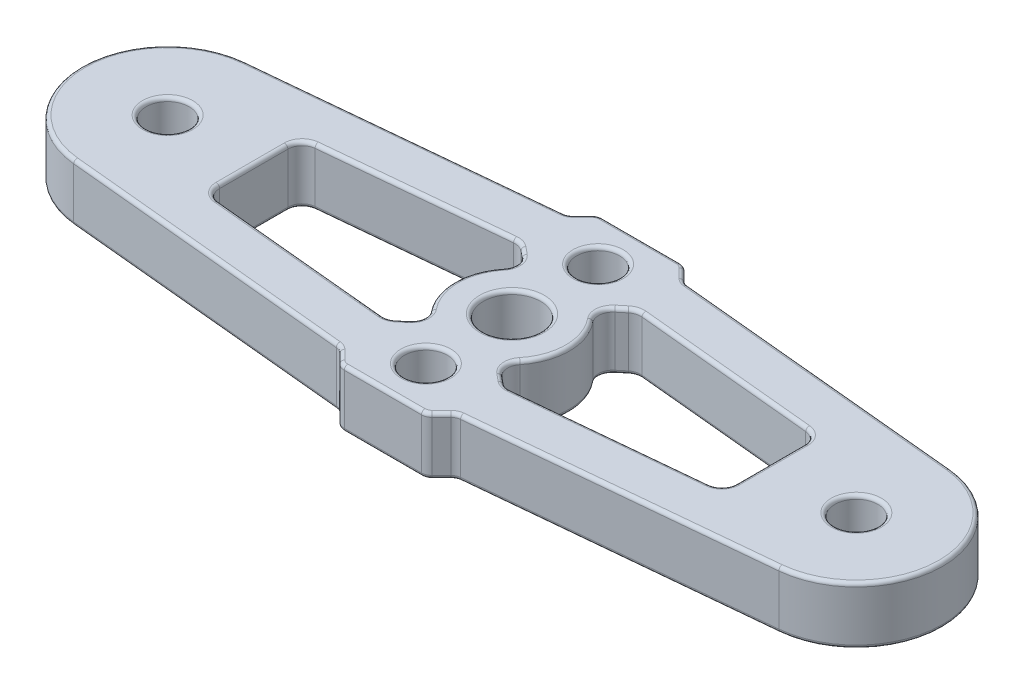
ISO-10303-21;
HEADER;
FILE_DESCRIPTION(('STEP AP214'),'2;1');
FILE_NAME('part.step','',(''),(''),'','','');
FILE_SCHEMA(('AUTOMOTIVE_DESIGN { 1 0 10303 214 1 1 1 1 }'));
ENDSEC;
DATA;
#1=APPLICATION_CONTEXT('core data for automotive mechanical design processes');
#2=APPLICATION_PROTOCOL_DEFINITION('international standard','automotive_design',2000,#1);
#3=PRODUCT_CONTEXT('',#1,'mechanical');
#4=PRODUCT('Part','Part','',(#3));
#5=PRODUCT_RELATED_PRODUCT_CATEGORY('part','',(#4));
#6=PRODUCT_DEFINITION_FORMATION('','',#4);
#7=PRODUCT_DEFINITION_CONTEXT('part definition',#1,'design');
#8=PRODUCT_DEFINITION('design','',#6,#7);
#9=PRODUCT_DEFINITION_SHAPE('','',#8);
#10=(LENGTH_UNIT() NAMED_UNIT(*) SI_UNIT(.MILLI.,.METRE.));
#11=(NAMED_UNIT(*) PLANE_ANGLE_UNIT() SI_UNIT($,.RADIAN.));
#12=(NAMED_UNIT(*) SI_UNIT($,.STERADIAN.) SOLID_ANGLE_UNIT());
#13=UNCERTAINTY_MEASURE_WITH_UNIT(LENGTH_MEASURE(1.E-05),#10,'distance_accuracy_value','');
#14=(GEOMETRIC_REPRESENTATION_CONTEXT(3) GLOBAL_UNCERTAINTY_ASSIGNED_CONTEXT((#13)) GLOBAL_UNIT_ASSIGNED_CONTEXT((#10,
#11,#12)) REPRESENTATION_CONTEXT('',''));
#15=CARTESIAN_POINT('',(0.,0.,0.));
#16=DIRECTION('',(0.,0.,1.));
#17=DIRECTION('',(1.,0.,0.));
#18=AXIS2_PLACEMENT_3D('',#15,#16,#17);
#19=CARTESIAN_POINT('',(0.,4.,0.));
#20=DIRECTION('',(0.,1.,0.));
#21=DIRECTION('',(0.,0.,1.));
#22=AXIS2_PLACEMENT_3D('',#19,#20,#21);
#23=PLANE('',#22);
#24=CARTESIAN_POINT('',(19.619208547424,4.,3.58892453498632));
#25=DIRECTION('',(0.,1.,0.));
#26=DIRECTION('',(0.,0.,1.));
#27=AXIS2_PLACEMENT_3D('',#24,#25,#26);
#28=CIRCLE('',#27,1.25);
#29=CARTESIAN_POINT('',(20.414695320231,4.,4.55313446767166));
#30=VERTEX_POINT('',#29);
#31=CARTESIAN_POINT('',(19.4999032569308,4.,4.83321800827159));
#32=VERTEX_POINT('',#31);
#33=EDGE_CURVE('E844',#30,#32,#28,.F.);
#34=ORIENTED_EDGE('',*,*,#33,.T.);
#35=DIRECTION('',(0.995434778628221,0.,0.0954442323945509));
#36=VECTOR('',#35,1.);
#37=CARTESIAN_POINT('',(-0.281560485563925,4.,2.93653259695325));
#38=LINE('',#37,#36);
#39=CARTESIAN_POINT('',(6.88069470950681,4.,3.62326362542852));
#40=VERTEX_POINT('',#39);
#41=EDGE_CURVE('E846',#32,#40,#38,.F.);
#42=ORIENTED_EDGE('',*,*,#41,.T.);
#43=CARTESIAN_POINT('',(7.,4.,2.37897015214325));
#44=DIRECTION('',(0.,1.,0.));
#45=DIRECTION('',(0.,0.,1.));
#46=AXIS2_PLACEMENT_3D('',#43,#44,#45);
#47=CIRCLE('',#46,1.25);
#48=CARTESIAN_POINT('',(5.75,4.,2.37897015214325));
#49=VERTEX_POINT('',#48);
#50=EDGE_CURVE('E842',#40,#49,#47,.F.);
#51=ORIENTED_EDGE('',*,*,#50,.T.);
#52=DIRECTION('',(0.,0.,1.));
#53=VECTOR('',#52,1.);
#54=CARTESIAN_POINT('',(5.75,4.,0.));
#55=LINE('',#54,#53);
#56=CARTESIAN_POINT('',(5.75,4.,-2.37897015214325));
#57=VERTEX_POINT('',#56);
#58=EDGE_CURVE('E840',#49,#57,#55,.F.);
#59=ORIENTED_EDGE('',*,*,#58,.T.);
#60=CARTESIAN_POINT('',(7.,4.,-2.37897015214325));
#61=DIRECTION('',(0.,1.,0.));
#62=DIRECTION('',(0.,0.,1.));
#63=AXIS2_PLACEMENT_3D('',#60,#61,#62);
#64=CIRCLE('',#63,1.25);
#65=CARTESIAN_POINT('',(6.88069470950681,4.,-3.62326362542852));
#66=VERTEX_POINT('',#65);
#67=EDGE_CURVE('E834',#57,#66,#64,.F.);
#68=ORIENTED_EDGE('',*,*,#67,.T.);
#69=DIRECTION('',(-0.995434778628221,0.,0.0954442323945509));
#70=VECTOR('',#69,1.);
#71=CARTESIAN_POINT('',(-0.281560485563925,4.,-2.93653259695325));
#72=LINE('',#71,#70);
#73=CARTESIAN_POINT('',(19.4999032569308,4.,-4.83321800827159));
#74=VERTEX_POINT('',#73);
#75=EDGE_CURVE('E832',#66,#74,#72,.F.);
#76=ORIENTED_EDGE('',*,*,#75,.T.);
#77=CARTESIAN_POINT('',(19.619208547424,4.,-3.58892453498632));
#78=DIRECTION('',(0.,1.,0.));
#79=DIRECTION('',(0.,0.,1.));
#80=AXIS2_PLACEMENT_3D('',#77,#78,#79);
#81=CIRCLE('',#80,1.25);
#82=CARTESIAN_POINT('',(20.414695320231,4.,-4.55313446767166));
#83=VERTEX_POINT('',#82);
#84=EDGE_CURVE('E825',#74,#83,#81,.F.);
#85=ORIENTED_EDGE('',*,*,#84,.T.);
#86=DIRECTION('',(-0.771367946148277,0.,-0.636389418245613));
#87=VECTOR('',#86,1.);
#88=CARTESIAN_POINT('',(10.5028679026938,4.,-12.7305316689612));
#89=LINE('',#88,#87);
#90=CARTESIAN_POINT('',(20.9262617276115,4.,-4.1310849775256));
#91=VERTEX_POINT('',#90);
#92=EDGE_CURVE('E823',#83,#91,#89,.F.);
#93=ORIENTED_EDGE('',*,*,#92,.T.);
#94=CARTESIAN_POINT('',(20.1307749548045,4.,-3.16687504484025));
#95=DIRECTION('',(0.,1.,0.));
#96=DIRECTION('',(0.,0.,1.));
#97=AXIS2_PLACEMENT_3D('',#94,#95,#96);
#98=CIRCLE('',#97,1.25);
#99=CARTESIAN_POINT('',(21.0980812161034,4.,-2.37515628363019));
#100=VERTEX_POINT('',#99);
#101=EDGE_CURVE('E827',#91,#100,#98,.F.);
#102=ORIENTED_EDGE('',*,*,#101,.T.);
#103=CARTESIAN_POINT('',(24.,4.,0.));
#104=DIRECTION('',(0.,1.,0.));
#105=DIRECTION('',(0.,0.,1.));
#106=AXIS2_PLACEMENT_3D('',#103,#104,#105);
#107=CIRCLE('',#106,3.75);
#108=CARTESIAN_POINT('',(21.0980812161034,4.,2.37515628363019));
#109=VERTEX_POINT('',#108);
#110=EDGE_CURVE('E830',#100,#109,#107,.T.);
#111=ORIENTED_EDGE('',*,*,#110,.T.);
#112=CARTESIAN_POINT('',(20.1307749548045,4.,3.16687504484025));
#113=DIRECTION('',(0.,1.,0.));
#114=DIRECTION('',(0.,0.,1.));
#115=AXIS2_PLACEMENT_3D('',#112,#113,#114);
#116=CIRCLE('',#115,1.25);
#117=CARTESIAN_POINT('',(20.9262617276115,4.,4.13108497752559));
#118=VERTEX_POINT('',#117);
#119=EDGE_CURVE('E836',#109,#118,#116,.F.);
#120=ORIENTED_EDGE('',*,*,#119,.T.);
#121=DIRECTION('',(0.771367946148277,0.,-0.636389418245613));
#122=VECTOR('',#121,1.);
#123=CARTESIAN_POINT('',(10.5028679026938,4.,12.7305316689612));
#124=LINE('',#123,#122);
#125=EDGE_CURVE('E838',#118,#30,#124,.F.);
#126=ORIENTED_EDGE('',*,*,#125,.T.);
#127=EDGE_LOOP('',(#34,#42,#51,#59,#68,#76,#85,#93,#102,#111,#120,#126));
#128=FACE_BOUND('',#127,.T.);
#129=CARTESIAN_POINT('',(28.380791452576,4.,-3.58892453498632));
#130=DIRECTION('',(0.,1.,0.));
#131=DIRECTION('',(0.,0.,1.));
#132=AXIS2_PLACEMENT_3D('',#129,#130,#131);
#133=CIRCLE('',#132,1.25);
#134=CARTESIAN_POINT('',(27.585304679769,4.,-4.55313446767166));
#135=VERTEX_POINT('',#134);
#136=CARTESIAN_POINT('',(28.5000967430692,4.,-4.83321800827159));
#137=VERTEX_POINT('',#136);
#138=EDGE_CURVE('E819',#135,#137,#133,.F.);
#139=ORIENTED_EDGE('',*,*,#138,.T.);
#140=DIRECTION('',(-0.995434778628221,0.,-0.0954442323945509));
#141=VECTOR('',#140,1.);
#142=CARTESIAN_POINT('',(0.718821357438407,4.,-7.49694099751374));
#143=LINE('',#142,#141);
#144=CARTESIAN_POINT('',(41.1193052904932,4.,-3.62326362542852));
#145=VERTEX_POINT('',#144);
#146=EDGE_CURVE('E821',#137,#145,#143,.F.);
#147=ORIENTED_EDGE('',*,*,#146,.T.);
#148=CARTESIAN_POINT('',(41.,4.,-2.37897015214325));
#149=DIRECTION('',(0.,1.,0.));
#150=DIRECTION('',(0.,0.,1.));
#151=AXIS2_PLACEMENT_3D('',#148,#149,#150);
#152=CIRCLE('',#151,1.25);
#153=CARTESIAN_POINT('',(42.25,4.,-2.37897015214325));
#154=VERTEX_POINT('',#153);
#155=EDGE_CURVE('E817',#145,#154,#152,.F.);
#156=ORIENTED_EDGE('',*,*,#155,.T.);
#157=DIRECTION('',(0.,0.,-1.));
#158=VECTOR('',#157,1.);
#159=CARTESIAN_POINT('',(42.25,4.,0.));
#160=LINE('',#159,#158);
#161=CARTESIAN_POINT('',(42.25,4.,2.37897015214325));
#162=VERTEX_POINT('',#161);
#163=EDGE_CURVE('E815',#154,#162,#160,.F.);
#164=ORIENTED_EDGE('',*,*,#163,.T.);
#165=CARTESIAN_POINT('',(41.,4.,2.37897015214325));
#166=DIRECTION('',(0.,1.,0.));
#167=DIRECTION('',(0.,0.,1.));
#168=AXIS2_PLACEMENT_3D('',#165,#166,#167);
#169=CIRCLE('',#168,1.25);
#170=CARTESIAN_POINT('',(41.1193052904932,4.,3.62326362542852));
#171=VERTEX_POINT('',#170);
#172=EDGE_CURVE('E809',#162,#171,#169,.F.);
#173=ORIENTED_EDGE('',*,*,#172,.T.);
#174=DIRECTION('',(0.995434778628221,0.,-0.0954442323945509));
#175=VECTOR('',#174,1.);
#176=CARTESIAN_POINT('',(0.718821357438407,4.,7.49694099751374));
#177=LINE('',#176,#175);
#178=CARTESIAN_POINT('',(28.5000967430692,4.,4.83321800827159));
#179=VERTEX_POINT('',#178);
#180=EDGE_CURVE('E807',#171,#179,#177,.F.);
#181=ORIENTED_EDGE('',*,*,#180,.T.);
#182=CARTESIAN_POINT('',(28.380791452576,4.,3.58892453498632));
#183=DIRECTION('',(0.,1.,0.));
#184=DIRECTION('',(0.,0.,1.));
#185=AXIS2_PLACEMENT_3D('',#182,#183,#184);
#186=CIRCLE('',#185,1.25);
#187=CARTESIAN_POINT('',(27.585304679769,4.,4.55313446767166));
#188=VERTEX_POINT('',#187);
#189=EDGE_CURVE('E800',#179,#188,#186,.F.);
#190=ORIENTED_EDGE('',*,*,#189,.T.);
#191=DIRECTION('',(0.771367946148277,0.,0.636389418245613));
#192=VECTOR('',#191,1.);
#193=CARTESIAN_POINT('',(8.93672369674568,4.,-10.8322074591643));
#194=LINE('',#193,#192);
#195=CARTESIAN_POINT('',(27.0737382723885,4.,4.1310849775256));
#196=VERTEX_POINT('',#195);
#197=EDGE_CURVE('E798',#188,#196,#194,.F.);
#198=ORIENTED_EDGE('',*,*,#197,.T.);
#199=CARTESIAN_POINT('',(27.8692250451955,4.,3.16687504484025));
#200=DIRECTION('',(0.,1.,0.));
#201=DIRECTION('',(0.,0.,1.));
#202=AXIS2_PLACEMENT_3D('',#199,#200,#201);
#203=CIRCLE('',#202,1.25);
#204=CARTESIAN_POINT('',(26.9019187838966,4.,2.37515628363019));
#205=VERTEX_POINT('',#204);
#206=EDGE_CURVE('E802',#196,#205,#203,.F.);
#207=ORIENTED_EDGE('',*,*,#206,.T.);
#208=CARTESIAN_POINT('',(24.,4.,0.));
#209=DIRECTION('',(0.,1.,0.));
#210=DIRECTION('',(0.,0.,1.));
#211=AXIS2_PLACEMENT_3D('',#208,#209,#210);
#212=CIRCLE('',#211,3.75);
#213=CARTESIAN_POINT('',(26.9019187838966,4.,-2.37515628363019));
#214=VERTEX_POINT('',#213);
#215=EDGE_CURVE('E805',#205,#214,#212,.T.);
#216=ORIENTED_EDGE('',*,*,#215,.T.);
#217=CARTESIAN_POINT('',(27.8692250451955,4.,-3.16687504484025));
#218=DIRECTION('',(0.,1.,0.));
#219=DIRECTION('',(0.,0.,1.));
#220=AXIS2_PLACEMENT_3D('',#217,#218,#219);
#221=CIRCLE('',#220,1.25);
#222=CARTESIAN_POINT('',(27.0737382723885,4.,-4.13108497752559));
#223=VERTEX_POINT('',#222);
#224=EDGE_CURVE('E811',#214,#223,#221,.F.);
#225=ORIENTED_EDGE('',*,*,#224,.T.);
#226=DIRECTION('',(-0.771367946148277,0.,0.636389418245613));
#227=VECTOR('',#226,1.);
#228=CARTESIAN_POINT('',(8.93672369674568,4.,10.8322074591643));
#229=LINE('',#228,#227);
#230=EDGE_CURVE('E813',#223,#135,#229,.F.);
#231=ORIENTED_EDGE('',*,*,#230,.T.);
#232=EDGE_LOOP('',(#139,#147,#156,#164,#173,#181,#190,#198,#207,#216,#225,#231));
#233=FACE_BOUND('',#232,.T.);
#234=CARTESIAN_POINT('',(24.,4.,6.));
#235=DIRECTION('',(0.,1.,0.));
#236=DIRECTION('',(0.,0.,1.));
#237=AXIS2_PLACEMENT_3D('',#234,#235,#236);
#238=CIRCLE('',#237,1.75);
#239=CARTESIAN_POINT('',(24.,4.,7.75));
#240=VERTEX_POINT('',#239);
#241=EDGE_CURVE('E795',#240,#240,#238,.F.);
#242=ORIENTED_EDGE('',*,*,#241,.T.);
#243=EDGE_LOOP('',(#242));
#244=FACE_BOUND('',#243,.T.);
#245=CARTESIAN_POINT('',(24.,4.,-6.));
#246=DIRECTION('',(0.,1.,0.));
#247=DIRECTION('',(0.,0.,1.));
#248=AXIS2_PLACEMENT_3D('',#245,#246,#247);
#249=CIRCLE('',#248,1.75);
#250=CARTESIAN_POINT('',(24.,4.,-4.25));
#251=VERTEX_POINT('',#250);
#252=EDGE_CURVE('E792',#251,#251,#249,.F.);
#253=ORIENTED_EDGE('',*,*,#252,.T.);
#254=EDGE_LOOP('',(#253));
#255=FACE_BOUND('',#254,.T.);
#256=CARTESIAN_POINT('',(48.,4.,0.));
#257=DIRECTION('',(0.,1.,0.));
#258=DIRECTION('',(0.,0.,1.));
#259=AXIS2_PLACEMENT_3D('',#256,#257,#258);
#260=CIRCLE('',#259,1.75);
#261=CARTESIAN_POINT('',(48.,4.,1.75));
#262=VERTEX_POINT('',#261);
#263=EDGE_CURVE('E789',#262,#262,#260,.F.);
#264=ORIENTED_EDGE('',*,*,#263,.T.);
#265=EDGE_LOOP('',(#264));
#266=FACE_BOUND('',#265,.T.);
#267=CARTESIAN_POINT('',(24.,4.,0.));
#268=DIRECTION('',(0.,1.,0.));
#269=DIRECTION('',(0.,0.,1.));
#270=AXIS2_PLACEMENT_3D('',#267,#268,#269);
#271=CIRCLE('',#270,2.25);
#272=CARTESIAN_POINT('',(24.,4.,2.25));
#273=VERTEX_POINT('',#272);
#274=EDGE_CURVE('E786',#273,#273,#271,.F.);
#275=ORIENTED_EDGE('',*,*,#274,.T.);
#276=EDGE_LOOP('',(#275));
#277=FACE_BOUND('',#276,.T.);
#278=CARTESIAN_POINT('',(0.,4.,0.));
#279=DIRECTION('',(0.,1.,0.));
#280=DIRECTION('',(0.,0.,1.));
#281=AXIS2_PLACEMENT_3D('',#278,#279,#280);
#282=CIRCLE('',#281,1.75);
#283=CARTESIAN_POINT('',(0.,4.,1.75));
#284=VERTEX_POINT('',#283);
#285=EDGE_CURVE('E783',#284,#284,#282,.F.);
#286=ORIENTED_EDGE('',*,*,#285,.T.);
#287=EDGE_LOOP('',(#286));
#288=FACE_BOUND('',#287,.T.);
#289=CARTESIAN_POINT('',(28.4004615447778,4.,8.660198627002));
#290=DIRECTION('',(0.,1.,0.));
#291=DIRECTION('',(0.,0.,1.));
#292=AXIS2_PLACEMENT_3D('',#289,#290,#291);
#293=CIRCLE('',#292,1.);
#294=CARTESIAN_POINT('',(27.6933547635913,4.,7.95309184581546));
#295=VERTEX_POINT('',#294);
#296=CARTESIAN_POINT('',(28.3050173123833,4.,7.66476384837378));
#297=VERTEX_POINT('',#296);
#298=EDGE_CURVE('E773',#295,#297,#293,.F.);
#299=ORIENTED_EDGE('',*,*,#298,.T.);
#300=DIRECTION('',(0.995434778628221,0.,-0.0954442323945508));
#301=VECTOR('',#300,1.);
#302=CARTESIAN_POINT('',(48.5488043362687,4.,5.72374997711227));
#303=LINE('',#302,#301);
#304=CARTESIAN_POINT('',(48.5488043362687,4.,5.72374997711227));
#305=VERTEX_POINT('',#304);
#306=EDGE_CURVE('E781',#297,#305,#303,.T.);
#307=ORIENTED_EDGE('',*,*,#306,.T.);
#308=CARTESIAN_POINT('',(48.,4.,0.));
#309=DIRECTION('',(0.,1.,0.));
#310=DIRECTION('',(0.,0.,1.));
#311=AXIS2_PLACEMENT_3D('',#308,#309,#310);
#312=CIRCLE('',#311,5.75);
#313=CARTESIAN_POINT('',(48.5488043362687,4.,-5.72374997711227));
#314=VERTEX_POINT('',#313);
#315=EDGE_CURVE('E779',#305,#314,#312,.T.);
#316=ORIENTED_EDGE('',*,*,#315,.T.);
#317=DIRECTION('',(-0.995434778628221,0.,-0.0954442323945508));
#318=VECTOR('',#317,1.);
#319=CARTESIAN_POINT('',(28.3050173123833,4.,-7.66476384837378));
#320=LINE('',#319,#318);
#321=CARTESIAN_POINT('',(28.3050173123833,4.,-7.66476384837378));
#322=VERTEX_POINT('',#321);
#323=EDGE_CURVE('E777',#314,#322,#320,.T.);
#324=ORIENTED_EDGE('',*,*,#323,.T.);
#325=CARTESIAN_POINT('',(28.4004615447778,4.,-8.660198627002));
#326=DIRECTION('',(0.,1.,0.));
#327=DIRECTION('',(0.,0.,1.));
#328=AXIS2_PLACEMENT_3D('',#325,#326,#327);
#329=CIRCLE('',#328,1.);
#330=CARTESIAN_POINT('',(27.6933547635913,4.,-7.95309184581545));
#331=VERTEX_POINT('',#330);
#332=EDGE_CURVE('E775',#322,#331,#329,.F.);
#333=ORIENTED_EDGE('',*,*,#332,.T.);
#334=DIRECTION('',(-0.707106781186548,0.,-0.707106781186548));
#335=VECTOR('',#334,1.);
#336=CARTESIAN_POINT('',(27.0428932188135,4.,-8.60355339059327));
#337=LINE('',#336,#335);
#338=CARTESIAN_POINT('',(27.0428932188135,4.,-8.60355339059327));
#339=VERTEX_POINT('',#338);
#340=EDGE_CURVE('E769',#331,#339,#337,.T.);
#341=ORIENTED_EDGE('',*,*,#340,.T.);
#342=CARTESIAN_POINT('',(26.6893398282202,4.,-8.25));
#343=DIRECTION('',(0.,1.,0.));
#344=DIRECTION('',(0.,0.,1.));
#345=AXIS2_PLACEMENT_3D('',#342,#343,#344);
#346=CIRCLE('',#345,0.5);
#347=CARTESIAN_POINT('',(26.6893398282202,4.,-8.75));
#348=VERTEX_POINT('',#347);
#349=EDGE_CURVE('E767',#339,#348,#346,.T.);
#350=ORIENTED_EDGE('',*,*,#349,.T.);
#351=DIRECTION('',(-1.,0.,0.));
#352=VECTOR('',#351,1.);
#353=CARTESIAN_POINT('',(21.3106601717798,4.,-8.75));
#354=LINE('',#353,#352);
#355=CARTESIAN_POINT('',(21.3106601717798,4.,-8.75));
#356=VERTEX_POINT('',#355);
#357=EDGE_CURVE('E761',#348,#356,#354,.T.);
#358=ORIENTED_EDGE('',*,*,#357,.T.);
#359=CARTESIAN_POINT('',(21.3106601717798,4.,-8.25));
#360=DIRECTION('',(0.,1.,0.));
#361=DIRECTION('',(0.,0.,1.));
#362=AXIS2_PLACEMENT_3D('',#359,#360,#361);
#363=CIRCLE('',#362,0.5);
#364=CARTESIAN_POINT('',(20.9571067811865,4.,-8.60355339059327));
#365=VERTEX_POINT('',#364);
#366=EDGE_CURVE('E759',#356,#365,#363,.T.);
#367=ORIENTED_EDGE('',*,*,#366,.T.);
#368=DIRECTION('',(-0.707106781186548,0.,0.707106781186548));
#369=VECTOR('',#368,1.);
#370=CARTESIAN_POINT('',(20.3066452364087,4.,-7.95309184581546));
#371=LINE('',#370,#369);
#372=CARTESIAN_POINT('',(20.3066452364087,4.,-7.95309184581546));
#373=VERTEX_POINT('',#372);
#374=EDGE_CURVE('E755',#365,#373,#371,.T.);
#375=ORIENTED_EDGE('',*,*,#374,.T.);
#376=CARTESIAN_POINT('',(19.5995384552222,4.,-8.660198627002));
#377=DIRECTION('',(0.,1.,0.));
#378=DIRECTION('',(0.,0.,1.));
#379=AXIS2_PLACEMENT_3D('',#376,#377,#378);
#380=CIRCLE('',#379,1.);
#381=CARTESIAN_POINT('',(19.6949826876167,4.,-7.66476384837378));
#382=VERTEX_POINT('',#381);
#383=EDGE_CURVE('E750',#373,#382,#380,.F.);
#384=ORIENTED_EDGE('',*,*,#383,.T.);
#385=DIRECTION('',(-0.995434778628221,0.,0.0954442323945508));
#386=VECTOR('',#385,1.);
#387=CARTESIAN_POINT('',(-0.548804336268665,4.,-5.72374997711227));
#388=LINE('',#387,#386);
#389=CARTESIAN_POINT('',(-0.548804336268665,4.,-5.72374997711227));
#390=VERTEX_POINT('',#389);
#391=EDGE_CURVE('E746',#382,#390,#388,.T.);
#392=ORIENTED_EDGE('',*,*,#391,.T.);
#393=CARTESIAN_POINT('',(0.,4.,0.));
#394=DIRECTION('',(0.,1.,0.));
#395=DIRECTION('',(0.,0.,1.));
#396=AXIS2_PLACEMENT_3D('',#393,#394,#395);
#397=CIRCLE('',#396,5.75);
#398=CARTESIAN_POINT('',(-0.548804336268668,4.,5.72374997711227));
#399=VERTEX_POINT('',#398);
#400=EDGE_CURVE('E744',#390,#399,#397,.T.);
#401=ORIENTED_EDGE('',*,*,#400,.T.);
#402=DIRECTION('',(0.995434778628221,0.,0.0954442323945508));
#403=VECTOR('',#402,1.);
#404=CARTESIAN_POINT('',(19.6949826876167,4.,7.66476384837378));
#405=LINE('',#404,#403);
#406=CARTESIAN_POINT('',(19.6949826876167,4.,7.66476384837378));
#407=VERTEX_POINT('',#406);
#408=EDGE_CURVE('E742',#399,#407,#405,.T.);
#409=ORIENTED_EDGE('',*,*,#408,.T.);
#410=CARTESIAN_POINT('',(19.5995384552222,4.,8.660198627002));
#411=DIRECTION('',(0.,1.,0.));
#412=DIRECTION('',(0.,0.,1.));
#413=AXIS2_PLACEMENT_3D('',#410,#411,#412);
#414=CIRCLE('',#413,1.);
#415=CARTESIAN_POINT('',(20.3066452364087,4.,7.95309184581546));
#416=VERTEX_POINT('',#415);
#417=EDGE_CURVE('E748',#407,#416,#414,.F.);
#418=ORIENTED_EDGE('',*,*,#417,.T.);
#419=DIRECTION('',(0.707106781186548,0.,0.707106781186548));
#420=VECTOR('',#419,1.);
#421=CARTESIAN_POINT('',(20.9571067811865,4.,8.60355339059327));
#422=LINE('',#421,#420);
#423=CARTESIAN_POINT('',(20.9571067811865,4.,8.60355339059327));
#424=VERTEX_POINT('',#423);
#425=EDGE_CURVE('E753',#416,#424,#422,.T.);
#426=ORIENTED_EDGE('',*,*,#425,.T.);
#427=CARTESIAN_POINT('',(21.3106601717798,4.,8.25));
#428=DIRECTION('',(0.,1.,0.));
#429=DIRECTION('',(0.,0.,1.));
#430=AXIS2_PLACEMENT_3D('',#427,#428,#429);
#431=CIRCLE('',#430,0.5);
#432=CARTESIAN_POINT('',(21.3106601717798,4.,8.75));
#433=VERTEX_POINT('',#432);
#434=EDGE_CURVE('E757',#424,#433,#431,.T.);
#435=ORIENTED_EDGE('',*,*,#434,.T.);
#436=DIRECTION('',(1.,0.,0.));
#437=VECTOR('',#436,1.);
#438=CARTESIAN_POINT('',(26.6893398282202,4.,8.75));
#439=LINE('',#438,#437);
#440=CARTESIAN_POINT('',(26.6893398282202,4.,8.75));
#441=VERTEX_POINT('',#440);
#442=EDGE_CURVE('E763',#433,#441,#439,.T.);
#443=ORIENTED_EDGE('',*,*,#442,.T.);
#444=CARTESIAN_POINT('',(26.6893398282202,4.,8.25));
#445=DIRECTION('',(0.,1.,0.));
#446=DIRECTION('',(0.,0.,1.));
#447=AXIS2_PLACEMENT_3D('',#444,#445,#446);
#448=CIRCLE('',#447,0.5);
#449=CARTESIAN_POINT('',(27.0428932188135,4.,8.60355339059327));
#450=VERTEX_POINT('',#449);
#451=EDGE_CURVE('E765',#441,#450,#448,.T.);
#452=ORIENTED_EDGE('',*,*,#451,.T.);
#453=DIRECTION('',(0.707106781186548,0.,-0.707106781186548));
#454=VECTOR('',#453,1.);
#455=CARTESIAN_POINT('',(27.6933547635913,4.,7.95309184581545));
#456=LINE('',#455,#454);
#457=EDGE_CURVE('E771',#450,#295,#456,.T.);
#458=ORIENTED_EDGE('',*,*,#457,.T.);
#459=EDGE_LOOP('',(#299,#307,#316,#324,#333,#341,#350,#358,#367,#375,#384,#392,#401,#409,#418,
#426,#435,#443,#452,#458));
#460=FACE_BOUND('',#459,.T.);
#461=ADVANCED_FACE('F36',(#128,#233,#244,#255,#266,#277,#288,#460),#23,.T.);
#462=CARTESIAN_POINT('',(0.,0.,0.));
#463=DIRECTION('',(0.,1.,0.));
#464=DIRECTION('',(0.,0.,1.));
#465=AXIS2_PLACEMENT_3D('',#462,#463,#464);
#466=PLANE('',#465);
#467=CARTESIAN_POINT('',(7.,0.,2.37897015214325));
#468=DIRECTION('',(0.,1.,0.));
#469=DIRECTION('',(0.,0.,1.));
#470=AXIS2_PLACEMENT_3D('',#467,#468,#469);
#471=CIRCLE('',#470,1.25);
#472=CARTESIAN_POINT('',(5.75,0.,2.37897015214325));
#473=VERTEX_POINT('',#472);
#474=CARTESIAN_POINT('',(6.88069470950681,0.,3.62326362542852));
#475=VERTEX_POINT('',#474);
#476=EDGE_CURVE('E710',#473,#475,#471,.T.);
#477=ORIENTED_EDGE('',*,*,#476,.T.);
#478=DIRECTION('',(0.995434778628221,0.,0.0954442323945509));
#479=VECTOR('',#478,1.);
#480=CARTESIAN_POINT('',(19.4999032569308,0.,4.83321800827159));
#481=LINE('',#480,#479);
#482=CARTESIAN_POINT('',(19.4999032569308,0.,4.83321800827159));
#483=VERTEX_POINT('',#482);
#484=EDGE_CURVE('E714',#475,#483,#481,.T.);
#485=ORIENTED_EDGE('',*,*,#484,.T.);
#486=CARTESIAN_POINT('',(19.619208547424,0.,3.58892453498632));
#487=DIRECTION('',(0.,1.,0.));
#488=DIRECTION('',(0.,0.,1.));
#489=AXIS2_PLACEMENT_3D('',#486,#487,#488);
#490=CIRCLE('',#489,1.25);
#491=CARTESIAN_POINT('',(20.414695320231,0.,4.55313446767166));
#492=VERTEX_POINT('',#491);
#493=EDGE_CURVE('E712',#483,#492,#490,.T.);
#494=ORIENTED_EDGE('',*,*,#493,.T.);
#495=DIRECTION('',(0.771367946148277,0.,-0.636389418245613));
#496=VECTOR('',#495,1.);
#497=CARTESIAN_POINT('',(20.9262617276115,0.,4.13108497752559));
#498=LINE('',#497,#496);
#499=CARTESIAN_POINT('',(20.9262617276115,0.,4.13108497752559));
#500=VERTEX_POINT('',#499);
#501=EDGE_CURVE('E706',#492,#500,#498,.T.);
#502=ORIENTED_EDGE('',*,*,#501,.T.);
#503=CARTESIAN_POINT('',(20.1307749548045,0.,3.16687504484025));
#504=DIRECTION('',(0.,1.,0.));
#505=DIRECTION('',(0.,0.,1.));
#506=AXIS2_PLACEMENT_3D('',#503,#504,#505);
#507=CIRCLE('',#506,1.25);
#508=CARTESIAN_POINT('',(21.0980812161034,0.,2.37515628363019));
#509=VERTEX_POINT('',#508);
#510=EDGE_CURVE('E704',#500,#509,#507,.T.);
#511=ORIENTED_EDGE('',*,*,#510,.T.);
#512=CARTESIAN_POINT('',(24.,0.,0.));
#513=DIRECTION('',(0.,1.,0.));
#514=DIRECTION('',(0.,0.,1.));
#515=AXIS2_PLACEMENT_3D('',#512,#513,#514);
#516=CIRCLE('',#515,3.75);
#517=CARTESIAN_POINT('',(21.0980812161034,0.,-2.37515628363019));
#518=VERTEX_POINT('',#517);
#519=EDGE_CURVE('E698',#509,#518,#516,.F.);
#520=ORIENTED_EDGE('',*,*,#519,.T.);
#521=CARTESIAN_POINT('',(20.1307749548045,0.,-3.16687504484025));
#522=DIRECTION('',(0.,1.,0.));
#523=DIRECTION('',(0.,0.,1.));
#524=AXIS2_PLACEMENT_3D('',#521,#522,#523);
#525=CIRCLE('',#524,1.25);
#526=CARTESIAN_POINT('',(20.9262617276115,0.,-4.13108497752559));
#527=VERTEX_POINT('',#526);
#528=EDGE_CURVE('E695',#518,#527,#525,.T.);
#529=ORIENTED_EDGE('',*,*,#528,.T.);
#530=DIRECTION('',(-0.771367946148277,0.,-0.636389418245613));
#531=VECTOR('',#530,1.);
#532=CARTESIAN_POINT('',(20.414695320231,0.,-4.55313446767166));
#533=LINE('',#532,#531);
#534=CARTESIAN_POINT('',(20.414695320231,0.,-4.55313446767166));
#535=VERTEX_POINT('',#534);
#536=EDGE_CURVE('E691',#527,#535,#533,.T.);
#537=ORIENTED_EDGE('',*,*,#536,.T.);
#538=CARTESIAN_POINT('',(19.619208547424,0.,-3.58892453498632));
#539=DIRECTION('',(0.,1.,0.));
#540=DIRECTION('',(0.,0.,1.));
#541=AXIS2_PLACEMENT_3D('',#538,#539,#540);
#542=CIRCLE('',#541,1.25);
#543=CARTESIAN_POINT('',(19.4999032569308,0.,-4.83321800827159));
#544=VERTEX_POINT('',#543);
#545=EDGE_CURVE('E693',#535,#544,#542,.T.);
#546=ORIENTED_EDGE('',*,*,#545,.T.);
#547=DIRECTION('',(-0.995434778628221,0.,0.0954442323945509));
#548=VECTOR('',#547,1.);
#549=CARTESIAN_POINT('',(6.88069470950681,0.,-3.62326362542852));
#550=LINE('',#549,#548);
#551=CARTESIAN_POINT('',(6.88069470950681,0.,-3.62326362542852));
#552=VERTEX_POINT('',#551);
#553=EDGE_CURVE('E700',#544,#552,#550,.T.);
#554=ORIENTED_EDGE('',*,*,#553,.T.);
#555=CARTESIAN_POINT('',(7.,0.,-2.37897015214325));
#556=DIRECTION('',(0.,1.,0.));
#557=DIRECTION('',(0.,0.,1.));
#558=AXIS2_PLACEMENT_3D('',#555,#556,#557);
#559=CIRCLE('',#558,1.25);
#560=CARTESIAN_POINT('',(5.75,0.,-2.37897015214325));
#561=VERTEX_POINT('',#560);
#562=EDGE_CURVE('E702',#552,#561,#559,.T.);
#563=ORIENTED_EDGE('',*,*,#562,.T.);
#564=DIRECTION('',(0.,0.,1.));
#565=VECTOR('',#564,1.);
#566=CARTESIAN_POINT('',(5.75,0.,2.37897015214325));
#567=LINE('',#566,#565);
#568=EDGE_CURVE('E708',#561,#473,#567,.T.);
#569=ORIENTED_EDGE('',*,*,#568,.T.);
#570=EDGE_LOOP('',(#477,#485,#494,#502,#511,#520,#529,#537,#546,#554,#563,#569));
#571=FACE_BOUND('',#570,.T.);
#572=CARTESIAN_POINT('',(41.,0.,-2.37897015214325));
#573=DIRECTION('',(0.,1.,0.));
#574=DIRECTION('',(0.,0.,1.));
#575=AXIS2_PLACEMENT_3D('',#572,#573,#574);
#576=CIRCLE('',#575,1.25);
#577=CARTESIAN_POINT('',(42.25,0.,-2.37897015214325));
#578=VERTEX_POINT('',#577);
#579=CARTESIAN_POINT('',(41.1193052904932,0.,-3.62326362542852));
#580=VERTEX_POINT('',#579);
#581=EDGE_CURVE('E685',#578,#580,#576,.T.);
#582=ORIENTED_EDGE('',*,*,#581,.T.);
#583=DIRECTION('',(-0.995434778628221,0.,-0.0954442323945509));
#584=VECTOR('',#583,1.);
#585=CARTESIAN_POINT('',(28.5000967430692,0.,-4.83321800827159));
#586=LINE('',#585,#584);
#587=CARTESIAN_POINT('',(28.5000967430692,0.,-4.83321800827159));
#588=VERTEX_POINT('',#587);
#589=EDGE_CURVE('E689',#580,#588,#586,.T.);
#590=ORIENTED_EDGE('',*,*,#589,.T.);
#591=CARTESIAN_POINT('',(28.380791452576,0.,-3.58892453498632));
#592=DIRECTION('',(0.,1.,0.));
#593=DIRECTION('',(0.,0.,1.));
#594=AXIS2_PLACEMENT_3D('',#591,#592,#593);
#595=CIRCLE('',#594,1.25);
#596=CARTESIAN_POINT('',(27.585304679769,0.,-4.55313446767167));
#597=VERTEX_POINT('',#596);
#598=EDGE_CURVE('E687',#588,#597,#595,.T.);
#599=ORIENTED_EDGE('',*,*,#598,.T.);
#600=DIRECTION('',(-0.771367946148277,0.,0.636389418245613));
#601=VECTOR('',#600,1.);
#602=CARTESIAN_POINT('',(27.0737382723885,0.,-4.1310849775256));
#603=LINE('',#602,#601);
#604=CARTESIAN_POINT('',(27.0737382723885,0.,-4.13108497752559));
#605=VERTEX_POINT('',#604);
#606=EDGE_CURVE('E681',#597,#605,#603,.T.);
#607=ORIENTED_EDGE('',*,*,#606,.T.);
#608=CARTESIAN_POINT('',(27.8692250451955,0.,-3.16687504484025));
#609=DIRECTION('',(0.,1.,0.));
#610=DIRECTION('',(0.,0.,1.));
#611=AXIS2_PLACEMENT_3D('',#608,#609,#610);
#612=CIRCLE('',#611,1.25);
#613=CARTESIAN_POINT('',(26.9019187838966,0.,-2.37515628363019));
#614=VERTEX_POINT('',#613);
#615=EDGE_CURVE('E679',#605,#614,#612,.T.);
#616=ORIENTED_EDGE('',*,*,#615,.T.);
#617=CARTESIAN_POINT('',(24.,0.,0.));
#618=DIRECTION('',(0.,1.,0.));
#619=DIRECTION('',(0.,0.,1.));
#620=AXIS2_PLACEMENT_3D('',#617,#618,#619);
#621=CIRCLE('',#620,3.75);
#622=CARTESIAN_POINT('',(26.9019187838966,0.,2.37515628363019));
#623=VERTEX_POINT('',#622);
#624=EDGE_CURVE('E673',#614,#623,#621,.F.);
#625=ORIENTED_EDGE('',*,*,#624,.T.);
#626=CARTESIAN_POINT('',(27.8692250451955,0.,3.16687504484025));
#627=DIRECTION('',(0.,1.,0.));
#628=DIRECTION('',(0.,0.,1.));
#629=AXIS2_PLACEMENT_3D('',#626,#627,#628);
#630=CIRCLE('',#629,1.25);
#631=CARTESIAN_POINT('',(27.0737382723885,0.,4.1310849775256));
#632=VERTEX_POINT('',#631);
#633=EDGE_CURVE('E670',#623,#632,#630,.T.);
#634=ORIENTED_EDGE('',*,*,#633,.T.);
#635=DIRECTION('',(0.771367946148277,0.,0.636389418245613));
#636=VECTOR('',#635,1.);
#637=CARTESIAN_POINT('',(27.585304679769,0.,4.55313446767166));
#638=LINE('',#637,#636);
#639=CARTESIAN_POINT('',(27.585304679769,0.,4.55313446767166));
#640=VERTEX_POINT('',#639);
#641=EDGE_CURVE('E666',#632,#640,#638,.T.);
#642=ORIENTED_EDGE('',*,*,#641,.T.);
#643=CARTESIAN_POINT('',(28.380791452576,0.,3.58892453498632));
#644=DIRECTION('',(0.,1.,0.));
#645=DIRECTION('',(0.,0.,1.));
#646=AXIS2_PLACEMENT_3D('',#643,#644,#645);
#647=CIRCLE('',#646,1.25);
#648=CARTESIAN_POINT('',(28.5000967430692,0.,4.83321800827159));
#649=VERTEX_POINT('',#648);
#650=EDGE_CURVE('E668',#640,#649,#647,.T.);
#651=ORIENTED_EDGE('',*,*,#650,.T.);
#652=DIRECTION('',(0.995434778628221,0.,-0.0954442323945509));
#653=VECTOR('',#652,1.);
#654=CARTESIAN_POINT('',(41.1193052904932,0.,3.62326362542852));
#655=LINE('',#654,#653);
#656=CARTESIAN_POINT('',(41.1193052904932,0.,3.62326362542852));
#657=VERTEX_POINT('',#656);
#658=EDGE_CURVE('E675',#649,#657,#655,.T.);
#659=ORIENTED_EDGE('',*,*,#658,.T.);
#660=CARTESIAN_POINT('',(41.,0.,2.37897015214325));
#661=DIRECTION('',(0.,1.,0.));
#662=DIRECTION('',(0.,0.,1.));
#663=AXIS2_PLACEMENT_3D('',#660,#661,#662);
#664=CIRCLE('',#663,1.25);
#665=CARTESIAN_POINT('',(42.25,0.,2.37897015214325));
#666=VERTEX_POINT('',#665);
#667=EDGE_CURVE('E677',#657,#666,#664,.T.);
#668=ORIENTED_EDGE('',*,*,#667,.T.);
#669=DIRECTION('',(0.,0.,-1.));
#670=VECTOR('',#669,1.);
#671=CARTESIAN_POINT('',(42.25,0.,-2.37897015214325));
#672=LINE('',#671,#670);
#673=EDGE_CURVE('E683',#666,#578,#672,.T.);
#674=ORIENTED_EDGE('',*,*,#673,.T.);
#675=EDGE_LOOP('',(#582,#590,#599,#607,#616,#625,#634,#642,#651,#659,#668,#674));
#676=FACE_BOUND('',#675,.T.);
#677=CARTESIAN_POINT('',(24.,0.,6.));
#678=DIRECTION('',(0.,1.,0.));
#679=DIRECTION('',(0.,0.,1.));
#680=AXIS2_PLACEMENT_3D('',#677,#678,#679);
#681=CIRCLE('',#680,1.75);
#682=CARTESIAN_POINT('',(24.,0.,7.75));
#683=VERTEX_POINT('',#682);
#684=EDGE_CURVE('E663',#683,#683,#681,.T.);
#685=ORIENTED_EDGE('',*,*,#684,.T.);
#686=EDGE_LOOP('',(#685));
#687=FACE_BOUND('',#686,.T.);
#688=CARTESIAN_POINT('',(24.,0.,-6.));
#689=DIRECTION('',(0.,1.,0.));
#690=DIRECTION('',(0.,0.,1.));
#691=AXIS2_PLACEMENT_3D('',#688,#689,#690);
#692=CIRCLE('',#691,1.75);
#693=CARTESIAN_POINT('',(24.,0.,-4.25));
#694=VERTEX_POINT('',#693);
#695=EDGE_CURVE('E660',#694,#694,#692,.T.);
#696=ORIENTED_EDGE('',*,*,#695,.T.);
#697=EDGE_LOOP('',(#696));
#698=FACE_BOUND('',#697,.T.);
#699=CARTESIAN_POINT('',(48.,0.,0.));
#700=DIRECTION('',(0.,1.,0.));
#701=DIRECTION('',(0.,0.,1.));
#702=AXIS2_PLACEMENT_3D('',#699,#700,#701);
#703=CIRCLE('',#702,1.75);
#704=CARTESIAN_POINT('',(48.,0.,1.75));
#705=VERTEX_POINT('',#704);
#706=EDGE_CURVE('E657',#705,#705,#703,.T.);
#707=ORIENTED_EDGE('',*,*,#706,.T.);
#708=EDGE_LOOP('',(#707));
#709=FACE_BOUND('',#708,.T.);
#710=CARTESIAN_POINT('',(24.,0.,0.));
#711=DIRECTION('',(0.,1.,0.));
#712=DIRECTION('',(0.,0.,1.));
#713=AXIS2_PLACEMENT_3D('',#710,#711,#712);
#714=CIRCLE('',#713,2.25);
#715=CARTESIAN_POINT('',(24.,0.,2.25));
#716=VERTEX_POINT('',#715);
#717=EDGE_CURVE('E654',#716,#716,#714,.T.);
#718=ORIENTED_EDGE('',*,*,#717,.T.);
#719=EDGE_LOOP('',(#718));
#720=FACE_BOUND('',#719,.T.);
#721=CARTESIAN_POINT('',(0.,0.,0.));
#722=DIRECTION('',(0.,1.,0.));
#723=DIRECTION('',(0.,0.,1.));
#724=AXIS2_PLACEMENT_3D('',#721,#722,#723);
#725=CIRCLE('',#724,1.75);
#726=CARTESIAN_POINT('',(0.,0.,1.75));
#727=VERTEX_POINT('',#726);
#728=EDGE_CURVE('E651',#727,#727,#725,.T.);
#729=ORIENTED_EDGE('',*,*,#728,.T.);
#730=EDGE_LOOP('',(#729));
#731=FACE_BOUND('',#730,.T.);
#732=CARTESIAN_POINT('',(21.3106601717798,0.,8.25));
#733=DIRECTION('',(0.,1.,0.));
#734=DIRECTION('',(0.,0.,1.));
#735=AXIS2_PLACEMENT_3D('',#732,#733,#734);
#736=CIRCLE('',#735,0.5);
#737=CARTESIAN_POINT('',(21.3106601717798,0.,8.75));
#738=VERTEX_POINT('',#737);
#739=CARTESIAN_POINT('',(20.9571067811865,0.,8.60355339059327));
#740=VERTEX_POINT('',#739);
#741=EDGE_CURVE('E647',#738,#740,#736,.F.);
#742=ORIENTED_EDGE('',*,*,#741,.T.);
#743=DIRECTION('',(0.707106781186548,0.,0.707106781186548));
#744=VECTOR('',#743,1.);
#745=CARTESIAN_POINT('',(6.17677669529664,0.,-6.17677669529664));
#746=LINE('',#745,#744);
#747=CARTESIAN_POINT('',(20.3066452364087,0.,7.95309184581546));
#748=VERTEX_POINT('',#747);
#749=EDGE_CURVE('E649',#740,#748,#746,.F.);
#750=ORIENTED_EDGE('',*,*,#749,.T.);
#751=CARTESIAN_POINT('',(19.5995384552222,0.,8.660198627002));
#752=DIRECTION('',(0.,1.,0.));
#753=DIRECTION('',(0.,0.,1.));
#754=AXIS2_PLACEMENT_3D('',#751,#752,#753);
#755=CIRCLE('',#754,1.);
#756=CARTESIAN_POINT('',(19.6949826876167,0.,7.66476384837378));
#757=VERTEX_POINT('',#756);
#758=EDGE_CURVE('E645',#748,#757,#755,.T.);
#759=ORIENTED_EDGE('',*,*,#758,.T.);
#760=DIRECTION('',(0.995434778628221,0.,0.0954442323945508));
#761=VECTOR('',#760,1.);
#762=CARTESIAN_POINT('',(-0.548804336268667,0.,5.72374997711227));
#763=LINE('',#762,#761);
#764=CARTESIAN_POINT('',(-0.548804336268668,0.,5.72374997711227));
#765=VERTEX_POINT('',#764);
#766=EDGE_CURVE('E643',#757,#765,#763,.F.);
#767=ORIENTED_EDGE('',*,*,#766,.T.);
#768=CARTESIAN_POINT('',(0.,0.,0.));
#769=DIRECTION('',(0.,1.,0.));
#770=DIRECTION('',(0.,0.,1.));
#771=AXIS2_PLACEMENT_3D('',#768,#769,#770);
#772=CIRCLE('',#771,5.75);
#773=CARTESIAN_POINT('',(-0.548804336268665,0.,-5.72374997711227));
#774=VERTEX_POINT('',#773);
#775=EDGE_CURVE('E637',#765,#774,#772,.F.);
#776=ORIENTED_EDGE('',*,*,#775,.T.);
#777=DIRECTION('',(-0.995434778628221,0.,0.0954442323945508));
#778=VECTOR('',#777,1.);
#779=CARTESIAN_POINT('',(-0.548804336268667,0.,-5.72374997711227));
#780=LINE('',#779,#778);
#781=CARTESIAN_POINT('',(19.6949826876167,0.,-7.66476384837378));
#782=VERTEX_POINT('',#781);
#783=EDGE_CURVE('E631',#774,#782,#780,.F.);
#784=ORIENTED_EDGE('',*,*,#783,.T.);
#785=CARTESIAN_POINT('',(19.5995384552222,0.,-8.660198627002));
#786=DIRECTION('',(0.,1.,0.));
#787=DIRECTION('',(0.,0.,1.));
#788=AXIS2_PLACEMENT_3D('',#785,#786,#787);
#789=CIRCLE('',#788,1.);
#790=CARTESIAN_POINT('',(20.3066452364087,0.,-7.95309184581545));
#791=VERTEX_POINT('',#790);
#792=EDGE_CURVE('E621',#782,#791,#789,.T.);
#793=ORIENTED_EDGE('',*,*,#792,.T.);
#794=DIRECTION('',(-0.707106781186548,0.,0.707106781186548));
#795=VECTOR('',#794,1.);
#796=CARTESIAN_POINT('',(6.17677669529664,0.,6.17677669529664));
#797=LINE('',#796,#795);
#798=CARTESIAN_POINT('',(20.9571067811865,0.,-8.60355339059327));
#799=VERTEX_POINT('',#798);
#800=EDGE_CURVE('E591',#791,#799,#797,.F.);
#801=ORIENTED_EDGE('',*,*,#800,.T.);
#802=CARTESIAN_POINT('',(21.3106601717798,0.,-8.25));
#803=DIRECTION('',(0.,1.,0.));
#804=DIRECTION('',(0.,0.,1.));
#805=AXIS2_PLACEMENT_3D('',#802,#803,#804);
#806=CIRCLE('',#805,0.5);
#807=CARTESIAN_POINT('',(21.3106601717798,0.,-8.75));
#808=VERTEX_POINT('',#807);
#809=EDGE_CURVE('E583',#799,#808,#806,.F.);
#810=ORIENTED_EDGE('',*,*,#809,.T.);
#811=DIRECTION('',(-1.,0.,0.));
#812=VECTOR('',#811,1.);
#813=CARTESIAN_POINT('',(0.,0.,-8.75));
#814=LINE('',#813,#812);
#815=CARTESIAN_POINT('',(26.6893398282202,0.,-8.75));
#816=VERTEX_POINT('',#815);
#817=EDGE_CURVE('E588',#808,#816,#814,.F.);
#818=ORIENTED_EDGE('',*,*,#817,.T.);
#819=CARTESIAN_POINT('',(26.6893398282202,0.,-8.25));
#820=DIRECTION('',(0.,1.,0.));
#821=DIRECTION('',(0.,0.,1.));
#822=AXIS2_PLACEMENT_3D('',#819,#820,#821);
#823=CIRCLE('',#822,0.5);
#824=CARTESIAN_POINT('',(27.0428932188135,0.,-8.60355339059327));
#825=VERTEX_POINT('',#824);
#826=EDGE_CURVE('E595',#816,#825,#823,.F.);
#827=ORIENTED_EDGE('',*,*,#826,.T.);
#828=DIRECTION('',(-0.707106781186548,0.,-0.707106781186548));
#829=VECTOR('',#828,1.);
#830=CARTESIAN_POINT('',(17.8232233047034,0.,-17.8232233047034));
#831=LINE('',#830,#829);
#832=CARTESIAN_POINT('',(27.6933547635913,0.,-7.95309184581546));
#833=VERTEX_POINT('',#832);
#834=EDGE_CURVE('E618',#825,#833,#831,.F.);
#835=ORIENTED_EDGE('',*,*,#834,.T.);
#836=CARTESIAN_POINT('',(28.4004615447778,0.,-8.660198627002));
#837=DIRECTION('',(0.,1.,0.));
#838=DIRECTION('',(0.,0.,1.));
#839=AXIS2_PLACEMENT_3D('',#836,#837,#838);
#840=CIRCLE('',#839,1.);
#841=CARTESIAN_POINT('',(28.3050173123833,0.,-7.66476384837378));
#842=VERTEX_POINT('',#841);
#843=EDGE_CURVE('E623',#833,#842,#840,.T.);
#844=ORIENTED_EDGE('',*,*,#843,.T.);
#845=DIRECTION('',(-0.995434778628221,0.,-0.0954442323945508));
#846=VECTOR('',#845,1.);
#847=CARTESIAN_POINT('',(0.986065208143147,0.,-10.2841583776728));
#848=LINE('',#847,#846);
#849=CARTESIAN_POINT('',(48.5488043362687,0.,-5.72374997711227));
#850=VERTEX_POINT('',#849);
#851=EDGE_CURVE('E625',#842,#850,#848,.F.);
#852=ORIENTED_EDGE('',*,*,#851,.T.);
#853=CARTESIAN_POINT('',(48.,0.,0.));
#854=DIRECTION('',(0.,1.,0.));
#855=DIRECTION('',(0.,0.,1.));
#856=AXIS2_PLACEMENT_3D('',#853,#854,#855);
#857=CIRCLE('',#856,5.75);
#858=CARTESIAN_POINT('',(48.5488043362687,0.,5.72374997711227));
#859=VERTEX_POINT('',#858);
#860=EDGE_CURVE('E627',#850,#859,#857,.F.);
#861=ORIENTED_EDGE('',*,*,#860,.T.);
#862=DIRECTION('',(0.995434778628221,0.,-0.0954442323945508));
#863=VECTOR('',#862,1.);
#864=CARTESIAN_POINT('',(0.986065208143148,0.,10.2841583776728));
#865=LINE('',#864,#863);
#866=CARTESIAN_POINT('',(28.3050173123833,0.,7.66476384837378));
#867=VERTEX_POINT('',#866);
#868=EDGE_CURVE('E629',#859,#867,#865,.F.);
#869=ORIENTED_EDGE('',*,*,#868,.T.);
#870=CARTESIAN_POINT('',(28.4004615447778,0.,8.660198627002));
#871=DIRECTION('',(0.,1.,0.));
#872=DIRECTION('',(0.,0.,1.));
#873=AXIS2_PLACEMENT_3D('',#870,#871,#872);
#874=CIRCLE('',#873,1.);
#875=CARTESIAN_POINT('',(27.6933547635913,0.,7.95309184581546));
#876=VERTEX_POINT('',#875);
#877=EDGE_CURVE('E633',#867,#876,#874,.T.);
#878=ORIENTED_EDGE('',*,*,#877,.T.);
#879=DIRECTION('',(0.707106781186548,0.,-0.707106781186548));
#880=VECTOR('',#879,1.);
#881=CARTESIAN_POINT('',(17.8232233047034,0.,17.8232233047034));
#882=LINE('',#881,#880);
#883=CARTESIAN_POINT('',(27.0428932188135,0.,8.60355339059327));
#884=VERTEX_POINT('',#883);
#885=EDGE_CURVE('E635',#876,#884,#882,.F.);
#886=ORIENTED_EDGE('',*,*,#885,.T.);
#887=CARTESIAN_POINT('',(26.6893398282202,0.,8.25));
#888=DIRECTION('',(0.,1.,0.));
#889=DIRECTION('',(0.,0.,1.));
#890=AXIS2_PLACEMENT_3D('',#887,#888,#889);
#891=CIRCLE('',#890,0.5);
#892=CARTESIAN_POINT('',(26.6893398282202,0.,8.75));
#893=VERTEX_POINT('',#892);
#894=EDGE_CURVE('E639',#884,#893,#891,.F.);
#895=ORIENTED_EDGE('',*,*,#894,.T.);
#896=DIRECTION('',(1.,0.,0.));
#897=VECTOR('',#896,1.);
#898=CARTESIAN_POINT('',(0.,0.,8.75));
#899=LINE('',#898,#897);
#900=EDGE_CURVE('E641',#893,#738,#899,.F.);
#901=ORIENTED_EDGE('',*,*,#900,.T.);
#902=EDGE_LOOP('',(#742,#750,#759,#767,#776,#784,#793,#801,#810,#818,#827,#835,#844,#852,#861,
#869,#878,#886,#895,#901));
#903=FACE_BOUND('',#902,.T.);
#904=ADVANCED_FACE('F585',(#571,#676,#687,#698,#709,#720,#731,#903),#466,.F.);
#905=CARTESIAN_POINT('',(21.,4.,-9.));
#906=DIRECTION('',(0.707106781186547,0.,0.707106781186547));
#907=DIRECTION('',(0.707106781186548,0.,-0.707106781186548));
#908=AXIS2_PLACEMENT_3D('',#905,#906,#907);
#909=PLANE('',#908);
#910=DIRECTION('',(0.,-1.,0.));
#911=VECTOR('',#910,1.);
#912=CARTESIAN_POINT('',(20.7803300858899,4.,-8.78033008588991));
#913=LINE('',#912,#911);
#914=CARTESIAN_POINT('',(20.7803300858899,3.75,-8.78033008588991));
#915=VERTEX_POINT('',#914);
#916=CARTESIAN_POINT('',(20.7803300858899,0.25,-8.78033008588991));
#917=VERTEX_POINT('',#916);
#918=EDGE_CURVE('E1492',#915,#917,#913,.T.);
#919=ORIENTED_EDGE('',*,*,#918,.T.);
#920=DIRECTION('',(-0.707106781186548,0.,0.707106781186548));
#921=VECTOR('',#920,1.);
#922=CARTESIAN_POINT('',(21.,0.25,-9.));
#923=LINE('',#922,#921);
#924=CARTESIAN_POINT('',(20.1298685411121,0.25,-8.12986854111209));
#925=VERTEX_POINT('',#924);
#926=EDGE_CURVE('E987',#917,#925,#923,.T.);
#927=ORIENTED_EDGE('',*,*,#926,.T.);
#928=DIRECTION('',(0.,-1.,0.));
#929=VECTOR('',#928,1.);
#930=CARTESIAN_POINT('',(20.1298685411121,4.,-8.12986854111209));
#931=LINE('',#930,#929);
#932=CARTESIAN_POINT('',(20.1298685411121,3.75,-8.12986854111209));
#933=VERTEX_POINT('',#932);
#934=EDGE_CURVE('E1489',#925,#933,#931,.F.);
#935=ORIENTED_EDGE('',*,*,#934,.T.);
#936=DIRECTION('',(-0.707106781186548,0.,0.707106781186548));
#937=VECTOR('',#936,1.);
#938=CARTESIAN_POINT('',(20.7803300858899,3.75,-8.78033008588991));
#939=LINE('',#938,#937);
#940=EDGE_CURVE('E985',#933,#915,#939,.F.);
#941=ORIENTED_EDGE('',*,*,#940,.T.);
#942=EDGE_LOOP('',(#919,#927,#935,#941));
#943=FACE_BOUND('',#942,.T.);
#944=ADVANCED_FACE('F1575',(#943),#909,.F.);
#945=CARTESIAN_POINT('',(19.9393398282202,4.,-7.93933982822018));
#946=DIRECTION('',(0.0954442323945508,0.,0.995434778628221));
#947=DIRECTION('',(0.995434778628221,0.,-0.0954442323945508));
#948=AXIS2_PLACEMENT_3D('',#945,#946,#947);
#949=PLANE('',#948);
#950=DIRECTION('',(0.,-1.,0.));
#951=VECTOR('',#950,1.);
#952=CARTESIAN_POINT('',(19.6711216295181,0.,-7.91362254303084));
#953=LINE('',#952,#951);
#954=CARTESIAN_POINT('',(19.6711216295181,3.75,-7.91362254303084));
#955=VERTEX_POINT('',#954);
#956=CARTESIAN_POINT('',(19.6711216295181,0.25,-7.91362254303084));
#957=VERTEX_POINT('',#956);
#958=EDGE_CURVE('E613',#955,#957,#953,.T.);
#959=ORIENTED_EDGE('',*,*,#958,.T.);
#960=DIRECTION('',(-0.995434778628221,0.,0.0954442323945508));
#961=VECTOR('',#960,1.);
#962=CARTESIAN_POINT('',(19.9393398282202,0.25,-7.93933982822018));
#963=LINE('',#962,#961);
#964=CARTESIAN_POINT('',(-0.572665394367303,0.25,-5.97260867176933));
#965=VERTEX_POINT('',#964);
#966=EDGE_CURVE('E991',#957,#965,#963,.T.);
#967=ORIENTED_EDGE('',*,*,#966,.T.);
#968=DIRECTION('',(0.,-1.,0.));
#969=VECTOR('',#968,1.);
#970=CARTESIAN_POINT('',(-0.572665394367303,4.,-5.97260867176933));
#971=LINE('',#970,#969);
#972=CARTESIAN_POINT('',(-0.572665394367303,3.75,-5.97260867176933));
#973=VERTEX_POINT('',#972);
#974=EDGE_CURVE('E1346',#973,#965,#971,.T.);
#975=ORIENTED_EDGE('',*,*,#974,.F.);
#976=DIRECTION('',(-0.995434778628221,0.,0.0954442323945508));
#977=VECTOR('',#976,1.);
#978=CARTESIAN_POINT('',(19.6711216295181,3.75,-7.91362254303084));
#979=LINE('',#978,#977);
#980=EDGE_CURVE('E989',#973,#955,#979,.F.);
#981=ORIENTED_EDGE('',*,*,#980,.T.);
#982=EDGE_LOOP('',(#959,#967,#975,#981));
#983=FACE_BOUND('',#982,.T.);
#984=ADVANCED_FACE('F1318',(#983),#949,.F.);
#985=CARTESIAN_POINT('',(0.,4.,0.));
#986=DIRECTION('',(0.,-1.,0.));
#987=DIRECTION('',(0.,0.,-1.));
#988=AXIS2_PLACEMENT_3D('',#985,#986,#987);
#989=CYLINDRICAL_SURFACE('',#988,6.);
#990=ORIENTED_EDGE('',*,*,#974,.T.);
#991=CARTESIAN_POINT('',(0.,0.25,0.));
#992=DIRECTION('',(0.,1.,0.));
#993=DIRECTION('',(0.,0.,1.));
#994=AXIS2_PLACEMENT_3D('',#991,#992,#993);
#995=CIRCLE('',#994,6.);
#996=CARTESIAN_POINT('',(-0.572665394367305,0.25,5.97260867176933));
#997=VERTEX_POINT('',#996);
#998=EDGE_CURVE('E995',#965,#997,#995,.T.);
#999=ORIENTED_EDGE('',*,*,#998,.T.);
#1000=DIRECTION('',(0.,-1.,0.));
#1001=VECTOR('',#1000,1.);
#1002=CARTESIAN_POINT('',(-0.572665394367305,4.,5.97260867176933));
#1003=LINE('',#1002,#1001);
#1004=CARTESIAN_POINT('',(-0.572665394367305,3.75,5.97260867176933));
#1005=VERTEX_POINT('',#1004);
#1006=EDGE_CURVE('E1344',#1005,#997,#1003,.T.);
#1007=ORIENTED_EDGE('',*,*,#1006,.F.);
#1008=CARTESIAN_POINT('',(0.,3.75,0.));
#1009=DIRECTION('',(0.,1.,0.));
#1010=DIRECTION('',(0.,0.,1.));
#1011=AXIS2_PLACEMENT_3D('',#1008,#1009,#1010);
#1012=CIRCLE('',#1011,6.);
#1013=EDGE_CURVE('E993',#1005,#973,#1012,.F.);
#1014=ORIENTED_EDGE('',*,*,#1013,.T.);
#1015=EDGE_LOOP('',(#990,#999,#1007,#1014));
#1016=FACE_BOUND('',#1015,.T.);
#1017=ADVANCED_FACE('F1343',(#1016),#989,.T.);
#1018=CARTESIAN_POINT('',(19.9393398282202,4.,7.93933982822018));
#1019=DIRECTION('',(0.0954442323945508,0.,-0.995434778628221));
#1020=DIRECTION('',(-0.995434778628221,0.,-0.0954442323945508));
#1021=AXIS2_PLACEMENT_3D('',#1018,#1019,#1020);
#1022=PLANE('',#1021);
#1023=ORIENTED_EDGE('',*,*,#1006,.T.);
#1024=DIRECTION('',(0.995434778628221,0.,0.0954442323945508));
#1025=VECTOR('',#1024,1.);
#1026=CARTESIAN_POINT('',(19.9393398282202,0.25,7.93933982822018));
#1027=LINE('',#1026,#1025);
#1028=CARTESIAN_POINT('',(19.6711216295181,0.25,7.91362254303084));
#1029=VERTEX_POINT('',#1028);
#1030=EDGE_CURVE('E999',#997,#1029,#1027,.T.);
#1031=ORIENTED_EDGE('',*,*,#1030,.T.);
#1032=DIRECTION('',(0.,-1.,0.));
#1033=VECTOR('',#1032,1.);
#1034=CARTESIAN_POINT('',(19.6711216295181,4.,7.91362254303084));
#1035=LINE('',#1034,#1033);
#1036=CARTESIAN_POINT('',(19.6711216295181,3.75,7.91362254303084));
#1037=VERTEX_POINT('',#1036);
#1038=EDGE_CURVE('E610',#1029,#1037,#1035,.F.);
#1039=ORIENTED_EDGE('',*,*,#1038,.T.);
#1040=DIRECTION('',(0.995434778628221,0.,0.0954442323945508));
#1041=VECTOR('',#1040,1.);
#1042=CARTESIAN_POINT('',(-0.572665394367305,3.75,5.97260867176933));
#1043=LINE('',#1042,#1041);
#1044=EDGE_CURVE('E997',#1037,#1005,#1043,.F.);
#1045=ORIENTED_EDGE('',*,*,#1044,.T.);
#1046=EDGE_LOOP('',(#1023,#1031,#1039,#1045));
#1047=FACE_BOUND('',#1046,.T.);
#1048=ADVANCED_FACE('F1349',(#1047),#1022,.F.);
#1049=CARTESIAN_POINT('',(21.,4.,9.));
#1050=DIRECTION('',(0.707106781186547,0.,-0.707106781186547));
#1051=DIRECTION('',(-0.707106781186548,0.,-0.707106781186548));
#1052=AXIS2_PLACEMENT_3D('',#1049,#1050,#1051);
#1053=PLANE('',#1052);
#1054=DIRECTION('',(0.,-1.,0.));
#1055=VECTOR('',#1054,1.);
#1056=CARTESIAN_POINT('',(20.1298685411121,0.,8.12986854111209));
#1057=LINE('',#1056,#1055);
#1058=CARTESIAN_POINT('',(20.1298685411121,3.75,8.12986854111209));
#1059=VERTEX_POINT('',#1058);
#1060=CARTESIAN_POINT('',(20.1298685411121,0.25,8.12986854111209));
#1061=VERTEX_POINT('',#1060);
#1062=EDGE_CURVE('E1309',#1059,#1061,#1057,.T.);
#1063=ORIENTED_EDGE('',*,*,#1062,.T.);
#1064=DIRECTION('',(0.707106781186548,0.,0.707106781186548));
#1065=VECTOR('',#1064,1.);
#1066=CARTESIAN_POINT('',(21.,0.25,9.));
#1067=LINE('',#1066,#1065);
#1068=CARTESIAN_POINT('',(20.7803300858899,0.25,8.78033008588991));
#1069=VERTEX_POINT('',#1068);
#1070=EDGE_CURVE('E1003',#1061,#1069,#1067,.T.);
#1071=ORIENTED_EDGE('',*,*,#1070,.T.);
#1072=DIRECTION('',(0.,-1.,0.));
#1073=VECTOR('',#1072,1.);
#1074=CARTESIAN_POINT('',(20.7803300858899,4.,8.78033008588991));
#1075=LINE('',#1074,#1073);
#1076=CARTESIAN_POINT('',(20.7803300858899,3.75,8.78033008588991));
#1077=VERTEX_POINT('',#1076);
#1078=EDGE_CURVE('E1312',#1069,#1077,#1075,.F.);
#1079=ORIENTED_EDGE('',*,*,#1078,.T.);
#1080=DIRECTION('',(0.707106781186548,0.,0.707106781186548));
#1081=VECTOR('',#1080,1.);
#1082=CARTESIAN_POINT('',(20.1298685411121,3.75,8.12986854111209));
#1083=LINE('',#1082,#1081);
#1084=EDGE_CURVE('E1001',#1077,#1059,#1083,.F.);
#1085=ORIENTED_EDGE('',*,*,#1084,.T.);
#1086=EDGE_LOOP('',(#1063,#1071,#1079,#1085));
#1087=FACE_BOUND('',#1086,.T.);
#1088=ADVANCED_FACE('F1368',(#1087),#1053,.F.);
#1089=CARTESIAN_POINT('',(21.,4.,9.));
#1090=DIRECTION('',(0.,0.,-1.));
#1091=DIRECTION('',(-1.,0.,0.));
#1092=AXIS2_PLACEMENT_3D('',#1089,#1090,#1091);
#1093=PLANE('',#1092);
#1094=DIRECTION('',(0.,-1.,0.));
#1095=VECTOR('',#1094,1.);
#1096=CARTESIAN_POINT('',(21.3106601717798,4.,9.));
#1097=LINE('',#1096,#1095);
#1098=CARTESIAN_POINT('',(21.3106601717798,3.75,9.));
#1099=VERTEX_POINT('',#1098);
#1100=CARTESIAN_POINT('',(21.3106601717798,0.25,9.));
#1101=VERTEX_POINT('',#1100);
#1102=EDGE_CURVE('E1298',#1099,#1101,#1097,.T.);
#1103=ORIENTED_EDGE('',*,*,#1102,.T.);
#1104=DIRECTION('',(1.,0.,0.));
#1105=VECTOR('',#1104,1.);
#1106=CARTESIAN_POINT('',(21.,0.25,9.));
#1107=LINE('',#1106,#1105);
#1108=CARTESIAN_POINT('',(26.6893398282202,0.25,9.));
#1109=VERTEX_POINT('',#1108);
#1110=EDGE_CURVE('E1007',#1101,#1109,#1107,.T.);
#1111=ORIENTED_EDGE('',*,*,#1110,.T.);
#1112=DIRECTION('',(0.,-1.,0.));
#1113=VECTOR('',#1112,1.);
#1114=CARTESIAN_POINT('',(26.6893398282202,4.,9.));
#1115=LINE('',#1114,#1113);
#1116=CARTESIAN_POINT('',(26.6893398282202,3.75,9.));
#1117=VERTEX_POINT('',#1116);
#1118=EDGE_CURVE('E1302',#1109,#1117,#1115,.F.);
#1119=ORIENTED_EDGE('',*,*,#1118,.T.);
#1120=DIRECTION('',(1.,0.,0.));
#1121=VECTOR('',#1120,1.);
#1122=CARTESIAN_POINT('',(21.3106601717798,3.75,9.));
#1123=LINE('',#1122,#1121);
#1124=EDGE_CURVE('E1005',#1117,#1099,#1123,.F.);
#1125=ORIENTED_EDGE('',*,*,#1124,.T.);
#1126=EDGE_LOOP('',(#1103,#1111,#1119,#1125));
#1127=FACE_BOUND('',#1126,.T.);
#1128=ADVANCED_FACE('F1386',(#1127),#1093,.F.);
#1129=CARTESIAN_POINT('',(27.,4.,9.));
#1130=DIRECTION('',(-0.707106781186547,0.,-0.707106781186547));
#1131=DIRECTION('',(-0.707106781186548,0.,0.707106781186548));
#1132=AXIS2_PLACEMENT_3D('',#1129,#1130,#1131);
#1133=PLANE('',#1132);
#1134=DIRECTION('',(0.,-1.,0.));
#1135=VECTOR('',#1134,1.);
#1136=CARTESIAN_POINT('',(27.2196699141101,4.,8.78033008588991));
#1137=LINE('',#1136,#1135);
#1138=CARTESIAN_POINT('',(27.2196699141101,3.75,8.78033008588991));
#1139=VERTEX_POINT('',#1138);
#1140=CARTESIAN_POINT('',(27.2196699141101,0.25,8.78033008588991));
#1141=VERTEX_POINT('',#1140);
#1142=EDGE_CURVE('E1299',#1139,#1141,#1137,.T.);
#1143=ORIENTED_EDGE('',*,*,#1142,.T.);
#1144=DIRECTION('',(0.707106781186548,0.,-0.707106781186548));
#1145=VECTOR('',#1144,1.);
#1146=CARTESIAN_POINT('',(27.,0.25,9.));
#1147=LINE('',#1146,#1145);
#1148=CARTESIAN_POINT('',(27.8701314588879,0.25,8.12986854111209));
#1149=VERTEX_POINT('',#1148);
#1150=EDGE_CURVE('E1011',#1141,#1149,#1147,.T.);
#1151=ORIENTED_EDGE('',*,*,#1150,.T.);
#1152=DIRECTION('',(0.,-1.,0.));
#1153=VECTOR('',#1152,1.);
#1154=CARTESIAN_POINT('',(27.8701314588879,4.,8.12986854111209));
#1155=LINE('',#1154,#1153);
#1156=CARTESIAN_POINT('',(27.8701314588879,3.75,8.12986854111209));
#1157=VERTEX_POINT('',#1156);
#1158=EDGE_CURVE('E1289',#1149,#1157,#1155,.F.);
#1159=ORIENTED_EDGE('',*,*,#1158,.T.);
#1160=DIRECTION('',(0.707106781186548,0.,-0.707106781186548));
#1161=VECTOR('',#1160,1.);
#1162=CARTESIAN_POINT('',(27.2196699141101,3.75,8.78033008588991));
#1163=LINE('',#1162,#1161);
#1164=EDGE_CURVE('E1009',#1157,#1139,#1163,.F.);
#1165=ORIENTED_EDGE('',*,*,#1164,.T.);
#1166=EDGE_LOOP('',(#1143,#1151,#1159,#1165));
#1167=FACE_BOUND('',#1166,.T.);
#1168=ADVANCED_FACE('F1295',(#1167),#1133,.F.);
#1169=CARTESIAN_POINT('',(28.0606601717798,4.,7.93933982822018));
#1170=DIRECTION('',(-0.0954442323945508,0.,-0.995434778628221));
#1171=DIRECTION('',(-0.995434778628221,0.,0.0954442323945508));
#1172=AXIS2_PLACEMENT_3D('',#1169,#1170,#1171);
#1173=PLANE('',#1172);
#1174=DIRECTION('',(0.,-1.,0.));
#1175=VECTOR('',#1174,1.);
#1176=CARTESIAN_POINT('',(28.3288783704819,0.,7.91362254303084));
#1177=LINE('',#1176,#1175);
#1178=CARTESIAN_POINT('',(28.3288783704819,3.75,7.91362254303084));
#1179=VERTEX_POINT('',#1178);
#1180=CARTESIAN_POINT('',(28.3288783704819,0.25,7.91362254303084));
#1181=VERTEX_POINT('',#1180);
#1182=EDGE_CURVE('E1292',#1179,#1181,#1177,.T.);
#1183=ORIENTED_EDGE('',*,*,#1182,.T.);
#1184=DIRECTION('',(0.995434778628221,0.,-0.0954442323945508));
#1185=VECTOR('',#1184,1.);
#1186=CARTESIAN_POINT('',(28.0606601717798,0.25,7.93933982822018));
#1187=LINE('',#1186,#1185);
#1188=CARTESIAN_POINT('',(48.5726653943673,0.25,5.97260867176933));
#1189=VERTEX_POINT('',#1188);
#1190=EDGE_CURVE('E1015',#1181,#1189,#1187,.T.);
#1191=ORIENTED_EDGE('',*,*,#1190,.T.);
#1192=DIRECTION('',(0.,-1.,0.));
#1193=VECTOR('',#1192,1.);
#1194=CARTESIAN_POINT('',(48.5726653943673,4.,5.97260867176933));
#1195=LINE('',#1194,#1193);
#1196=CARTESIAN_POINT('',(48.5726653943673,3.75,5.97260867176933));
#1197=VERTEX_POINT('',#1196);
#1198=EDGE_CURVE('E1352',#1197,#1189,#1195,.T.);
#1199=ORIENTED_EDGE('',*,*,#1198,.F.);
#1200=DIRECTION('',(0.995434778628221,0.,-0.0954442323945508));
#1201=VECTOR('',#1200,1.);
#1202=CARTESIAN_POINT('',(28.3288783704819,3.75,7.91362254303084));
#1203=LINE('',#1202,#1201);
#1204=EDGE_CURVE('E1013',#1197,#1179,#1203,.F.);
#1205=ORIENTED_EDGE('',*,*,#1204,.T.);
#1206=EDGE_LOOP('',(#1183,#1191,#1199,#1205));
#1207=FACE_BOUND('',#1206,.T.);
#1208=ADVANCED_FACE('F1510',(#1207),#1173,.F.);
#1209=CARTESIAN_POINT('',(48.,4.,0.));
#1210=DIRECTION('',(0.,-1.,0.));
#1211=DIRECTION('',(0.,0.,-1.));
#1212=AXIS2_PLACEMENT_3D('',#1209,#1210,#1211);
#1213=CYLINDRICAL_SURFACE('',#1212,6.);
#1214=ORIENTED_EDGE('',*,*,#1198,.T.);
#1215=CARTESIAN_POINT('',(48.,0.25,0.));
#1216=DIRECTION('',(0.,1.,0.));
#1217=DIRECTION('',(0.,0.,1.));
#1218=AXIS2_PLACEMENT_3D('',#1215,#1216,#1217);
#1219=CIRCLE('',#1218,6.);
#1220=CARTESIAN_POINT('',(48.5726653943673,0.25,-5.97260867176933));
#1221=VERTEX_POINT('',#1220);
#1222=EDGE_CURVE('E53',#1189,#1221,#1219,.T.);
#1223=ORIENTED_EDGE('',*,*,#1222,.T.);
#1224=DIRECTION('',(0.,-1.,0.));
#1225=VECTOR('',#1224,1.);
#1226=CARTESIAN_POINT('',(48.5726653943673,4.,-5.97260867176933));
#1227=LINE('',#1226,#1225);
#1228=CARTESIAN_POINT('',(48.5726653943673,3.75,-5.97260867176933));
#1229=VERTEX_POINT('',#1228);
#1230=EDGE_CURVE('E1063',#1229,#1221,#1227,.T.);
#1231=ORIENTED_EDGE('',*,*,#1230,.F.);
#1232=CARTESIAN_POINT('',(48.,3.75,0.));
#1233=DIRECTION('',(0.,1.,0.));
#1234=DIRECTION('',(0.,0.,1.));
#1235=AXIS2_PLACEMENT_3D('',#1232,#1233,#1234);
#1236=CIRCLE('',#1235,6.);
#1237=EDGE_CURVE('E1017',#1229,#1197,#1236,.F.);
#1238=ORIENTED_EDGE('',*,*,#1237,.T.);
#1239=EDGE_LOOP('',(#1214,#1223,#1231,#1238));
#1240=FACE_BOUND('',#1239,.T.);
#1241=ADVANCED_FACE('F1558',(#1240),#1213,.T.);
#1242=CARTESIAN_POINT('',(28.0606601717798,4.,-7.93933982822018));
#1243=DIRECTION('',(-0.0954442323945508,0.,0.995434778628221));
#1244=DIRECTION('',(0.995434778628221,0.,0.0954442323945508));
#1245=AXIS2_PLACEMENT_3D('',#1242,#1243,#1244);
#1246=PLANE('',#1245);
#1247=ORIENTED_EDGE('',*,*,#1230,.T.);
#1248=DIRECTION('',(-0.995434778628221,0.,-0.0954442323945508));
#1249=VECTOR('',#1248,1.);
#1250=CARTESIAN_POINT('',(28.0606601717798,0.25,-7.93933982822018));
#1251=LINE('',#1250,#1249);
#1252=CARTESIAN_POINT('',(28.3288783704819,0.25,-7.91362254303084));
#1253=VERTEX_POINT('',#1252);
#1254=EDGE_CURVE('E1021',#1221,#1253,#1251,.T.);
#1255=ORIENTED_EDGE('',*,*,#1254,.T.);
#1256=DIRECTION('',(0.,-1.,0.));
#1257=VECTOR('',#1256,1.);
#1258=CARTESIAN_POINT('',(28.3288783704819,4.,-7.91362254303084));
#1259=LINE('',#1258,#1257);
#1260=CARTESIAN_POINT('',(28.3288783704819,3.75,-7.91362254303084));
#1261=VERTEX_POINT('',#1260);
#1262=EDGE_CURVE('E1507',#1253,#1261,#1259,.F.);
#1263=ORIENTED_EDGE('',*,*,#1262,.T.);
#1264=DIRECTION('',(-0.995434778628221,0.,-0.0954442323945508));
#1265=VECTOR('',#1264,1.);
#1266=CARTESIAN_POINT('',(48.5726653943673,3.75,-5.97260867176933));
#1267=LINE('',#1266,#1265);
#1268=EDGE_CURVE('E60',#1261,#1229,#1267,.F.);
#1269=ORIENTED_EDGE('',*,*,#1268,.T.);
#1270=EDGE_LOOP('',(#1247,#1255,#1263,#1269));
#1271=FACE_BOUND('',#1270,.T.);
#1272=ADVANCED_FACE('F1532',(#1271),#1246,.F.);
#1273=CARTESIAN_POINT('',(27.,4.,-9.));
#1274=DIRECTION('',(-0.707106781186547,0.,0.707106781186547));
#1275=DIRECTION('',(0.707106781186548,0.,0.707106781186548));
#1276=AXIS2_PLACEMENT_3D('',#1273,#1274,#1275);
#1277=PLANE('',#1276);
#1278=DIRECTION('',(0.,-1.,0.));
#1279=VECTOR('',#1278,1.);
#1280=CARTESIAN_POINT('',(27.8701314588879,0.,-8.12986854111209));
#1281=LINE('',#1280,#1279);
#1282=CARTESIAN_POINT('',(27.8701314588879,3.75,-8.12986854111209));
#1283=VERTEX_POINT('',#1282);
#1284=CARTESIAN_POINT('',(27.8701314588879,0.25,-8.12986854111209));
#1285=VERTEX_POINT('',#1284);
#1286=EDGE_CURVE('E1501',#1283,#1285,#1281,.T.);
#1287=ORIENTED_EDGE('',*,*,#1286,.T.);
#1288=DIRECTION('',(-0.707106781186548,0.,-0.707106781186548));
#1289=VECTOR('',#1288,1.);
#1290=CARTESIAN_POINT('',(27.,0.25,-9.));
#1291=LINE('',#1290,#1289);
#1292=CARTESIAN_POINT('',(27.2196699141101,0.25,-8.78033008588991));
#1293=VERTEX_POINT('',#1292);
#1294=EDGE_CURVE('E1025',#1285,#1293,#1291,.T.);
#1295=ORIENTED_EDGE('',*,*,#1294,.T.);
#1296=DIRECTION('',(0.,-1.,0.));
#1297=VECTOR('',#1296,1.);
#1298=CARTESIAN_POINT('',(27.2196699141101,4.,-8.78033008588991));
#1299=LINE('',#1298,#1297);
#1300=CARTESIAN_POINT('',(27.2196699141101,3.75,-8.78033008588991));
#1301=VERTEX_POINT('',#1300);
#1302=EDGE_CURVE('E1504',#1293,#1301,#1299,.F.);
#1303=ORIENTED_EDGE('',*,*,#1302,.T.);
#1304=DIRECTION('',(-0.707106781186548,0.,-0.707106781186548));
#1305=VECTOR('',#1304,1.);
#1306=CARTESIAN_POINT('',(27.8701314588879,3.75,-8.12986854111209));
#1307=LINE('',#1306,#1305);
#1308=EDGE_CURVE('E1023',#1301,#1283,#1307,.F.);
#1309=ORIENTED_EDGE('',*,*,#1308,.T.);
#1310=EDGE_LOOP('',(#1287,#1295,#1303,#1309));
#1311=FACE_BOUND('',#1310,.T.);
#1312=ADVANCED_FACE('F1566',(#1311),#1277,.F.);
#1313=CARTESIAN_POINT('',(21.,4.,-9.));
#1314=DIRECTION('',(0.,0.,1.));
#1315=DIRECTION('',(1.,0.,0.));
#1316=AXIS2_PLACEMENT_3D('',#1313,#1314,#1315);
#1317=PLANE('',#1316);
#1318=DIRECTION('',(0.,-1.,0.));
#1319=VECTOR('',#1318,1.);
#1320=CARTESIAN_POINT('',(26.6893398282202,4.,-9.));
#1321=LINE('',#1320,#1319);
#1322=CARTESIAN_POINT('',(26.6893398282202,3.75,-9.));
#1323=VERTEX_POINT('',#1322);
#1324=CARTESIAN_POINT('',(26.6893398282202,0.25,-9.));
#1325=VERTEX_POINT('',#1324);
#1326=EDGE_CURVE('E1495',#1323,#1325,#1321,.T.);
#1327=ORIENTED_EDGE('',*,*,#1326,.T.);
#1328=DIRECTION('',(-1.,0.,0.));
#1329=VECTOR('',#1328,1.);
#1330=CARTESIAN_POINT('',(21.,0.25,-9.));
#1331=LINE('',#1330,#1329);
#1332=CARTESIAN_POINT('',(21.3106601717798,0.25,-9.));
#1333=VERTEX_POINT('',#1332);
#1334=EDGE_CURVE('E11',#1325,#1333,#1331,.T.);
#1335=ORIENTED_EDGE('',*,*,#1334,.T.);
#1336=DIRECTION('',(0.,-1.,0.));
#1337=VECTOR('',#1336,1.);
#1338=CARTESIAN_POINT('',(21.3106601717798,4.,-9.));
#1339=LINE('',#1338,#1337);
#1340=CARTESIAN_POINT('',(21.3106601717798,3.75,-9.));
#1341=VERTEX_POINT('',#1340);
#1342=EDGE_CURVE('E1498',#1333,#1341,#1339,.F.);
#1343=ORIENTED_EDGE('',*,*,#1342,.T.);
#1344=DIRECTION('',(-1.,0.,0.));
#1345=VECTOR('',#1344,1.);
#1346=CARTESIAN_POINT('',(26.6893398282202,3.75,-9.));
#1347=LINE('',#1346,#1345);
#1348=EDGE_CURVE('E45',#1341,#1323,#1347,.F.);
#1349=ORIENTED_EDGE('',*,*,#1348,.T.);
#1350=EDGE_LOOP('',(#1327,#1335,#1343,#1349));
#1351=FACE_BOUND('',#1350,.T.);
#1352=ADVANCED_FACE('F1583',(#1351),#1317,.F.);
#1353=CARTESIAN_POINT('',(0.,4.,0.));
#1354=DIRECTION('',(0.,-1.,0.));
#1355=DIRECTION('',(0.,0.,-1.));
#1356=AXIS2_PLACEMENT_3D('',#1353,#1354,#1355);
#1357=CYLINDRICAL_SURFACE('',#1356,1.5);
#1358=CARTESIAN_POINT('',(0.,0.25,0.));
#1359=DIRECTION('',(0.,1.,0.));
#1360=DIRECTION('',(0.,0.,1.));
#1361=AXIS2_PLACEMENT_3D('',#1358,#1359,#1360);
#1362=CIRCLE('',#1361,1.5);
#1363=CARTESIAN_POINT('',(0.,0.25,1.5));
#1364=VERTEX_POINT('',#1363);
#1365=EDGE_CURVE('E982',#1364,#1364,#1362,.F.);
#1366=ORIENTED_EDGE('',*,*,#1365,.T.);
#1367=EDGE_LOOP('',(#1366));
#1368=FACE_BOUND('',#1367,.T.);
#1369=CARTESIAN_POINT('',(0.,3.75,0.));
#1370=DIRECTION('',(0.,1.,0.));
#1371=DIRECTION('',(0.,0.,1.));
#1372=AXIS2_PLACEMENT_3D('',#1369,#1370,#1371);
#1373=CIRCLE('',#1372,1.5);
#1374=CARTESIAN_POINT('',(0.,3.75,1.5));
#1375=VERTEX_POINT('',#1374);
#1376=EDGE_CURVE('E979',#1375,#1375,#1373,.T.);
#1377=ORIENTED_EDGE('',*,*,#1376,.T.);
#1378=EDGE_LOOP('',(#1377));
#1379=FACE_BOUND('',#1378,.T.);
#1380=ADVANCED_FACE('F1580',(#1368,#1379),#1357,.F.);
#1381=CARTESIAN_POINT('',(24.,4.,0.));
#1382=DIRECTION('',(0.,-1.,0.));
#1383=DIRECTION('',(0.,0.,-1.));
#1384=AXIS2_PLACEMENT_3D('',#1381,#1382,#1383);
#1385=CYLINDRICAL_SURFACE('',#1384,2.);
#1386=CARTESIAN_POINT('',(24.,0.25,0.));
#1387=DIRECTION('',(0.,1.,0.));
#1388=DIRECTION('',(0.,0.,1.));
#1389=AXIS2_PLACEMENT_3D('',#1386,#1387,#1388);
#1390=CIRCLE('',#1389,2.);
#1391=CARTESIAN_POINT('',(24.,0.25,2.));
#1392=VERTEX_POINT('',#1391);
#1393=EDGE_CURVE('E976',#1392,#1392,#1390,.F.);
#1394=ORIENTED_EDGE('',*,*,#1393,.T.);
#1395=EDGE_LOOP('',(#1394));
#1396=FACE_BOUND('',#1395,.T.);
#1397=CARTESIAN_POINT('',(24.,3.75,0.));
#1398=DIRECTION('',(0.,1.,0.));
#1399=DIRECTION('',(0.,0.,1.));
#1400=AXIS2_PLACEMENT_3D('',#1397,#1398,#1399);
#1401=CIRCLE('',#1400,2.);
#1402=CARTESIAN_POINT('',(24.,3.75,2.));
#1403=VERTEX_POINT('',#1402);
#1404=EDGE_CURVE('E973',#1403,#1403,#1401,.T.);
#1405=ORIENTED_EDGE('',*,*,#1404,.T.);
#1406=EDGE_LOOP('',(#1405));
#1407=FACE_BOUND('',#1406,.T.);
#1408=ADVANCED_FACE('F1694',(#1396,#1407),#1385,.F.);
#1409=CARTESIAN_POINT('',(48.,4.,0.));
#1410=DIRECTION('',(0.,-1.,0.));
#1411=DIRECTION('',(0.,0.,-1.));
#1412=AXIS2_PLACEMENT_3D('',#1409,#1410,#1411);
#1413=CYLINDRICAL_SURFACE('',#1412,1.5);
#1414=CARTESIAN_POINT('',(48.,0.25,0.));
#1415=DIRECTION('',(0.,1.,0.));
#1416=DIRECTION('',(0.,0.,1.));
#1417=AXIS2_PLACEMENT_3D('',#1414,#1415,#1416);
#1418=CIRCLE('',#1417,1.5);
#1419=CARTESIAN_POINT('',(48.,0.25,1.5));
#1420=VERTEX_POINT('',#1419);
#1421=EDGE_CURVE('E970',#1420,#1420,#1418,.F.);
#1422=ORIENTED_EDGE('',*,*,#1421,.T.);
#1423=EDGE_LOOP('',(#1422));
#1424=FACE_BOUND('',#1423,.T.);
#1425=CARTESIAN_POINT('',(48.,3.75,0.));
#1426=DIRECTION('',(0.,1.,0.));
#1427=DIRECTION('',(0.,0.,1.));
#1428=AXIS2_PLACEMENT_3D('',#1425,#1426,#1427);
#1429=CIRCLE('',#1428,1.5);
#1430=CARTESIAN_POINT('',(48.,3.75,1.5));
#1431=VERTEX_POINT('',#1430);
#1432=EDGE_CURVE('E967',#1431,#1431,#1429,.T.);
#1433=ORIENTED_EDGE('',*,*,#1432,.T.);
#1434=EDGE_LOOP('',(#1433));
#1435=FACE_BOUND('',#1434,.T.);
#1436=ADVANCED_FACE('F1700',(#1424,#1435),#1413,.F.);
#1437=CARTESIAN_POINT('',(24.,4.,-6.));
#1438=DIRECTION('',(0.,-1.,0.));
#1439=DIRECTION('',(0.,0.,-1.));
#1440=AXIS2_PLACEMENT_3D('',#1437,#1438,#1439);
#1441=CYLINDRICAL_SURFACE('',#1440,1.5);
#1442=CARTESIAN_POINT('',(24.,0.25,-6.));
#1443=DIRECTION('',(0.,1.,0.));
#1444=DIRECTION('',(0.,0.,1.));
#1445=AXIS2_PLACEMENT_3D('',#1442,#1443,#1444);
#1446=CIRCLE('',#1445,1.5);
#1447=CARTESIAN_POINT('',(24.,0.25,-4.5));
#1448=VERTEX_POINT('',#1447);
#1449=EDGE_CURVE('E964',#1448,#1448,#1446,.F.);
#1450=ORIENTED_EDGE('',*,*,#1449,.T.);
#1451=EDGE_LOOP('',(#1450));
#1452=FACE_BOUND('',#1451,.T.);
#1453=CARTESIAN_POINT('',(24.,3.75,-6.));
#1454=DIRECTION('',(0.,1.,0.));
#1455=DIRECTION('',(0.,0.,1.));
#1456=AXIS2_PLACEMENT_3D('',#1453,#1454,#1455);
#1457=CIRCLE('',#1456,1.5);
#1458=CARTESIAN_POINT('',(24.,3.75,-4.5));
#1459=VERTEX_POINT('',#1458);
#1460=EDGE_CURVE('E961',#1459,#1459,#1457,.T.);
#1461=ORIENTED_EDGE('',*,*,#1460,.T.);
#1462=EDGE_LOOP('',(#1461));
#1463=FACE_BOUND('',#1462,.T.);
#1464=ADVANCED_FACE('F1705',(#1452,#1463),#1441,.F.);
#1465=CARTESIAN_POINT('',(24.,4.,6.));
#1466=DIRECTION('',(0.,-1.,0.));
#1467=DIRECTION('',(0.,0.,-1.));
#1468=AXIS2_PLACEMENT_3D('',#1465,#1466,#1467);
#1469=CYLINDRICAL_SURFACE('',#1468,1.5);
#1470=CARTESIAN_POINT('',(24.,0.25,6.));
#1471=DIRECTION('',(0.,1.,0.));
#1472=DIRECTION('',(0.,0.,1.));
#1473=AXIS2_PLACEMENT_3D('',#1470,#1471,#1472);
#1474=CIRCLE('',#1473,1.5);
#1475=CARTESIAN_POINT('',(24.,0.25,7.5));
#1476=VERTEX_POINT('',#1475);
#1477=EDGE_CURVE('E958',#1476,#1476,#1474,.F.);
#1478=ORIENTED_EDGE('',*,*,#1477,.T.);
#1479=EDGE_LOOP('',(#1478));
#1480=FACE_BOUND('',#1479,.T.);
#1481=CARTESIAN_POINT('',(24.,3.75,6.));
#1482=DIRECTION('',(0.,1.,0.));
#1483=DIRECTION('',(0.,0.,1.));
#1484=AXIS2_PLACEMENT_3D('',#1481,#1482,#1483);
#1485=CIRCLE('',#1484,1.5);
#1486=CARTESIAN_POINT('',(24.,3.75,7.5));
#1487=VERTEX_POINT('',#1486);
#1488=EDGE_CURVE('E955',#1487,#1487,#1485,.T.);
#1489=ORIENTED_EDGE('',*,*,#1488,.T.);
#1490=EDGE_LOOP('',(#1489));
#1491=FACE_BOUND('',#1490,.T.);
#1492=ADVANCED_FACE('F1712',(#1480,#1491),#1469,.F.);
#1493=CARTESIAN_POINT('',(42.,4.,3.28767435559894));
#1494=DIRECTION('',(-0.0954442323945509,0.,-0.995434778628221));
#1495=DIRECTION('',(-0.995434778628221,0.,0.0954442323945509));
#1496=AXIS2_PLACEMENT_3D('',#1493,#1494,#1495);
#1497=PLANE('',#1496);
#1498=DIRECTION('',(0.,-1.,0.));
#1499=VECTOR('',#1498,1.);
#1500=CARTESIAN_POINT('',(41.0954442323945,0.,3.37440493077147));
#1501=LINE('',#1500,#1499);
#1502=CARTESIAN_POINT('',(41.0954442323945,3.75,3.37440493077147));
#1503=VERTEX_POINT('',#1502);
#1504=CARTESIAN_POINT('',(41.0954442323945,0.25,3.37440493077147));
#1505=VERTEX_POINT('',#1504);
#1506=EDGE_CURVE('E1483',#1503,#1505,#1501,.T.);
#1507=ORIENTED_EDGE('',*,*,#1506,.T.);
#1508=DIRECTION('',(0.995434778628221,0.,-0.0954442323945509));
#1509=VECTOR('',#1508,1.);
#1510=CARTESIAN_POINT('',(28.4762356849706,0.25,4.58435931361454));
#1511=LINE('',#1510,#1509);
#1512=CARTESIAN_POINT('',(28.4762356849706,0.25,4.58435931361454));
#1513=VERTEX_POINT('',#1512);
#1514=EDGE_CURVE('E933',#1505,#1513,#1511,.F.);
#1515=ORIENTED_EDGE('',*,*,#1514,.T.);
#1516=DIRECTION('',(0.,-1.,0.));
#1517=VECTOR('',#1516,1.);
#1518=CARTESIAN_POINT('',(28.4762356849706,4.,4.58435931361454));
#1519=LINE('',#1518,#1517);
#1520=CARTESIAN_POINT('',(28.4762356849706,3.75,4.58435931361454));
#1521=VERTEX_POINT('',#1520);
#1522=EDGE_CURVE('E1486',#1513,#1521,#1519,.F.);
#1523=ORIENTED_EDGE('',*,*,#1522,.T.);
#1524=DIRECTION('',(0.995434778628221,0.,-0.0954442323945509));
#1525=VECTOR('',#1524,1.);
#1526=CARTESIAN_POINT('',(42.,3.75,3.28767435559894));
#1527=LINE('',#1526,#1525);
#1528=EDGE_CURVE('E931',#1521,#1503,#1527,.T.);
#1529=ORIENTED_EDGE('',*,*,#1528,.T.);
#1530=EDGE_LOOP('',(#1507,#1515,#1523,#1529));
#1531=FACE_BOUND('',#1530,.T.);
#1532=ADVANCED_FACE('F1716',(#1531),#1497,.T.);
#1533=CARTESIAN_POINT('',(42.,4.,3.28767435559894));
#1534=DIRECTION('',(-1.,0.,0.));
#1535=DIRECTION('',(0.,0.,1.));
#1536=AXIS2_PLACEMENT_3D('',#1533,#1534,#1535);
#1537=PLANE('',#1536);
#1538=DIRECTION('',(0.,-1.,0.));
#1539=VECTOR('',#1538,1.);
#1540=CARTESIAN_POINT('',(42.,0.,-2.37897015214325));
#1541=LINE('',#1540,#1539);
#1542=CARTESIAN_POINT('',(42.,3.75,-2.37897015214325));
#1543=VERTEX_POINT('',#1542);
#1544=CARTESIAN_POINT('',(42.,0.25,-2.37897015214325));
#1545=VERTEX_POINT('',#1544);
#1546=EDGE_CURVE('E1456',#1543,#1545,#1541,.T.);
#1547=ORIENTED_EDGE('',*,*,#1546,.T.);
#1548=DIRECTION('',(0.,0.,-1.));
#1549=VECTOR('',#1548,1.);
#1550=CARTESIAN_POINT('',(42.,0.25,2.37897015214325));
#1551=LINE('',#1550,#1549);
#1552=CARTESIAN_POINT('',(42.,0.25,2.37897015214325));
#1553=VERTEX_POINT('',#1552);
#1554=EDGE_CURVE('E937',#1545,#1553,#1551,.F.);
#1555=ORIENTED_EDGE('',*,*,#1554,.T.);
#1556=DIRECTION('',(0.,-1.,0.));
#1557=VECTOR('',#1556,1.);
#1558=CARTESIAN_POINT('',(42.,4.,2.37897015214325));
#1559=LINE('',#1558,#1557);
#1560=CARTESIAN_POINT('',(42.,3.75,2.37897015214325));
#1561=VERTEX_POINT('',#1560);
#1562=EDGE_CURVE('E1453',#1553,#1561,#1559,.F.);
#1563=ORIENTED_EDGE('',*,*,#1562,.T.);
#1564=DIRECTION('',(0.,0.,-1.));
#1565=VECTOR('',#1564,1.);
#1566=CARTESIAN_POINT('',(42.,3.75,3.28767435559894));
#1567=LINE('',#1566,#1565);
#1568=EDGE_CURVE('E935',#1561,#1543,#1567,.T.);
#1569=ORIENTED_EDGE('',*,*,#1568,.T.);
#1570=EDGE_LOOP('',(#1547,#1555,#1563,#1569));
#1571=FACE_BOUND('',#1570,.T.);
#1572=ADVANCED_FACE('F1720',(#1571),#1537,.T.);
#1573=CARTESIAN_POINT('',(42.,4.,-3.28767435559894));
#1574=DIRECTION('',(-0.0954442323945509,0.,0.995434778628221));
#1575=DIRECTION('',(0.995434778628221,0.,0.0954442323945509));
#1576=AXIS2_PLACEMENT_3D('',#1573,#1574,#1575);
#1577=PLANE('',#1576);
#1578=DIRECTION('',(0.,-1.,0.));
#1579=VECTOR('',#1578,1.);
#1580=CARTESIAN_POINT('',(28.4762356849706,0.,-4.58435931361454));
#1581=LINE('',#1580,#1579);
#1582=CARTESIAN_POINT('',(28.4762356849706,3.75,-4.58435931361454));
#1583=VERTEX_POINT('',#1582);
#1584=CARTESIAN_POINT('',(28.4762356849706,0.25,-4.58435931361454));
#1585=VERTEX_POINT('',#1584);
#1586=EDGE_CURVE('E1459',#1583,#1585,#1581,.T.);
#1587=ORIENTED_EDGE('',*,*,#1586,.T.);
#1588=DIRECTION('',(-0.995434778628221,0.,-0.0954442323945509));
#1589=VECTOR('',#1588,1.);
#1590=CARTESIAN_POINT('',(41.0954442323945,0.25,-3.37440493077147));
#1591=LINE('',#1590,#1589);
#1592=CARTESIAN_POINT('',(41.0954442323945,0.25,-3.37440493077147));
#1593=VERTEX_POINT('',#1592);
#1594=EDGE_CURVE('E941',#1585,#1593,#1591,.F.);
#1595=ORIENTED_EDGE('',*,*,#1594,.T.);
#1596=DIRECTION('',(0.,-1.,0.));
#1597=VECTOR('',#1596,1.);
#1598=CARTESIAN_POINT('',(41.0954442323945,4.,-3.37440493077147));
#1599=LINE('',#1598,#1597);
#1600=CARTESIAN_POINT('',(41.0954442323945,3.75,-3.37440493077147));
#1601=VERTEX_POINT('',#1600);
#1602=EDGE_CURVE('E1462',#1593,#1601,#1599,.F.);
#1603=ORIENTED_EDGE('',*,*,#1602,.T.);
#1604=DIRECTION('',(-0.995434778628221,0.,-0.0954442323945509));
#1605=VECTOR('',#1604,1.);
#1606=CARTESIAN_POINT('',(42.,3.75,-3.28767435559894));
#1607=LINE('',#1606,#1605);
#1608=EDGE_CURVE('E939',#1601,#1583,#1607,.T.);
#1609=ORIENTED_EDGE('',*,*,#1608,.T.);
#1610=EDGE_LOOP('',(#1587,#1595,#1603,#1609));
#1611=FACE_BOUND('',#1610,.T.);
#1612=ADVANCED_FACE('F1724',(#1611),#1577,.T.);
#1613=CARTESIAN_POINT('',(28.0639130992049,4.,-4.62389360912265));
#1614=DIRECTION('',(0.636389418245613,0.,0.771367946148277));
#1615=DIRECTION('',(0.771367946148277,0.,-0.636389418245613));
#1616=AXIS2_PLACEMENT_3D('',#1613,#1614,#1615);
#1617=PLANE('',#1616);
#1618=DIRECTION('',(0.,1.,0.));
#1619=VECTOR('',#1618,1.);
#1620=CARTESIAN_POINT('',(27.2328356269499,0.,-3.93824299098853));
#1621=LINE('',#1620,#1619);
#1622=CARTESIAN_POINT('',(27.2328356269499,3.75,-3.93824299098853));
#1623=VERTEX_POINT('',#1622);
#1624=CARTESIAN_POINT('',(27.2328356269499,0.25,-3.93824299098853));
#1625=VERTEX_POINT('',#1624);
#1626=EDGE_CURVE('E1465',#1623,#1625,#1621,.F.);
#1627=ORIENTED_EDGE('',*,*,#1626,.T.);
#1628=DIRECTION('',(-0.771367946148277,0.,0.636389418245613));
#1629=VECTOR('',#1628,1.);
#1630=CARTESIAN_POINT('',(27.7444020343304,0.25,-4.3602924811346));
#1631=LINE('',#1630,#1629);
#1632=CARTESIAN_POINT('',(27.7444020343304,0.25,-4.36029248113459));
#1633=VERTEX_POINT('',#1632);
#1634=EDGE_CURVE('E945',#1625,#1633,#1631,.F.);
#1635=ORIENTED_EDGE('',*,*,#1634,.T.);
#1636=DIRECTION('',(0.,-1.,0.));
#1637=VECTOR('',#1636,1.);
#1638=CARTESIAN_POINT('',(27.7444020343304,4.,-4.36029248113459));
#1639=LINE('',#1638,#1637);
#1640=CARTESIAN_POINT('',(27.7444020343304,3.75,-4.36029248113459));
#1641=VERTEX_POINT('',#1640);
#1642=EDGE_CURVE('E1468',#1633,#1641,#1639,.F.);
#1643=ORIENTED_EDGE('',*,*,#1642,.T.);
#1644=DIRECTION('',(-0.771367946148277,0.,0.636389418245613));
#1645=VECTOR('',#1644,1.);
#1646=CARTESIAN_POINT('',(28.0639130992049,3.75,-4.62389360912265));
#1647=LINE('',#1646,#1645);
#1648=EDGE_CURVE('E943',#1641,#1623,#1647,.T.);
#1649=ORIENTED_EDGE('',*,*,#1648,.T.);
#1650=EDGE_LOOP('',(#1627,#1635,#1643,#1649));
#1651=FACE_BOUND('',#1650,.T.);
#1652=ADVANCED_FACE('F1728',(#1651),#1617,.T.);
#1653=CARTESIAN_POINT('',(24.,4.,0.));
#1654=DIRECTION('',(0.,-1.,0.));
#1655=DIRECTION('',(0.,0.,-1.));
#1656=AXIS2_PLACEMENT_3D('',#1653,#1654,#1655);
#1657=CYLINDRICAL_SURFACE('',#1656,4.);
#1658=DIRECTION('',(0.,-1.,0.));
#1659=VECTOR('',#1658,1.);
#1660=CARTESIAN_POINT('',(27.0953800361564,4.,2.5335000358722));
#1661=LINE('',#1660,#1659);
#1662=CARTESIAN_POINT('',(27.0953800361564,3.75,2.5335000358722));
#1663=VERTEX_POINT('',#1662);
#1664=CARTESIAN_POINT('',(27.0953800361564,0.25,2.5335000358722));
#1665=VERTEX_POINT('',#1664);
#1666=EDGE_CURVE('E1471',#1663,#1665,#1661,.T.);
#1667=ORIENTED_EDGE('',*,*,#1666,.T.);
#1668=CARTESIAN_POINT('',(24.,0.25,0.));
#1669=DIRECTION('',(0.,1.,0.));
#1670=DIRECTION('',(0.,0.,1.));
#1671=AXIS2_PLACEMENT_3D('',#1668,#1669,#1670);
#1672=CIRCLE('',#1671,4.);
#1673=CARTESIAN_POINT('',(27.0953800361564,0.25,-2.5335000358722));
#1674=VERTEX_POINT('',#1673);
#1675=EDGE_CURVE('E949',#1665,#1674,#1672,.T.);
#1676=ORIENTED_EDGE('',*,*,#1675,.T.);
#1677=DIRECTION('',(0.,-1.,0.));
#1678=VECTOR('',#1677,1.);
#1679=CARTESIAN_POINT('',(27.0953800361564,4.,-2.5335000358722));
#1680=LINE('',#1679,#1678);
#1681=CARTESIAN_POINT('',(27.0953800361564,3.75,-2.5335000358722));
#1682=VERTEX_POINT('',#1681);
#1683=EDGE_CURVE('E1474',#1674,#1682,#1680,.F.);
#1684=ORIENTED_EDGE('',*,*,#1683,.T.);
#1685=CARTESIAN_POINT('',(24.,3.75,0.));
#1686=DIRECTION('',(0.,1.,0.));
#1687=DIRECTION('',(0.,0.,1.));
#1688=AXIS2_PLACEMENT_3D('',#1685,#1686,#1687);
#1689=CIRCLE('',#1688,4.);
#1690=EDGE_CURVE('E947',#1682,#1663,#1689,.F.);
#1691=ORIENTED_EDGE('',*,*,#1690,.T.);
#1692=EDGE_LOOP('',(#1667,#1676,#1684,#1691));
#1693=FACE_BOUND('',#1692,.T.);
#1694=ADVANCED_FACE('F1732',(#1693),#1657,.T.);
#1695=CARTESIAN_POINT('',(28.0639130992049,4.,4.62389360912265));
#1696=DIRECTION('',(0.636389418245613,0.,-0.771367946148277));
#1697=DIRECTION('',(-0.771367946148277,0.,-0.636389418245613));
#1698=AXIS2_PLACEMENT_3D('',#1695,#1696,#1697);
#1699=PLANE('',#1698);
#1700=DIRECTION('',(0.,-1.,0.));
#1701=VECTOR('',#1700,1.);
#1702=CARTESIAN_POINT('',(27.7444020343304,0.,4.36029248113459));
#1703=LINE('',#1702,#1701);
#1704=CARTESIAN_POINT('',(27.7444020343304,3.75,4.36029248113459));
#1705=VERTEX_POINT('',#1704);
#1706=CARTESIAN_POINT('',(27.7444020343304,0.25,4.36029248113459));
#1707=VERTEX_POINT('',#1706);
#1708=EDGE_CURVE('E1477',#1705,#1707,#1703,.T.);
#1709=ORIENTED_EDGE('',*,*,#1708,.T.);
#1710=DIRECTION('',(0.771367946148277,0.,0.636389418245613));
#1711=VECTOR('',#1710,1.);
#1712=CARTESIAN_POINT('',(27.2328356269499,0.25,3.93824299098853));
#1713=LINE('',#1712,#1711);
#1714=CARTESIAN_POINT('',(27.2328356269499,0.25,3.93824299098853));
#1715=VERTEX_POINT('',#1714);
#1716=EDGE_CURVE('E953',#1707,#1715,#1713,.F.);
#1717=ORIENTED_EDGE('',*,*,#1716,.T.);
#1718=DIRECTION('',(0.,1.,0.));
#1719=VECTOR('',#1718,1.);
#1720=CARTESIAN_POINT('',(27.2328356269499,4.,3.93824299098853));
#1721=LINE('',#1720,#1719);
#1722=CARTESIAN_POINT('',(27.2328356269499,3.75,3.93824299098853));
#1723=VERTEX_POINT('',#1722);
#1724=EDGE_CURVE('E1480',#1715,#1723,#1721,.T.);
#1725=ORIENTED_EDGE('',*,*,#1724,.T.);
#1726=DIRECTION('',(0.771367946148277,0.,0.636389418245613));
#1727=VECTOR('',#1726,1.);
#1728=CARTESIAN_POINT('',(28.0639130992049,3.75,4.62389360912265));
#1729=LINE('',#1728,#1727);
#1730=EDGE_CURVE('E951',#1723,#1705,#1729,.T.);
#1731=ORIENTED_EDGE('',*,*,#1730,.T.);
#1732=EDGE_LOOP('',(#1709,#1717,#1725,#1731));
#1733=FACE_BOUND('',#1732,.T.);
#1734=ADVANCED_FACE('F1736',(#1733),#1699,.T.);
#1735=CARTESIAN_POINT('',(6.,4.,-3.28767435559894));
#1736=DIRECTION('',(0.0954442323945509,0.,0.995434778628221));
#1737=DIRECTION('',(0.995434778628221,0.,-0.0954442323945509));
#1738=AXIS2_PLACEMENT_3D('',#1735,#1736,#1737);
#1739=PLANE('',#1738);
#1740=DIRECTION('',(0.,-1.,0.));
#1741=VECTOR('',#1740,1.);
#1742=CARTESIAN_POINT('',(6.90455576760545,0.,-3.37440493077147));
#1743=LINE('',#1742,#1741);
#1744=CARTESIAN_POINT('',(6.90455576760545,3.75,-3.37440493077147));
#1745=VERTEX_POINT('',#1744);
#1746=CARTESIAN_POINT('',(6.90455576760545,0.25,-3.37440493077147));
#1747=VERTEX_POINT('',#1746);
#1748=EDGE_CURVE('E1447',#1745,#1747,#1743,.T.);
#1749=ORIENTED_EDGE('',*,*,#1748,.T.);
#1750=DIRECTION('',(-0.995434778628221,0.,0.0954442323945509));
#1751=VECTOR('',#1750,1.);
#1752=CARTESIAN_POINT('',(19.5237643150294,0.25,-4.58435931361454));
#1753=LINE('',#1752,#1751);
#1754=CARTESIAN_POINT('',(19.5237643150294,0.25,-4.58435931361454));
#1755=VERTEX_POINT('',#1754);
#1756=EDGE_CURVE('E909',#1747,#1755,#1753,.F.);
#1757=ORIENTED_EDGE('',*,*,#1756,.T.);
#1758=DIRECTION('',(0.,-1.,0.));
#1759=VECTOR('',#1758,1.);
#1760=CARTESIAN_POINT('',(19.5237643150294,4.,-4.58435931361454));
#1761=LINE('',#1760,#1759);
#1762=CARTESIAN_POINT('',(19.5237643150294,3.75,-4.58435931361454));
#1763=VERTEX_POINT('',#1762);
#1764=EDGE_CURVE('E1450',#1755,#1763,#1761,.F.);
#1765=ORIENTED_EDGE('',*,*,#1764,.T.);
#1766=DIRECTION('',(-0.995434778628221,0.,0.0954442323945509));
#1767=VECTOR('',#1766,1.);
#1768=CARTESIAN_POINT('',(6.,3.75,-3.28767435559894));
#1769=LINE('',#1768,#1767);
#1770=EDGE_CURVE('E907',#1763,#1745,#1769,.T.);
#1771=ORIENTED_EDGE('',*,*,#1770,.T.);
#1772=EDGE_LOOP('',(#1749,#1757,#1765,#1771));
#1773=FACE_BOUND('',#1772,.T.);
#1774=ADVANCED_FACE('F1740',(#1773),#1739,.T.);
#1775=CARTESIAN_POINT('',(6.,4.,3.28767435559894));
#1776=DIRECTION('',(1.,0.,0.));
#1777=DIRECTION('',(0.,0.,-1.));
#1778=AXIS2_PLACEMENT_3D('',#1775,#1776,#1777);
#1779=PLANE('',#1778);
#1780=DIRECTION('',(0.,-1.,0.));
#1781=VECTOR('',#1780,1.);
#1782=CARTESIAN_POINT('',(6.,0.,2.37897015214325));
#1783=LINE('',#1782,#1781);
#1784=CARTESIAN_POINT('',(6.,3.75,2.37897015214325));
#1785=VERTEX_POINT('',#1784);
#1786=CARTESIAN_POINT('',(6.,0.25,2.37897015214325));
#1787=VERTEX_POINT('',#1786);
#1788=EDGE_CURVE('E1417',#1785,#1787,#1783,.T.);
#1789=ORIENTED_EDGE('',*,*,#1788,.T.);
#1790=DIRECTION('',(0.,0.,1.));
#1791=VECTOR('',#1790,1.);
#1792=CARTESIAN_POINT('',(6.,0.25,-2.37897015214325));
#1793=LINE('',#1792,#1791);
#1794=CARTESIAN_POINT('',(6.,0.25,-2.37897015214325));
#1795=VERTEX_POINT('',#1794);
#1796=EDGE_CURVE('E913',#1787,#1795,#1793,.F.);
#1797=ORIENTED_EDGE('',*,*,#1796,.T.);
#1798=DIRECTION('',(0.,-1.,0.));
#1799=VECTOR('',#1798,1.);
#1800=CARTESIAN_POINT('',(6.,4.,-2.37897015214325));
#1801=LINE('',#1800,#1799);
#1802=CARTESIAN_POINT('',(6.,3.75,-2.37897015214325));
#1803=VERTEX_POINT('',#1802);
#1804=EDGE_CURVE('E1414',#1795,#1803,#1801,.F.);
#1805=ORIENTED_EDGE('',*,*,#1804,.T.);
#1806=DIRECTION('',(0.,0.,1.));
#1807=VECTOR('',#1806,1.);
#1808=CARTESIAN_POINT('',(6.,3.75,3.28767435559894));
#1809=LINE('',#1808,#1807);
#1810=EDGE_CURVE('E911',#1803,#1785,#1809,.T.);
#1811=ORIENTED_EDGE('',*,*,#1810,.T.);
#1812=EDGE_LOOP('',(#1789,#1797,#1805,#1811));
#1813=FACE_BOUND('',#1812,.T.);
#1814=ADVANCED_FACE('F1744',(#1813),#1779,.T.);
#1815=CARTESIAN_POINT('',(6.,4.,3.28767435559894));
#1816=DIRECTION('',(0.0954442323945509,0.,-0.995434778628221));
#1817=DIRECTION('',(-0.995434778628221,0.,-0.0954442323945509));
#1818=AXIS2_PLACEMENT_3D('',#1815,#1816,#1817);
#1819=PLANE('',#1818);
#1820=DIRECTION('',(0.,-1.,0.));
#1821=VECTOR('',#1820,1.);
#1822=CARTESIAN_POINT('',(19.5237643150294,0.,4.58435931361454));
#1823=LINE('',#1822,#1821);
#1824=CARTESIAN_POINT('',(19.5237643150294,3.75,4.58435931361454));
#1825=VERTEX_POINT('',#1824);
#1826=CARTESIAN_POINT('',(19.5237643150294,0.25,4.58435931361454));
#1827=VERTEX_POINT('',#1826);
#1828=EDGE_CURVE('E1423',#1825,#1827,#1823,.T.);
#1829=ORIENTED_EDGE('',*,*,#1828,.T.);
#1830=DIRECTION('',(0.995434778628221,0.,0.0954442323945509));
#1831=VECTOR('',#1830,1.);
#1832=CARTESIAN_POINT('',(6.90455576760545,0.25,3.37440493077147));
#1833=LINE('',#1832,#1831);
#1834=CARTESIAN_POINT('',(6.90455576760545,0.25,3.37440493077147));
#1835=VERTEX_POINT('',#1834);
#1836=EDGE_CURVE('E917',#1827,#1835,#1833,.F.);
#1837=ORIENTED_EDGE('',*,*,#1836,.T.);
#1838=DIRECTION('',(0.,-1.,0.));
#1839=VECTOR('',#1838,1.);
#1840=CARTESIAN_POINT('',(6.90455576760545,4.,3.37440493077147));
#1841=LINE('',#1840,#1839);
#1842=CARTESIAN_POINT('',(6.90455576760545,3.75,3.37440493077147));
#1843=VERTEX_POINT('',#1842);
#1844=EDGE_CURVE('E1426',#1835,#1843,#1841,.F.);
#1845=ORIENTED_EDGE('',*,*,#1844,.T.);
#1846=DIRECTION('',(0.995434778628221,0.,0.0954442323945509));
#1847=VECTOR('',#1846,1.);
#1848=CARTESIAN_POINT('',(6.,3.75,3.28767435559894));
#1849=LINE('',#1848,#1847);
#1850=EDGE_CURVE('E915',#1843,#1825,#1849,.T.);
#1851=ORIENTED_EDGE('',*,*,#1850,.T.);
#1852=EDGE_LOOP('',(#1829,#1837,#1845,#1851));
#1853=FACE_BOUND('',#1852,.T.);
#1854=ADVANCED_FACE('F1748',(#1853),#1819,.T.);
#1855=CARTESIAN_POINT('',(19.9360869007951,4.,4.62389360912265));
#1856=DIRECTION('',(-0.636389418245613,0.,-0.771367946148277));
#1857=DIRECTION('',(-0.771367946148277,0.,0.636389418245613));
#1858=AXIS2_PLACEMENT_3D('',#1855,#1856,#1857);
#1859=PLANE('',#1858);
#1860=DIRECTION('',(0.,1.,0.));
#1861=VECTOR('',#1860,1.);
#1862=CARTESIAN_POINT('',(20.7671643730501,0.,3.93824299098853));
#1863=LINE('',#1862,#1861);
#1864=CARTESIAN_POINT('',(20.7671643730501,3.75,3.93824299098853));
#1865=VERTEX_POINT('',#1864);
#1866=CARTESIAN_POINT('',(20.7671643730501,0.25,3.93824299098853));
#1867=VERTEX_POINT('',#1866);
#1868=EDGE_CURVE('E1429',#1865,#1867,#1863,.F.);
#1869=ORIENTED_EDGE('',*,*,#1868,.T.);
#1870=DIRECTION('',(0.771367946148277,0.,-0.636389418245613));
#1871=VECTOR('',#1870,1.);
#1872=CARTESIAN_POINT('',(20.2555979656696,0.25,4.36029248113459));
#1873=LINE('',#1872,#1871);
#1874=CARTESIAN_POINT('',(20.2555979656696,0.25,4.36029248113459));
#1875=VERTEX_POINT('',#1874);
#1876=EDGE_CURVE('E921',#1867,#1875,#1873,.F.);
#1877=ORIENTED_EDGE('',*,*,#1876,.T.);
#1878=DIRECTION('',(0.,-1.,0.));
#1879=VECTOR('',#1878,1.);
#1880=CARTESIAN_POINT('',(20.2555979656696,4.,4.36029248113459));
#1881=LINE('',#1880,#1879);
#1882=CARTESIAN_POINT('',(20.2555979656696,3.75,4.36029248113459));
#1883=VERTEX_POINT('',#1882);
#1884=EDGE_CURVE('E1432',#1875,#1883,#1881,.F.);
#1885=ORIENTED_EDGE('',*,*,#1884,.T.);
#1886=DIRECTION('',(0.771367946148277,0.,-0.636389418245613));
#1887=VECTOR('',#1886,1.);
#1888=CARTESIAN_POINT('',(19.9360869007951,3.75,4.62389360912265));
#1889=LINE('',#1888,#1887);
#1890=EDGE_CURVE('E919',#1883,#1865,#1889,.T.);
#1891=ORIENTED_EDGE('',*,*,#1890,.T.);
#1892=EDGE_LOOP('',(#1869,#1877,#1885,#1891));
#1893=FACE_BOUND('',#1892,.T.);
#1894=ADVANCED_FACE('F1752',(#1893),#1859,.T.);
#1895=CARTESIAN_POINT('',(24.,4.,0.));
#1896=DIRECTION('',(0.,-1.,0.));
#1897=DIRECTION('',(0.,0.,-1.));
#1898=AXIS2_PLACEMENT_3D('',#1895,#1896,#1897);
#1899=CYLINDRICAL_SURFACE('',#1898,4.);
#1900=DIRECTION('',(0.,-1.,0.));
#1901=VECTOR('',#1900,1.);
#1902=CARTESIAN_POINT('',(20.9046199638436,4.,-2.5335000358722));
#1903=LINE('',#1902,#1901);
#1904=CARTESIAN_POINT('',(20.9046199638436,3.75,-2.5335000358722));
#1905=VERTEX_POINT('',#1904);
#1906=CARTESIAN_POINT('',(20.9046199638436,0.25,-2.5335000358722));
#1907=VERTEX_POINT('',#1906);
#1908=EDGE_CURVE('E1435',#1905,#1907,#1903,.T.);
#1909=ORIENTED_EDGE('',*,*,#1908,.T.);
#1910=CARTESIAN_POINT('',(24.,0.25,0.));
#1911=DIRECTION('',(0.,1.,0.));
#1912=DIRECTION('',(0.,0.,1.));
#1913=AXIS2_PLACEMENT_3D('',#1910,#1911,#1912);
#1914=CIRCLE('',#1913,4.);
#1915=CARTESIAN_POINT('',(20.9046199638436,0.25,2.5335000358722));
#1916=VERTEX_POINT('',#1915);
#1917=EDGE_CURVE('E925',#1907,#1916,#1914,.T.);
#1918=ORIENTED_EDGE('',*,*,#1917,.T.);
#1919=DIRECTION('',(0.,-1.,0.));
#1920=VECTOR('',#1919,1.);
#1921=CARTESIAN_POINT('',(20.9046199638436,4.,2.5335000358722));
#1922=LINE('',#1921,#1920);
#1923=CARTESIAN_POINT('',(20.9046199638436,3.75,2.5335000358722));
#1924=VERTEX_POINT('',#1923);
#1925=EDGE_CURVE('E1438',#1916,#1924,#1922,.F.);
#1926=ORIENTED_EDGE('',*,*,#1925,.T.);
#1927=CARTESIAN_POINT('',(24.,3.75,0.));
#1928=DIRECTION('',(0.,1.,0.));
#1929=DIRECTION('',(0.,0.,1.));
#1930=AXIS2_PLACEMENT_3D('',#1927,#1928,#1929);
#1931=CIRCLE('',#1930,4.);
#1932=EDGE_CURVE('E923',#1924,#1905,#1931,.F.);
#1933=ORIENTED_EDGE('',*,*,#1932,.T.);
#1934=EDGE_LOOP('',(#1909,#1918,#1926,#1933));
#1935=FACE_BOUND('',#1934,.T.);
#1936=ADVANCED_FACE('F1756',(#1935),#1899,.T.);
#1937=CARTESIAN_POINT('',(19.9360869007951,4.,-4.62389360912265));
#1938=DIRECTION('',(-0.636389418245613,0.,0.771367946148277));
#1939=DIRECTION('',(0.771367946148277,0.,0.636389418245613));
#1940=AXIS2_PLACEMENT_3D('',#1937,#1938,#1939);
#1941=PLANE('',#1940);
#1942=DIRECTION('',(0.,-1.,0.));
#1943=VECTOR('',#1942,1.);
#1944=CARTESIAN_POINT('',(20.2555979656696,0.,-4.36029248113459));
#1945=LINE('',#1944,#1943);
#1946=CARTESIAN_POINT('',(20.2555979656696,3.75,-4.36029248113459));
#1947=VERTEX_POINT('',#1946);
#1948=CARTESIAN_POINT('',(20.2555979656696,0.25,-4.36029248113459));
#1949=VERTEX_POINT('',#1948);
#1950=EDGE_CURVE('E1441',#1947,#1949,#1945,.T.);
#1951=ORIENTED_EDGE('',*,*,#1950,.T.);
#1952=DIRECTION('',(-0.771367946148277,0.,-0.636389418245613));
#1953=VECTOR('',#1952,1.);
#1954=CARTESIAN_POINT('',(20.7671643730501,0.25,-3.93824299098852));
#1955=LINE('',#1954,#1953);
#1956=CARTESIAN_POINT('',(20.7671643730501,0.25,-3.93824299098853));
#1957=VERTEX_POINT('',#1956);
#1958=EDGE_CURVE('E929',#1949,#1957,#1955,.F.);
#1959=ORIENTED_EDGE('',*,*,#1958,.T.);
#1960=DIRECTION('',(0.,1.,0.));
#1961=VECTOR('',#1960,1.);
#1962=CARTESIAN_POINT('',(20.7671643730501,4.,-3.93824299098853));
#1963=LINE('',#1962,#1961);
#1964=CARTESIAN_POINT('',(20.7671643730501,3.75,-3.93824299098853));
#1965=VERTEX_POINT('',#1964);
#1966=EDGE_CURVE('E1444',#1957,#1965,#1963,.T.);
#1967=ORIENTED_EDGE('',*,*,#1966,.T.);
#1968=DIRECTION('',(-0.771367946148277,0.,-0.636389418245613));
#1969=VECTOR('',#1968,1.);
#1970=CARTESIAN_POINT('',(19.9360869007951,3.75,-4.62389360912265));
#1971=LINE('',#1970,#1969);
#1972=EDGE_CURVE('E927',#1965,#1947,#1971,.T.);
#1973=ORIENTED_EDGE('',*,*,#1972,.T.);
#1974=EDGE_LOOP('',(#1951,#1959,#1967,#1973));
#1975=FACE_BOUND('',#1974,.T.);
#1976=ADVANCED_FACE('F1760',(#1975),#1941,.T.);
#1977=CARTESIAN_POINT('',(7.,4.,2.37897015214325));
#1978=DIRECTION('',(0.,1.,0.));
#1979=DIRECTION('',(0.,0.,1.));
#1980=AXIS2_PLACEMENT_3D('',#1977,#1978,#1979);
#1981=CYLINDRICAL_SURFACE('',#1980,1.);
#1982=ORIENTED_EDGE('',*,*,#1844,.F.);
#1983=CARTESIAN_POINT('',(7.,0.25,2.37897015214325));
#1984=DIRECTION('',(0.,1.,0.));
#1985=DIRECTION('',(0.,0.,1.));
#1986=AXIS2_PLACEMENT_3D('',#1983,#1984,#1985);
#1987=CIRCLE('',#1986,1.);
#1988=EDGE_CURVE('E732',#1835,#1787,#1987,.F.);
#1989=ORIENTED_EDGE('',*,*,#1988,.T.);
#1990=ORIENTED_EDGE('',*,*,#1788,.F.);
#1991=CARTESIAN_POINT('',(7.,3.75,2.37897015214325));
#1992=DIRECTION('',(0.,1.,0.));
#1993=DIRECTION('',(0.,0.,1.));
#1994=AXIS2_PLACEMENT_3D('',#1991,#1992,#1993);
#1995=CIRCLE('',#1994,1.);
#1996=EDGE_CURVE('E730',#1785,#1843,#1995,.T.);
#1997=ORIENTED_EDGE('',*,*,#1996,.T.);
#1998=EDGE_LOOP('',(#1982,#1989,#1990,#1997));
#1999=FACE_BOUND('',#1998,.T.);
#2000=ADVANCED_FACE('F1763',(#1999),#1981,.F.);
#2001=CARTESIAN_POINT('',(19.619208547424,4.,3.58892453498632));
#2002=DIRECTION('',(0.,1.,0.));
#2003=DIRECTION('',(0.,0.,1.));
#2004=AXIS2_PLACEMENT_3D('',#2001,#2002,#2003);
#2005=CYLINDRICAL_SURFACE('',#2004,1.);
#2006=ORIENTED_EDGE('',*,*,#1884,.F.);
#2007=CARTESIAN_POINT('',(19.619208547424,0.25,3.58892453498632));
#2008=DIRECTION('',(0.,1.,0.));
#2009=DIRECTION('',(0.,0.,1.));
#2010=AXIS2_PLACEMENT_3D('',#2007,#2008,#2009);
#2011=CIRCLE('',#2010,1.);
#2012=EDGE_CURVE('E728',#1875,#1827,#2011,.F.);
#2013=ORIENTED_EDGE('',*,*,#2012,.T.);
#2014=ORIENTED_EDGE('',*,*,#1828,.F.);
#2015=CARTESIAN_POINT('',(19.619208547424,3.75,3.58892453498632));
#2016=DIRECTION('',(0.,1.,0.));
#2017=DIRECTION('',(0.,0.,1.));
#2018=AXIS2_PLACEMENT_3D('',#2015,#2016,#2017);
#2019=CIRCLE('',#2018,1.);
#2020=EDGE_CURVE('E726',#1825,#1883,#2019,.T.);
#2021=ORIENTED_EDGE('',*,*,#2020,.T.);
#2022=EDGE_LOOP('',(#2006,#2013,#2014,#2021));
#2023=FACE_BOUND('',#2022,.T.);
#2024=ADVANCED_FACE('F1768',(#2023),#2005,.F.);
#2025=CARTESIAN_POINT('',(20.1307749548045,4.,3.16687504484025));
#2026=DIRECTION('',(0.,-1.,0.));
#2027=DIRECTION('',(0.,0.,-1.));
#2028=AXIS2_PLACEMENT_3D('',#2025,#2026,#2027);
#2029=CYLINDRICAL_SURFACE('',#2028,1.);
#2030=ORIENTED_EDGE('',*,*,#1925,.F.);
#2031=CARTESIAN_POINT('',(20.1307749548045,0.25,3.16687504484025));
#2032=DIRECTION('',(0.,1.,0.));
#2033=DIRECTION('',(0.,0.,1.));
#2034=AXIS2_PLACEMENT_3D('',#2031,#2032,#2033);
#2035=CIRCLE('',#2034,1.);
#2036=EDGE_CURVE('E724',#1916,#1867,#2035,.F.);
#2037=ORIENTED_EDGE('',*,*,#2036,.T.);
#2038=ORIENTED_EDGE('',*,*,#1868,.F.);
#2039=CARTESIAN_POINT('',(20.1307749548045,3.75,3.16687504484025));
#2040=DIRECTION('',(0.,1.,0.));
#2041=DIRECTION('',(0.,0.,1.));
#2042=AXIS2_PLACEMENT_3D('',#2039,#2040,#2041);
#2043=CIRCLE('',#2042,1.);
#2044=EDGE_CURVE('E722',#1865,#1924,#2043,.T.);
#2045=ORIENTED_EDGE('',*,*,#2044,.T.);
#2046=EDGE_LOOP('',(#2030,#2037,#2038,#2045));
#2047=FACE_BOUND('',#2046,.T.);
#2048=ADVANCED_FACE('F1889',(#2047),#2029,.F.);
#2049=CARTESIAN_POINT('',(20.1307749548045,4.,-3.16687504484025));
#2050=DIRECTION('',(0.,-1.,0.));
#2051=DIRECTION('',(0.,0.,-1.));
#2052=AXIS2_PLACEMENT_3D('',#2049,#2050,#2051);
#2053=CYLINDRICAL_SURFACE('',#2052,1.);
#2054=ORIENTED_EDGE('',*,*,#1966,.F.);
#2055=CARTESIAN_POINT('',(20.1307749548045,0.25,-3.16687504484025));
#2056=DIRECTION('',(0.,1.,0.));
#2057=DIRECTION('',(0.,0.,1.));
#2058=AXIS2_PLACEMENT_3D('',#2055,#2056,#2057);
#2059=CIRCLE('',#2058,1.);
#2060=EDGE_CURVE('E719',#1957,#1907,#2059,.F.);
#2061=ORIENTED_EDGE('',*,*,#2060,.T.);
#2062=ORIENTED_EDGE('',*,*,#1908,.F.);
#2063=CARTESIAN_POINT('',(20.1307749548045,3.75,-3.16687504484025));
#2064=DIRECTION('',(0.,1.,0.));
#2065=DIRECTION('',(0.,0.,1.));
#2066=AXIS2_PLACEMENT_3D('',#2063,#2064,#2065);
#2067=CIRCLE('',#2066,1.);
#2068=EDGE_CURVE('E716',#1905,#1965,#2067,.T.);
#2069=ORIENTED_EDGE('',*,*,#2068,.T.);
#2070=EDGE_LOOP('',(#2054,#2061,#2062,#2069));
#2071=FACE_BOUND('',#2070,.T.);
#2072=ADVANCED_FACE('F1794',(#2071),#2053,.F.);
#2073=CARTESIAN_POINT('',(19.619208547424,4.,-3.58892453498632));
#2074=DIRECTION('',(0.,1.,0.));
#2075=DIRECTION('',(0.,0.,1.));
#2076=AXIS2_PLACEMENT_3D('',#2073,#2074,#2075);
#2077=CYLINDRICAL_SURFACE('',#2076,1.);
#2078=ORIENTED_EDGE('',*,*,#1764,.F.);
#2079=CARTESIAN_POINT('',(19.619208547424,0.25,-3.58892453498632));
#2080=DIRECTION('',(0.,1.,0.));
#2081=DIRECTION('',(0.,0.,1.));
#2082=AXIS2_PLACEMENT_3D('',#2079,#2080,#2081);
#2083=CIRCLE('',#2082,1.);
#2084=EDGE_CURVE('E740',#1755,#1949,#2083,.F.);
#2085=ORIENTED_EDGE('',*,*,#2084,.T.);
#2086=ORIENTED_EDGE('',*,*,#1950,.F.);
#2087=CARTESIAN_POINT('',(19.619208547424,3.75,-3.58892453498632));
#2088=DIRECTION('',(0.,1.,0.));
#2089=DIRECTION('',(0.,0.,1.));
#2090=AXIS2_PLACEMENT_3D('',#2087,#2088,#2089);
#2091=CIRCLE('',#2090,1.);
#2092=EDGE_CURVE('E738',#1947,#1763,#2091,.T.);
#2093=ORIENTED_EDGE('',*,*,#2092,.T.);
#2094=EDGE_LOOP('',(#2078,#2085,#2086,#2093));
#2095=FACE_BOUND('',#2094,.T.);
#2096=ADVANCED_FACE('F1816',(#2095),#2077,.F.);
#2097=CARTESIAN_POINT('',(41.,4.,-2.37897015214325));
#2098=DIRECTION('',(0.,1.,0.));
#2099=DIRECTION('',(0.,0.,1.));
#2100=AXIS2_PLACEMENT_3D('',#2097,#2098,#2099);
#2101=CYLINDRICAL_SURFACE('',#2100,1.);
#2102=ORIENTED_EDGE('',*,*,#1602,.F.);
#2103=CARTESIAN_POINT('',(41.,0.25,-2.37897015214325));
#2104=DIRECTION('',(0.,1.,0.));
#2105=DIRECTION('',(0.,0.,1.));
#2106=AXIS2_PLACEMENT_3D('',#2103,#2104,#2105);
#2107=CIRCLE('',#2106,1.);
#2108=EDGE_CURVE('E864',#1593,#1545,#2107,.F.);
#2109=ORIENTED_EDGE('',*,*,#2108,.T.);
#2110=ORIENTED_EDGE('',*,*,#1546,.F.);
#2111=CARTESIAN_POINT('',(41.,3.75,-2.37897015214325));
#2112=DIRECTION('',(0.,1.,0.));
#2113=DIRECTION('',(0.,0.,1.));
#2114=AXIS2_PLACEMENT_3D('',#2111,#2112,#2113);
#2115=CIRCLE('',#2114,1.);
#2116=EDGE_CURVE('E862',#1543,#1601,#2115,.T.);
#2117=ORIENTED_EDGE('',*,*,#2116,.T.);
#2118=EDGE_LOOP('',(#2102,#2109,#2110,#2117));
#2119=FACE_BOUND('',#2118,.T.);
#2120=ADVANCED_FACE('F2819',(#2119),#2101,.F.);
#2121=CARTESIAN_POINT('',(28.380791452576,4.,-3.58892453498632));
#2122=DIRECTION('',(0.,1.,0.));
#2123=DIRECTION('',(0.,0.,1.));
#2124=AXIS2_PLACEMENT_3D('',#2121,#2122,#2123);
#2125=CYLINDRICAL_SURFACE('',#2124,1.);
#2126=ORIENTED_EDGE('',*,*,#1642,.F.);
#2127=CARTESIAN_POINT('',(28.380791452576,0.25,-3.58892453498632));
#2128=DIRECTION('',(0.,1.,0.));
#2129=DIRECTION('',(0.,0.,1.));
#2130=AXIS2_PLACEMENT_3D('',#2127,#2128,#2129);
#2131=CIRCLE('',#2130,1.);
#2132=EDGE_CURVE('E860',#1633,#1585,#2131,.F.);
#2133=ORIENTED_EDGE('',*,*,#2132,.T.);
#2134=ORIENTED_EDGE('',*,*,#1586,.F.);
#2135=CARTESIAN_POINT('',(28.380791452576,3.75,-3.58892453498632));
#2136=DIRECTION('',(0.,1.,0.));
#2137=DIRECTION('',(0.,0.,1.));
#2138=AXIS2_PLACEMENT_3D('',#2135,#2136,#2137);
#2139=CIRCLE('',#2138,1.);
#2140=EDGE_CURVE('E858',#1583,#1641,#2139,.T.);
#2141=ORIENTED_EDGE('',*,*,#2140,.T.);
#2142=EDGE_LOOP('',(#2126,#2133,#2134,#2141));
#2143=FACE_BOUND('',#2142,.T.);
#2144=ADVANCED_FACE('F2810',(#2143),#2125,.F.);
#2145=CARTESIAN_POINT('',(27.8692250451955,4.,-3.16687504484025));
#2146=DIRECTION('',(0.,-1.,0.));
#2147=DIRECTION('',(0.,0.,-1.));
#2148=AXIS2_PLACEMENT_3D('',#2145,#2146,#2147);
#2149=CYLINDRICAL_SURFACE('',#2148,1.);
#2150=ORIENTED_EDGE('',*,*,#1683,.F.);
#2151=CARTESIAN_POINT('',(27.8692250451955,0.25,-3.16687504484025));
#2152=DIRECTION('',(0.,1.,0.));
#2153=DIRECTION('',(0.,0.,1.));
#2154=AXIS2_PLACEMENT_3D('',#2151,#2152,#2153);
#2155=CIRCLE('',#2154,1.);
#2156=EDGE_CURVE('E856',#1674,#1625,#2155,.F.);
#2157=ORIENTED_EDGE('',*,*,#2156,.T.);
#2158=ORIENTED_EDGE('',*,*,#1626,.F.);
#2159=CARTESIAN_POINT('',(27.8692250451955,3.75,-3.16687504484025));
#2160=DIRECTION('',(0.,1.,0.));
#2161=DIRECTION('',(0.,0.,1.));
#2162=AXIS2_PLACEMENT_3D('',#2159,#2160,#2161);
#2163=CIRCLE('',#2162,1.);
#2164=EDGE_CURVE('E854',#1623,#1682,#2163,.T.);
#2165=ORIENTED_EDGE('',*,*,#2164,.T.);
#2166=EDGE_LOOP('',(#2150,#2157,#2158,#2165));
#2167=FACE_BOUND('',#2166,.T.);
#2168=ADVANCED_FACE('F2801',(#2167),#2149,.F.);
#2169=CARTESIAN_POINT('',(27.8692250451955,4.,3.16687504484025));
#2170=DIRECTION('',(0.,-1.,0.));
#2171=DIRECTION('',(0.,0.,-1.));
#2172=AXIS2_PLACEMENT_3D('',#2169,#2170,#2171);
#2173=CYLINDRICAL_SURFACE('',#2172,1.);
#2174=ORIENTED_EDGE('',*,*,#1724,.F.);
#2175=CARTESIAN_POINT('',(27.8692250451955,0.25,3.16687504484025));
#2176=DIRECTION('',(0.,1.,0.));
#2177=DIRECTION('',(0.,0.,1.));
#2178=AXIS2_PLACEMENT_3D('',#2175,#2176,#2177);
#2179=CIRCLE('',#2178,1.);
#2180=EDGE_CURVE('E851',#1715,#1665,#2179,.F.);
#2181=ORIENTED_EDGE('',*,*,#2180,.T.);
#2182=ORIENTED_EDGE('',*,*,#1666,.F.);
#2183=CARTESIAN_POINT('',(27.8692250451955,3.75,3.16687504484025));
#2184=DIRECTION('',(0.,1.,0.));
#2185=DIRECTION('',(0.,0.,1.));
#2186=AXIS2_PLACEMENT_3D('',#2183,#2184,#2185);
#2187=CIRCLE('',#2186,1.);
#2188=EDGE_CURVE('E848',#1663,#1723,#2187,.T.);
#2189=ORIENTED_EDGE('',*,*,#2188,.T.);
#2190=EDGE_LOOP('',(#2174,#2181,#2182,#2189));
#2191=FACE_BOUND('',#2190,.T.);
#2192=ADVANCED_FACE('F2792',(#2191),#2173,.F.);
#2193=CARTESIAN_POINT('',(28.380791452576,4.,3.58892453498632));
#2194=DIRECTION('',(0.,1.,0.));
#2195=DIRECTION('',(0.,0.,1.));
#2196=AXIS2_PLACEMENT_3D('',#2193,#2194,#2195);
#2197=CYLINDRICAL_SURFACE('',#2196,1.);
#2198=ORIENTED_EDGE('',*,*,#1522,.F.);
#2199=CARTESIAN_POINT('',(28.380791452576,0.25,3.58892453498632));
#2200=DIRECTION('',(0.,1.,0.));
#2201=DIRECTION('',(0.,0.,1.));
#2202=AXIS2_PLACEMENT_3D('',#2199,#2200,#2201);
#2203=CIRCLE('',#2202,1.);
#2204=EDGE_CURVE('E872',#1513,#1707,#2203,.F.);
#2205=ORIENTED_EDGE('',*,*,#2204,.T.);
#2206=ORIENTED_EDGE('',*,*,#1708,.F.);
#2207=CARTESIAN_POINT('',(28.380791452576,3.75,3.58892453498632));
#2208=DIRECTION('',(0.,1.,0.));
#2209=DIRECTION('',(0.,0.,1.));
#2210=AXIS2_PLACEMENT_3D('',#2207,#2208,#2209);
#2211=CIRCLE('',#2210,1.);
#2212=EDGE_CURVE('E870',#1705,#1521,#2211,.T.);
#2213=ORIENTED_EDGE('',*,*,#2212,.T.);
#2214=EDGE_LOOP('',(#2198,#2205,#2206,#2213));
#2215=FACE_BOUND('',#2214,.T.);
#2216=ADVANCED_FACE('F2783',(#2215),#2197,.F.);
#2217=CARTESIAN_POINT('',(41.,4.,2.37897015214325));
#2218=DIRECTION('',(0.,1.,0.));
#2219=DIRECTION('',(0.,0.,1.));
#2220=AXIS2_PLACEMENT_3D('',#2217,#2218,#2219);
#2221=CYLINDRICAL_SURFACE('',#2220,1.);
#2222=ORIENTED_EDGE('',*,*,#1562,.F.);
#2223=CARTESIAN_POINT('',(41.,0.25,2.37897015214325));
#2224=DIRECTION('',(0.,1.,0.));
#2225=DIRECTION('',(0.,0.,1.));
#2226=AXIS2_PLACEMENT_3D('',#2223,#2224,#2225);
#2227=CIRCLE('',#2226,1.);
#2228=EDGE_CURVE('E868',#1553,#1505,#2227,.F.);
#2229=ORIENTED_EDGE('',*,*,#2228,.T.);
#2230=ORIENTED_EDGE('',*,*,#1506,.F.);
#2231=CARTESIAN_POINT('',(41.,3.75,2.37897015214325));
#2232=DIRECTION('',(0.,1.,0.));
#2233=DIRECTION('',(0.,0.,1.));
#2234=AXIS2_PLACEMENT_3D('',#2231,#2232,#2233);
#2235=CIRCLE('',#2234,1.);
#2236=EDGE_CURVE('E866',#1503,#1561,#2235,.T.);
#2237=ORIENTED_EDGE('',*,*,#2236,.T.);
#2238=EDGE_LOOP('',(#2222,#2229,#2230,#2237));
#2239=FACE_BOUND('',#2238,.T.);
#2240=ADVANCED_FACE('F2775',(#2239),#2221,.F.);
#2241=CARTESIAN_POINT('',(7.,4.,-2.37897015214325));
#2242=DIRECTION('',(0.,1.,0.));
#2243=DIRECTION('',(0.,0.,1.));
#2244=AXIS2_PLACEMENT_3D('',#2241,#2242,#2243);
#2245=CYLINDRICAL_SURFACE('',#2244,1.);
#2246=ORIENTED_EDGE('',*,*,#1804,.F.);
#2247=CARTESIAN_POINT('',(7.,0.25,-2.37897015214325));
#2248=DIRECTION('',(0.,1.,0.));
#2249=DIRECTION('',(0.,0.,1.));
#2250=AXIS2_PLACEMENT_3D('',#2247,#2248,#2249);
#2251=CIRCLE('',#2250,1.);
#2252=EDGE_CURVE('E736',#1795,#1747,#2251,.F.);
#2253=ORIENTED_EDGE('',*,*,#2252,.T.);
#2254=ORIENTED_EDGE('',*,*,#1748,.F.);
#2255=CARTESIAN_POINT('',(7.,3.75,-2.37897015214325));
#2256=DIRECTION('',(0.,1.,0.));
#2257=DIRECTION('',(0.,0.,1.));
#2258=AXIS2_PLACEMENT_3D('',#2255,#2256,#2257);
#2259=CIRCLE('',#2258,1.);
#2260=EDGE_CURVE('E734',#1745,#1803,#2259,.T.);
#2261=ORIENTED_EDGE('',*,*,#2260,.T.);
#2262=EDGE_LOOP('',(#2246,#2253,#2254,#2261));
#2263=FACE_BOUND('',#2262,.T.);
#2264=ADVANCED_FACE('F1832',(#2263),#2245,.F.);
#2265=CARTESIAN_POINT('',(21.3106601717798,4.,-8.25));
#2266=DIRECTION('',(0.,-1.,0.));
#2267=DIRECTION('',(0.,0.,-1.));
#2268=AXIS2_PLACEMENT_3D('',#2265,#2266,#2267);
#2269=CYLINDRICAL_SURFACE('',#2268,0.75);
#2270=ORIENTED_EDGE('',*,*,#1342,.F.);
#2271=CARTESIAN_POINT('',(21.3106601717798,0.25,-8.25));
#2272=DIRECTION('',(0.,1.,0.));
#2273=DIRECTION('',(0.,0.,1.));
#2274=AXIS2_PLACEMENT_3D('',#2271,#2272,#2273);
#2275=CIRCLE('',#2274,0.75);
#2276=EDGE_CURVE('E601',#1333,#917,#2275,.T.);
#2277=ORIENTED_EDGE('',*,*,#2276,.T.);
#2278=ORIENTED_EDGE('',*,*,#918,.F.);
#2279=CARTESIAN_POINT('',(21.3106601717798,3.75,-8.25));
#2280=DIRECTION('',(0.,1.,0.));
#2281=DIRECTION('',(0.,0.,1.));
#2282=AXIS2_PLACEMENT_3D('',#2279,#2280,#2281);
#2283=CIRCLE('',#2282,0.75);
#2284=EDGE_CURVE('E904',#915,#1341,#2283,.F.);
#2285=ORIENTED_EDGE('',*,*,#2284,.T.);
#2286=EDGE_LOOP('',(#2270,#2277,#2278,#2285));
#2287=FACE_BOUND('',#2286,.T.);
#2288=ADVANCED_FACE('F2759',(#2287),#2269,.T.);
#2289=CARTESIAN_POINT('',(26.6893398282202,4.,-8.25));
#2290=DIRECTION('',(0.,-1.,0.));
#2291=DIRECTION('',(0.,0.,-1.));
#2292=AXIS2_PLACEMENT_3D('',#2289,#2290,#2291);
#2293=CYLINDRICAL_SURFACE('',#2292,0.75);
#2294=ORIENTED_EDGE('',*,*,#1302,.F.);
#2295=CARTESIAN_POINT('',(26.6893398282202,0.25,-8.25));
#2296=DIRECTION('',(0.,1.,0.));
#2297=DIRECTION('',(0.,0.,1.));
#2298=AXIS2_PLACEMENT_3D('',#2295,#2296,#2297);
#2299=CIRCLE('',#2298,0.75);
#2300=EDGE_CURVE('E876',#1293,#1325,#2299,.T.);
#2301=ORIENTED_EDGE('',*,*,#2300,.T.);
#2302=ORIENTED_EDGE('',*,*,#1326,.F.);
#2303=CARTESIAN_POINT('',(26.6893398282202,3.75,-8.25));
#2304=DIRECTION('',(0.,1.,0.));
#2305=DIRECTION('',(0.,0.,1.));
#2306=AXIS2_PLACEMENT_3D('',#2303,#2304,#2305);
#2307=CIRCLE('',#2306,0.75);
#2308=EDGE_CURVE('E874',#1323,#1301,#2307,.F.);
#2309=ORIENTED_EDGE('',*,*,#2308,.T.);
#2310=EDGE_LOOP('',(#2294,#2301,#2302,#2309));
#2311=FACE_BOUND('',#2310,.T.);
#2312=ADVANCED_FACE('F1606',(#2311),#2293,.T.);
#2313=CARTESIAN_POINT('',(28.4004615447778,4.,-8.660198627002));
#2314=DIRECTION('',(0.,1.,0.));
#2315=DIRECTION('',(0.,0.,1.));
#2316=AXIS2_PLACEMENT_3D('',#2313,#2314,#2315);
#2317=CYLINDRICAL_SURFACE('',#2316,0.75);
#2318=ORIENTED_EDGE('',*,*,#1262,.F.);
#2319=CARTESIAN_POINT('',(28.4004615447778,0.25,-8.660198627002));
#2320=DIRECTION('',(0.,1.,0.));
#2321=DIRECTION('',(0.,0.,1.));
#2322=AXIS2_PLACEMENT_3D('',#2319,#2320,#2321);
#2323=CIRCLE('',#2322,0.75);
#2324=EDGE_CURVE('E881',#1253,#1285,#2323,.F.);
#2325=ORIENTED_EDGE('',*,*,#2324,.T.);
#2326=ORIENTED_EDGE('',*,*,#1286,.F.);
#2327=CARTESIAN_POINT('',(28.4004615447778,3.75,-8.660198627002));
#2328=DIRECTION('',(0.,1.,0.));
#2329=DIRECTION('',(0.,0.,1.));
#2330=AXIS2_PLACEMENT_3D('',#2327,#2328,#2329);
#2331=CIRCLE('',#2330,0.75);
#2332=EDGE_CURVE('E879',#1283,#1261,#2331,.T.);
#2333=ORIENTED_EDGE('',*,*,#2332,.T.);
#2334=EDGE_LOOP('',(#2318,#2325,#2326,#2333));
#2335=FACE_BOUND('',#2334,.T.);
#2336=ADVANCED_FACE('F1534',(#2335),#2317,.F.);
#2337=CARTESIAN_POINT('',(28.4004615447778,4.,8.660198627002));
#2338=DIRECTION('',(0.,1.,0.));
#2339=DIRECTION('',(0.,0.,1.));
#2340=AXIS2_PLACEMENT_3D('',#2337,#2338,#2339);
#2341=CYLINDRICAL_SURFACE('',#2340,0.75);
#2342=ORIENTED_EDGE('',*,*,#1158,.F.);
#2343=CARTESIAN_POINT('',(28.4004615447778,0.25,8.660198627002));
#2344=DIRECTION('',(0.,1.,0.));
#2345=DIRECTION('',(0.,0.,1.));
#2346=AXIS2_PLACEMENT_3D('',#2343,#2344,#2345);
#2347=CIRCLE('',#2346,0.75);
#2348=EDGE_CURVE('E885',#1149,#1181,#2347,.F.);
#2349=ORIENTED_EDGE('',*,*,#2348,.T.);
#2350=ORIENTED_EDGE('',*,*,#1182,.F.);
#2351=CARTESIAN_POINT('',(28.4004615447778,3.75,8.660198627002));
#2352=DIRECTION('',(0.,1.,0.));
#2353=DIRECTION('',(0.,0.,1.));
#2354=AXIS2_PLACEMENT_3D('',#2351,#2352,#2353);
#2355=CIRCLE('',#2354,0.75);
#2356=EDGE_CURVE('E883',#1179,#1157,#2355,.T.);
#2357=ORIENTED_EDGE('',*,*,#2356,.T.);
#2358=EDGE_LOOP('',(#2342,#2349,#2350,#2357));
#2359=FACE_BOUND('',#2358,.T.);
#2360=ADVANCED_FACE('F1288',(#2359),#2341,.F.);
#2361=CARTESIAN_POINT('',(26.6893398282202,4.,8.25));
#2362=DIRECTION('',(0.,-1.,0.));
#2363=DIRECTION('',(0.,0.,-1.));
#2364=AXIS2_PLACEMENT_3D('',#2361,#2362,#2363);
#2365=CYLINDRICAL_SURFACE('',#2364,0.75);
#2366=ORIENTED_EDGE('',*,*,#1118,.F.);
#2367=CARTESIAN_POINT('',(26.6893398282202,0.25,8.25));
#2368=DIRECTION('',(0.,1.,0.));
#2369=DIRECTION('',(0.,0.,1.));
#2370=AXIS2_PLACEMENT_3D('',#2367,#2368,#2369);
#2371=CIRCLE('',#2370,0.75);
#2372=EDGE_CURVE('E889',#1109,#1141,#2371,.T.);
#2373=ORIENTED_EDGE('',*,*,#2372,.T.);
#2374=ORIENTED_EDGE('',*,*,#1142,.F.);
#2375=CARTESIAN_POINT('',(26.6893398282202,3.75,8.25));
#2376=DIRECTION('',(0.,1.,0.));
#2377=DIRECTION('',(0.,0.,1.));
#2378=AXIS2_PLACEMENT_3D('',#2375,#2376,#2377);
#2379=CIRCLE('',#2378,0.75);
#2380=EDGE_CURVE('E887',#1139,#1117,#2379,.F.);
#2381=ORIENTED_EDGE('',*,*,#2380,.T.);
#2382=EDGE_LOOP('',(#2366,#2373,#2374,#2381));
#2383=FACE_BOUND('',#2382,.T.);
#2384=ADVANCED_FACE('F2729',(#2383),#2365,.T.);
#2385=CARTESIAN_POINT('',(21.3106601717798,4.,8.25));
#2386=DIRECTION('',(0.,-1.,0.));
#2387=DIRECTION('',(0.,0.,-1.));
#2388=AXIS2_PLACEMENT_3D('',#2385,#2386,#2387);
#2389=CYLINDRICAL_SURFACE('',#2388,0.75);
#2390=ORIENTED_EDGE('',*,*,#1078,.F.);
#2391=CARTESIAN_POINT('',(21.3106601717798,0.25,8.25));
#2392=DIRECTION('',(0.,1.,0.));
#2393=DIRECTION('',(0.,0.,1.));
#2394=AXIS2_PLACEMENT_3D('',#2391,#2392,#2393);
#2395=CIRCLE('',#2394,0.75);
#2396=EDGE_CURVE('E893',#1069,#1101,#2395,.T.);
#2397=ORIENTED_EDGE('',*,*,#2396,.T.);
#2398=ORIENTED_EDGE('',*,*,#1102,.F.);
#2399=CARTESIAN_POINT('',(21.3106601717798,3.75,8.25));
#2400=DIRECTION('',(0.,1.,0.));
#2401=DIRECTION('',(0.,0.,1.));
#2402=AXIS2_PLACEMENT_3D('',#2399,#2400,#2401);
#2403=CIRCLE('',#2402,0.75);
#2404=EDGE_CURVE('E891',#1099,#1077,#2403,.F.);
#2405=ORIENTED_EDGE('',*,*,#2404,.T.);
#2406=EDGE_LOOP('',(#2390,#2397,#2398,#2405));
#2407=FACE_BOUND('',#2406,.T.);
#2408=ADVANCED_FACE('F1383',(#2407),#2389,.T.);
#2409=CARTESIAN_POINT('',(19.5995384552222,4.,-8.660198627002));
#2410=DIRECTION('',(0.,1.,0.));
#2411=DIRECTION('',(0.,0.,1.));
#2412=AXIS2_PLACEMENT_3D('',#2409,#2410,#2411);
#2413=CYLINDRICAL_SURFACE('',#2412,0.75);
#2414=ORIENTED_EDGE('',*,*,#934,.F.);
#2415=CARTESIAN_POINT('',(19.5995384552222,0.25,-8.660198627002));
#2416=DIRECTION('',(0.,1.,0.));
#2417=DIRECTION('',(0.,0.,1.));
#2418=AXIS2_PLACEMENT_3D('',#2415,#2416,#2417);
#2419=CIRCLE('',#2418,0.75);
#2420=EDGE_CURVE('E902',#925,#957,#2419,.F.);
#2421=ORIENTED_EDGE('',*,*,#2420,.T.);
#2422=ORIENTED_EDGE('',*,*,#958,.F.);
#2423=CARTESIAN_POINT('',(19.5995384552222,3.75,-8.660198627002));
#2424=DIRECTION('',(0.,1.,0.));
#2425=DIRECTION('',(0.,0.,1.));
#2426=AXIS2_PLACEMENT_3D('',#2423,#2424,#2425);
#2427=CIRCLE('',#2426,0.75);
#2428=EDGE_CURVE('E899',#955,#933,#2427,.T.);
#2429=ORIENTED_EDGE('',*,*,#2428,.T.);
#2430=EDGE_LOOP('',(#2414,#2421,#2422,#2429));
#2431=FACE_BOUND('',#2430,.T.);
#2432=ADVANCED_FACE('F2714',(#2431),#2413,.F.);
#2433=CARTESIAN_POINT('',(19.5995384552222,4.,8.660198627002));
#2434=DIRECTION('',(0.,1.,0.));
#2435=DIRECTION('',(0.,0.,1.));
#2436=AXIS2_PLACEMENT_3D('',#2433,#2434,#2435);
#2437=CYLINDRICAL_SURFACE('',#2436,0.75);
#2438=ORIENTED_EDGE('',*,*,#1038,.F.);
#2439=CARTESIAN_POINT('',(19.5995384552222,0.25,8.660198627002));
#2440=DIRECTION('',(0.,1.,0.));
#2441=DIRECTION('',(0.,0.,1.));
#2442=AXIS2_PLACEMENT_3D('',#2439,#2440,#2441);
#2443=CIRCLE('',#2442,0.75);
#2444=EDGE_CURVE('E897',#1029,#1061,#2443,.F.);
#2445=ORIENTED_EDGE('',*,*,#2444,.T.);
#2446=ORIENTED_EDGE('',*,*,#1062,.F.);
#2447=CARTESIAN_POINT('',(19.5995384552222,3.75,8.660198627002));
#2448=DIRECTION('',(0.,1.,0.));
#2449=DIRECTION('',(0.,0.,1.));
#2450=AXIS2_PLACEMENT_3D('',#2447,#2448,#2449);
#2451=CIRCLE('',#2450,0.75);
#2452=EDGE_CURVE('E895',#1059,#1037,#2451,.T.);
#2453=ORIENTED_EDGE('',*,*,#2452,.T.);
#2454=EDGE_LOOP('',(#2438,#2445,#2446,#2453));
#2455=FACE_BOUND('',#2454,.T.);
#2456=ADVANCED_FACE('F1364',(#2455),#2437,.F.);
#2457=CARTESIAN_POINT('',(7.,0.25,2.37897015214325));
#2458=DIRECTION('',(0.,1.,0.));
#2459=DIRECTION('',(0.,0.,1.));
#2460=AXIS2_PLACEMENT_3D('',#2457,#2458,#2459);
#2461=TOROIDAL_SURFACE('',#2460,1.25,0.25);
#2462=CARTESIAN_POINT('',(5.75,0.25,2.37897015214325));
#2463=DIRECTION('',(0.,0.,-1.));
#2464=DIRECTION('',(-1.,0.,0.));
#2465=AXIS2_PLACEMENT_3D('',#2462,#2463,#2464);
#2466=CIRCLE('',#2465,0.25);
#2467=EDGE_CURVE('E1057',#1787,#473,#2466,.T.);
#2468=ORIENTED_EDGE('',*,*,#2467,.F.);
#2469=ORIENTED_EDGE('',*,*,#1988,.F.);
#2470=CARTESIAN_POINT('',(6.88069470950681,0.25,3.62326362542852));
#2471=DIRECTION('',(0.995434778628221,0.,0.0954442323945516));
#2472=DIRECTION('',(0.0954442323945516,0.,-0.995434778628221));
#2473=AXIS2_PLACEMENT_3D('',#2470,#2471,#2472);
#2474=CIRCLE('',#2473,0.25);
#2475=EDGE_CURVE('E1060',#475,#1835,#2474,.T.);
#2476=ORIENTED_EDGE('',*,*,#2475,.F.);
#2477=ORIENTED_EDGE('',*,*,#476,.F.);
#2478=EDGE_LOOP('',(#2468,#2469,#2476,#2477));
#2479=FACE_BOUND('',#2478,.T.);
#2480=ADVANCED_FACE('F1868',(#2479),#2461,.T.);
#2481=CARTESIAN_POINT('',(-0.281560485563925,0.25,2.93653259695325));
#2482=DIRECTION('',(-0.995434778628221,0.,-0.0954442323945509));
#2483=DIRECTION('',(-0.0954442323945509,0.,0.995434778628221));
#2484=AXIS2_PLACEMENT_3D('',#2481,#2482,#2483);
#2485=CYLINDRICAL_SURFACE('',#2484,0.25);
#2486=ORIENTED_EDGE('',*,*,#2475,.T.);
#2487=ORIENTED_EDGE('',*,*,#1836,.F.);
#2488=CARTESIAN_POINT('',(19.4999032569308,0.25,4.83321800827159));
#2489=DIRECTION('',(0.995434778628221,0.,0.0954442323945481));
#2490=DIRECTION('',(0.0954442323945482,0.,-0.995434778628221));
#2491=AXIS2_PLACEMENT_3D('',#2488,#2489,#2490);
#2492=CIRCLE('',#2491,0.25);
#2493=EDGE_CURVE('E1054',#483,#1827,#2492,.T.);
#2494=ORIENTED_EDGE('',*,*,#2493,.F.);
#2495=ORIENTED_EDGE('',*,*,#484,.F.);
#2496=EDGE_LOOP('',(#2486,#2487,#2494,#2495));
#2497=FACE_BOUND('',#2496,.T.);
#2498=ADVANCED_FACE('F1853',(#2497),#2485,.T.);
#2499=CARTESIAN_POINT('',(5.75,0.25,0.));
#2500=DIRECTION('',(0.,0.,-1.));
#2501=DIRECTION('',(-1.,0.,0.));
#2502=AXIS2_PLACEMENT_3D('',#2499,#2500,#2501);
#2503=CYLINDRICAL_SURFACE('',#2502,0.25);
#2504=ORIENTED_EDGE('',*,*,#2467,.T.);
#2505=ORIENTED_EDGE('',*,*,#568,.F.);
#2506=CARTESIAN_POINT('',(5.75,0.25,-2.37897015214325));
#2507=DIRECTION('',(0.,0.,-1.));
#2508=DIRECTION('',(-1.,0.,0.));
#2509=AXIS2_PLACEMENT_3D('',#2506,#2507,#2508);
#2510=CIRCLE('',#2509,0.25);
#2511=EDGE_CURVE('E1051',#1795,#561,#2510,.T.);
#2512=ORIENTED_EDGE('',*,*,#2511,.F.);
#2513=ORIENTED_EDGE('',*,*,#1796,.F.);
#2514=EDGE_LOOP('',(#2504,#2505,#2512,#2513));
#2515=FACE_BOUND('',#2514,.T.);
#2516=ADVANCED_FACE('F1870',(#2515),#2503,.T.);
#2517=CARTESIAN_POINT('',(19.619208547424,0.25,3.58892453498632));
#2518=DIRECTION('',(0.,1.,0.));
#2519=DIRECTION('',(0.,0.,1.));
#2520=AXIS2_PLACEMENT_3D('',#2517,#2518,#2519);
#2521=TOROIDAL_SURFACE('',#2520,1.25,0.25);
#2522=ORIENTED_EDGE('',*,*,#2493,.T.);
#2523=ORIENTED_EDGE('',*,*,#2012,.F.);
#2524=CARTESIAN_POINT('',(20.414695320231,0.25,4.55313446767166));
#2525=DIRECTION('',(0.771367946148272,0.,-0.636389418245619));
#2526=DIRECTION('',(-0.636389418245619,0.,-0.771367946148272));
#2527=AXIS2_PLACEMENT_3D('',#2524,#2525,#2526);
#2528=CIRCLE('',#2527,0.25);
#2529=EDGE_CURVE('E1048',#492,#1875,#2528,.T.);
#2530=ORIENTED_EDGE('',*,*,#2529,.F.);
#2531=ORIENTED_EDGE('',*,*,#493,.F.);
#2532=EDGE_LOOP('',(#2522,#2523,#2530,#2531));
#2533=FACE_BOUND('',#2532,.T.);
#2534=ADVANCED_FACE('F1859',(#2533),#2521,.T.);
#2535=CARTESIAN_POINT('',(7.,0.25,-2.37897015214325));
#2536=DIRECTION('',(0.,1.,0.));
#2537=DIRECTION('',(0.,0.,1.));
#2538=AXIS2_PLACEMENT_3D('',#2535,#2536,#2537);
#2539=TOROIDAL_SURFACE('',#2538,1.25,0.25);
#2540=ORIENTED_EDGE('',*,*,#2511,.T.);
#2541=ORIENTED_EDGE('',*,*,#562,.F.);
#2542=CARTESIAN_POINT('',(6.88069470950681,0.25,-3.62326362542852));
#2543=DIRECTION('',(0.995434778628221,0.,-0.0954442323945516));
#2544=DIRECTION('',(-0.0954442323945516,0.,-0.995434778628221));
#2545=AXIS2_PLACEMENT_3D('',#2542,#2543,#2544);
#2546=CIRCLE('',#2545,0.25);
#2547=EDGE_CURVE('E1045',#1747,#552,#2546,.T.);
#2548=ORIENTED_EDGE('',*,*,#2547,.F.);
#2549=ORIENTED_EDGE('',*,*,#2252,.F.);
#2550=EDGE_LOOP('',(#2540,#2541,#2548,#2549));
#2551=FACE_BOUND('',#2550,.T.);
#2552=ADVANCED_FACE('F1875',(#2551),#2539,.T.);
#2553=CARTESIAN_POINT('',(10.5028679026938,0.25,12.7305316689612));
#2554=DIRECTION('',(-0.771367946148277,0.,0.636389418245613));
#2555=DIRECTION('',(0.636389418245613,0.,0.771367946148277));
#2556=AXIS2_PLACEMENT_3D('',#2553,#2554,#2555);
#2557=CYLINDRICAL_SURFACE('',#2556,0.25);
#2558=ORIENTED_EDGE('',*,*,#2529,.T.);
#2559=ORIENTED_EDGE('',*,*,#1876,.F.);
#2560=CARTESIAN_POINT('',(20.9262617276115,0.25,4.13108497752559));
#2561=DIRECTION('',(0.771367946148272,0.,-0.636389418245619));
#2562=DIRECTION('',(-0.636389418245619,0.,-0.771367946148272));
#2563=AXIS2_PLACEMENT_3D('',#2560,#2561,#2562);
#2564=CIRCLE('',#2563,0.25);
#2565=EDGE_CURVE('E1042',#500,#1867,#2564,.T.);
#2566=ORIENTED_EDGE('',*,*,#2565,.F.);
#2567=ORIENTED_EDGE('',*,*,#501,.F.);
#2568=EDGE_LOOP('',(#2558,#2559,#2566,#2567));
#2569=FACE_BOUND('',#2568,.T.);
#2570=ADVANCED_FACE('F1895',(#2569),#2557,.T.);
#2571=CARTESIAN_POINT('',(-0.281560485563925,0.25,-2.93653259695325));
#2572=DIRECTION('',(0.995434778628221,0.,-0.0954442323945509));
#2573=DIRECTION('',(-0.0954442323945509,0.,-0.995434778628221));
#2574=AXIS2_PLACEMENT_3D('',#2571,#2572,#2573);
#2575=CYLINDRICAL_SURFACE('',#2574,0.25);
#2576=ORIENTED_EDGE('',*,*,#2547,.T.);
#2577=ORIENTED_EDGE('',*,*,#553,.F.);
#2578=CARTESIAN_POINT('',(19.4999032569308,0.25,-4.83321800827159));
#2579=DIRECTION('',(0.995434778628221,0.,-0.0954442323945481));
#2580=DIRECTION('',(-0.0954442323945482,0.,-0.995434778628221));
#2581=AXIS2_PLACEMENT_3D('',#2578,#2579,#2580);
#2582=CIRCLE('',#2581,0.25);
#2583=EDGE_CURVE('E1039',#1755,#544,#2582,.T.);
#2584=ORIENTED_EDGE('',*,*,#2583,.F.);
#2585=ORIENTED_EDGE('',*,*,#1756,.F.);
#2586=EDGE_LOOP('',(#2576,#2577,#2584,#2585));
#2587=FACE_BOUND('',#2586,.T.);
#2588=ADVANCED_FACE('F1878',(#2587),#2575,.T.);
#2589=CARTESIAN_POINT('',(20.1307749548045,0.25,3.16687504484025));
#2590=DIRECTION('',(0.,1.,0.));
#2591=DIRECTION('',(0.,0.,1.));
#2592=AXIS2_PLACEMENT_3D('',#2589,#2590,#2591);
#2593=TOROIDAL_SURFACE('',#2592,1.25,0.25);
#2594=ORIENTED_EDGE('',*,*,#2565,.T.);
#2595=ORIENTED_EDGE('',*,*,#2036,.F.);
#2596=CARTESIAN_POINT('',(21.0980812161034,0.25,2.37515628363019));
#2597=DIRECTION('',(-0.633375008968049,0.,-0.773845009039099));
#2598=DIRECTION('',(-0.773845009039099,0.,0.63337500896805));
#2599=AXIS2_PLACEMENT_3D('',#2596,#2597,#2598);
#2600=CIRCLE('',#2599,0.25);
#2601=EDGE_CURVE('E1036',#509,#1916,#2600,.T.);
#2602=ORIENTED_EDGE('',*,*,#2601,.F.);
#2603=ORIENTED_EDGE('',*,*,#510,.F.);
#2604=EDGE_LOOP('',(#2594,#2595,#2602,#2603));
#2605=FACE_BOUND('',#2604,.T.);
#2606=ADVANCED_FACE('F1886',(#2605),#2593,.T.);
#2607=CARTESIAN_POINT('',(19.619208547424,0.25,-3.58892453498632));
#2608=DIRECTION('',(0.,1.,0.));
#2609=DIRECTION('',(0.,0.,1.));
#2610=AXIS2_PLACEMENT_3D('',#2607,#2608,#2609);
#2611=TOROIDAL_SURFACE('',#2610,1.25,0.25);
#2612=ORIENTED_EDGE('',*,*,#2583,.T.);
#2613=ORIENTED_EDGE('',*,*,#545,.F.);
#2614=CARTESIAN_POINT('',(20.414695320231,0.25,-4.55313446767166));
#2615=DIRECTION('',(0.771367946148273,0.,0.636389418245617));
#2616=DIRECTION('',(0.636389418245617,0.,-0.771367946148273));
#2617=AXIS2_PLACEMENT_3D('',#2614,#2615,#2616);
#2618=CIRCLE('',#2617,0.25);
#2619=EDGE_CURVE('E1033',#1949,#535,#2618,.T.);
#2620=ORIENTED_EDGE('',*,*,#2619,.F.);
#2621=ORIENTED_EDGE('',*,*,#2084,.F.);
#2622=EDGE_LOOP('',(#2612,#2613,#2620,#2621));
#2623=FACE_BOUND('',#2622,.T.);
#2624=ADVANCED_FACE('F1781',(#2623),#2611,.T.);
#2625=CARTESIAN_POINT('',(24.,0.25,0.));
#2626=DIRECTION('',(0.,1.,0.));
#2627=DIRECTION('',(0.,0.,1.));
#2628=AXIS2_PLACEMENT_3D('',#2625,#2626,#2627);
#2629=TOROIDAL_SURFACE('',#2628,3.75,0.25);
#2630=ORIENTED_EDGE('',*,*,#2601,.T.);
#2631=ORIENTED_EDGE('',*,*,#1917,.F.);
#2632=CARTESIAN_POINT('',(21.0980812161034,0.25,-2.37515628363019));
#2633=DIRECTION('',(0.633375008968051,0.,-0.773845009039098));
#2634=DIRECTION('',(-0.773845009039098,0.,-0.633375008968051));
#2635=AXIS2_PLACEMENT_3D('',#2632,#2633,#2634);
#2636=CIRCLE('',#2635,0.25);
#2637=EDGE_CURVE('E1030',#518,#1907,#2636,.T.);
#2638=ORIENTED_EDGE('',*,*,#2637,.F.);
#2639=ORIENTED_EDGE('',*,*,#519,.F.);
#2640=EDGE_LOOP('',(#2630,#2631,#2638,#2639));
#2641=FACE_BOUND('',#2640,.T.);
#2642=ADVANCED_FACE('F1883',(#2641),#2629,.T.);
#2643=CARTESIAN_POINT('',(10.5028679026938,0.25,-12.7305316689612));
#2644=DIRECTION('',(0.771367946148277,0.,0.636389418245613));
#2645=DIRECTION('',(0.636389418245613,0.,-0.771367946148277));
#2646=AXIS2_PLACEMENT_3D('',#2643,#2644,#2645);
#2647=CYLINDRICAL_SURFACE('',#2646,0.25);
#2648=ORIENTED_EDGE('',*,*,#2619,.T.);
#2649=ORIENTED_EDGE('',*,*,#536,.F.);
#2650=CARTESIAN_POINT('',(20.9262617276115,0.25,-4.13108497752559));
#2651=DIRECTION('',(0.771367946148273,0.,0.636389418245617));
#2652=DIRECTION('',(0.636389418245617,0.,-0.771367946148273));
#2653=AXIS2_PLACEMENT_3D('',#2650,#2651,#2652);
#2654=CIRCLE('',#2653,0.25);
#2655=EDGE_CURVE('E1028',#1957,#527,#2654,.T.);
#2656=ORIENTED_EDGE('',*,*,#2655,.F.);
#2657=ORIENTED_EDGE('',*,*,#1958,.F.);
#2658=EDGE_LOOP('',(#2648,#2649,#2656,#2657));
#2659=FACE_BOUND('',#2658,.T.);
#2660=ADVANCED_FACE('F1785',(#2659),#2647,.T.);
#2661=CARTESIAN_POINT('',(20.1307749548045,0.25,-3.16687504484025));
#2662=DIRECTION('',(0.,1.,0.));
#2663=DIRECTION('',(0.,0.,1.));
#2664=AXIS2_PLACEMENT_3D('',#2661,#2662,#2663);
#2665=TOROIDAL_SURFACE('',#2664,1.25,0.25);
#2666=ORIENTED_EDGE('',*,*,#2637,.T.);
#2667=ORIENTED_EDGE('',*,*,#2060,.F.);
#2668=ORIENTED_EDGE('',*,*,#2655,.T.);
#2669=ORIENTED_EDGE('',*,*,#528,.F.);
#2670=EDGE_LOOP('',(#2666,#2667,#2668,#2669));
#2671=FACE_BOUND('',#2670,.T.);
#2672=ADVANCED_FACE('F1789',(#2671),#2665,.T.);
#2673=CARTESIAN_POINT('',(7.,3.75,2.37897015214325));
#2674=DIRECTION('',(0.,1.,0.));
#2675=DIRECTION('',(0.,0.,1.));
#2676=AXIS2_PLACEMENT_3D('',#2673,#2674,#2675);
#2677=TOROIDAL_SURFACE('',#2676,1.25,0.25);
#2678=CARTESIAN_POINT('',(6.88069470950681,3.75,3.62326362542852));
#2679=DIRECTION('',(0.995434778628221,0.,0.0954442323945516));
#2680=DIRECTION('',(0.0954442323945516,0.,-0.995434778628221));
#2681=AXIS2_PLACEMENT_3D('',#2678,#2679,#2680);
#2682=CIRCLE('',#2681,0.25);
#2683=EDGE_CURVE('E1093',#1843,#40,#2682,.T.);
#2684=ORIENTED_EDGE('',*,*,#2683,.F.);
#2685=ORIENTED_EDGE('',*,*,#1996,.F.);
#2686=CARTESIAN_POINT('',(5.75,3.75,2.37897015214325));
#2687=DIRECTION('',(0.,0.,-1.));
#2688=DIRECTION('',(-1.,0.,0.));
#2689=AXIS2_PLACEMENT_3D('',#2686,#2687,#2688);
#2690=CIRCLE('',#2689,0.25);
#2691=EDGE_CURVE('E1031',#49,#1785,#2690,.T.);
#2692=ORIENTED_EDGE('',*,*,#2691,.F.);
#2693=ORIENTED_EDGE('',*,*,#50,.F.);
#2694=EDGE_LOOP('',(#2684,#2685,#2692,#2693));
#2695=FACE_BOUND('',#2694,.T.);
#2696=ADVANCED_FACE('F1845',(#2695),#2677,.T.);
#2697=CARTESIAN_POINT('',(5.75,3.75,3.28767435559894));
#2698=DIRECTION('',(0.,0.,1.));
#2699=DIRECTION('',(1.,0.,0.));
#2700=AXIS2_PLACEMENT_3D('',#2697,#2698,#2699);
#2701=CYLINDRICAL_SURFACE('',#2700,0.25);
#2702=ORIENTED_EDGE('',*,*,#2691,.T.);
#2703=ORIENTED_EDGE('',*,*,#1810,.F.);
#2704=CARTESIAN_POINT('',(5.75,3.75,-2.37897015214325));
#2705=DIRECTION('',(0.,0.,-1.));
#2706=DIRECTION('',(-1.,0.,0.));
#2707=AXIS2_PLACEMENT_3D('',#2704,#2705,#2706);
#2708=CIRCLE('',#2707,0.25);
#2709=EDGE_CURVE('E1090',#57,#1803,#2708,.T.);
#2710=ORIENTED_EDGE('',*,*,#2709,.F.);
#2711=ORIENTED_EDGE('',*,*,#58,.F.);
#2712=EDGE_LOOP('',(#2702,#2703,#2710,#2711));
#2713=FACE_BOUND('',#2712,.T.);
#2714=ADVANCED_FACE('F1838',(#2713),#2701,.T.);
#2715=CARTESIAN_POINT('',(5.97613894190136,3.75,3.53653305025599));
#2716=DIRECTION('',(0.995434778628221,0.,0.0954442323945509));
#2717=DIRECTION('',(0.0954442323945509,0.,-0.995434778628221));
#2718=AXIS2_PLACEMENT_3D('',#2715,#2716,#2717);
#2719=CYLINDRICAL_SURFACE('',#2718,0.25);
#2720=ORIENTED_EDGE('',*,*,#2683,.T.);
#2721=ORIENTED_EDGE('',*,*,#41,.F.);
#2722=CARTESIAN_POINT('',(19.4999032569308,3.75,4.83321800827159));
#2723=DIRECTION('',(0.995434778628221,0.,0.0954442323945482));
#2724=DIRECTION('',(0.0954442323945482,0.,-0.995434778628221));
#2725=AXIS2_PLACEMENT_3D('',#2722,#2723,#2724);
#2726=CIRCLE('',#2725,0.25);
#2727=EDGE_CURVE('E1087',#1825,#32,#2726,.T.);
#2728=ORIENTED_EDGE('',*,*,#2727,.F.);
#2729=ORIENTED_EDGE('',*,*,#1850,.F.);
#2730=EDGE_LOOP('',(#2720,#2721,#2728,#2729));
#2731=FACE_BOUND('',#2730,.T.);
#2732=ADVANCED_FACE('F1939',(#2731),#2719,.T.);
#2733=CARTESIAN_POINT('',(7.,3.75,-2.37897015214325));
#2734=DIRECTION('',(0.,1.,0.));
#2735=DIRECTION('',(0.,0.,1.));
#2736=AXIS2_PLACEMENT_3D('',#2733,#2734,#2735);
#2737=TOROIDAL_SURFACE('',#2736,1.25,0.25);
#2738=ORIENTED_EDGE('',*,*,#2709,.T.);
#2739=ORIENTED_EDGE('',*,*,#2260,.F.);
#2740=CARTESIAN_POINT('',(6.88069470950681,3.75,-3.62326362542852));
#2741=DIRECTION('',(0.995434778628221,0.,-0.0954442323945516));
#2742=DIRECTION('',(-0.0954442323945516,0.,-0.995434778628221));
#2743=AXIS2_PLACEMENT_3D('',#2740,#2741,#2742);
#2744=CIRCLE('',#2743,0.25);
#2745=EDGE_CURVE('E1084',#66,#1745,#2744,.T.);
#2746=ORIENTED_EDGE('',*,*,#2745,.F.);
#2747=ORIENTED_EDGE('',*,*,#67,.F.);
#2748=EDGE_LOOP('',(#2738,#2739,#2746,#2747));
#2749=FACE_BOUND('',#2748,.T.);
#2750=ADVANCED_FACE('F1828',(#2749),#2737,.T.);
#2751=CARTESIAN_POINT('',(19.619208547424,3.75,3.58892453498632));
#2752=DIRECTION('',(0.,1.,0.));
#2753=DIRECTION('',(0.,0.,1.));
#2754=AXIS2_PLACEMENT_3D('',#2751,#2752,#2753);
#2755=TOROIDAL_SURFACE('',#2754,1.25,0.25);
#2756=ORIENTED_EDGE('',*,*,#2727,.T.);
#2757=ORIENTED_EDGE('',*,*,#33,.F.);
#2758=CARTESIAN_POINT('',(20.414695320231,3.75,4.55313446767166));
#2759=DIRECTION('',(0.771367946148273,0.,-0.636389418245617));
#2760=DIRECTION('',(-0.636389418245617,0.,-0.771367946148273));
#2761=AXIS2_PLACEMENT_3D('',#2758,#2759,#2760);
#2762=CIRCLE('',#2761,0.25);
#2763=EDGE_CURVE('E1081',#1883,#30,#2762,.T.);
#2764=ORIENTED_EDGE('',*,*,#2763,.F.);
#2765=ORIENTED_EDGE('',*,*,#2020,.F.);
#2766=EDGE_LOOP('',(#2756,#2757,#2764,#2765));
#2767=FACE_BOUND('',#2766,.T.);
#2768=ADVANCED_FACE('F1933',(#2767),#2755,.T.);
#2769=CARTESIAN_POINT('',(5.97613894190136,3.75,-3.53653305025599));
#2770=DIRECTION('',(-0.995434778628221,0.,0.0954442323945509));
#2771=DIRECTION('',(0.0954442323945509,0.,0.995434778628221));
#2772=AXIS2_PLACEMENT_3D('',#2769,#2770,#2771);
#2773=CYLINDRICAL_SURFACE('',#2772,0.25);
#2774=ORIENTED_EDGE('',*,*,#2745,.T.);
#2775=ORIENTED_EDGE('',*,*,#1770,.F.);
#2776=CARTESIAN_POINT('',(19.4999032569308,3.75,-4.83321800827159));
#2777=DIRECTION('',(0.995434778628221,0.,-0.0954442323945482));
#2778=DIRECTION('',(-0.0954442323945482,0.,-0.995434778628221));
#2779=AXIS2_PLACEMENT_3D('',#2776,#2777,#2778);
#2780=CIRCLE('',#2779,0.25);
#2781=EDGE_CURVE('E1078',#74,#1763,#2780,.T.);
#2782=ORIENTED_EDGE('',*,*,#2781,.F.);
#2783=ORIENTED_EDGE('',*,*,#75,.F.);
#2784=EDGE_LOOP('',(#2774,#2775,#2782,#2783));
#2785=FACE_BOUND('',#2784,.T.);
#2786=ADVANCED_FACE('F1822',(#2785),#2773,.T.);
#2787=CARTESIAN_POINT('',(20.0951842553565,3.75,4.81673559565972));
#2788=DIRECTION('',(0.771367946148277,0.,-0.636389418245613));
#2789=DIRECTION('',(-0.636389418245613,0.,-0.771367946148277));
#2790=AXIS2_PLACEMENT_3D('',#2787,#2788,#2789);
#2791=CYLINDRICAL_SURFACE('',#2790,0.25);
#2792=ORIENTED_EDGE('',*,*,#2763,.T.);
#2793=ORIENTED_EDGE('',*,*,#125,.F.);
#2794=CARTESIAN_POINT('',(20.9262617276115,3.75,4.13108497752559));
#2795=DIRECTION('',(0.771367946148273,0.,-0.636389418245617));
#2796=DIRECTION('',(-0.636389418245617,0.,-0.771367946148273));
#2797=AXIS2_PLACEMENT_3D('',#2794,#2795,#2796);
#2798=CIRCLE('',#2797,0.25);
#2799=EDGE_CURVE('E1075',#1865,#118,#2798,.T.);
#2800=ORIENTED_EDGE('',*,*,#2799,.F.);
#2801=ORIENTED_EDGE('',*,*,#1890,.F.);
#2802=EDGE_LOOP('',(#2792,#2793,#2800,#2801));
#2803=FACE_BOUND('',#2802,.T.);
#2804=ADVANCED_FACE('F1927',(#2803),#2791,.T.);
#2805=CARTESIAN_POINT('',(19.619208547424,3.75,-3.58892453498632));
#2806=DIRECTION('',(0.,1.,0.));
#2807=DIRECTION('',(0.,0.,1.));
#2808=AXIS2_PLACEMENT_3D('',#2805,#2806,#2807);
#2809=TOROIDAL_SURFACE('',#2808,1.25,0.25);
#2810=ORIENTED_EDGE('',*,*,#2781,.T.);
#2811=ORIENTED_EDGE('',*,*,#2092,.F.);
#2812=CARTESIAN_POINT('',(20.414695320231,3.75,-4.55313446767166));
#2813=DIRECTION('',(0.771367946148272,0.,0.636389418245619));
#2814=DIRECTION('',(0.636389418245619,0.,-0.771367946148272));
#2815=AXIS2_PLACEMENT_3D('',#2812,#2813,#2814);
#2816=CIRCLE('',#2815,0.25);
#2817=EDGE_CURVE('E1072',#83,#1947,#2816,.T.);
#2818=ORIENTED_EDGE('',*,*,#2817,.F.);
#2819=ORIENTED_EDGE('',*,*,#84,.F.);
#2820=EDGE_LOOP('',(#2810,#2811,#2818,#2819));
#2821=FACE_BOUND('',#2820,.T.);
#2822=ADVANCED_FACE('F1813',(#2821),#2809,.T.);
#2823=CARTESIAN_POINT('',(20.1307749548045,3.75,3.16687504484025));
#2824=DIRECTION('',(0.,1.,0.));
#2825=DIRECTION('',(0.,0.,1.));
#2826=AXIS2_PLACEMENT_3D('',#2823,#2824,#2825);
#2827=TOROIDAL_SURFACE('',#2826,1.25,0.25);
#2828=ORIENTED_EDGE('',*,*,#2799,.T.);
#2829=ORIENTED_EDGE('',*,*,#119,.F.);
#2830=CARTESIAN_POINT('',(21.0980812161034,3.75,2.37515628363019));
#2831=DIRECTION('',(-0.633375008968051,0.,-0.773845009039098));
#2832=DIRECTION('',(-0.773845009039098,0.,0.633375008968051));
#2833=AXIS2_PLACEMENT_3D('',#2830,#2831,#2832);
#2834=CIRCLE('',#2833,0.25);
#2835=EDGE_CURVE('E1069',#1924,#109,#2834,.T.);
#2836=ORIENTED_EDGE('',*,*,#2835,.F.);
#2837=ORIENTED_EDGE('',*,*,#2044,.F.);
#2838=EDGE_LOOP('',(#2828,#2829,#2836,#2837));
#2839=FACE_BOUND('',#2838,.T.);
#2840=ADVANCED_FACE('F1921',(#2839),#2827,.T.);
#2841=CARTESIAN_POINT('',(20.0951842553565,3.75,-4.81673559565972));
#2842=DIRECTION('',(-0.771367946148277,0.,-0.636389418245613));
#2843=DIRECTION('',(-0.636389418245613,0.,0.771367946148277));
#2844=AXIS2_PLACEMENT_3D('',#2841,#2842,#2843);
#2845=CYLINDRICAL_SURFACE('',#2844,0.25);
#2846=ORIENTED_EDGE('',*,*,#2817,.T.);
#2847=ORIENTED_EDGE('',*,*,#1972,.F.);
#2848=CARTESIAN_POINT('',(20.9262617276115,3.75,-4.1310849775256));
#2849=DIRECTION('',(0.771367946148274,0.,0.636389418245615));
#2850=DIRECTION('',(0.636389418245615,0.,-0.771367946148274));
#2851=AXIS2_PLACEMENT_3D('',#2848,#2849,#2850);
#2852=CIRCLE('',#2851,0.25);
#2853=EDGE_CURVE('E1066',#91,#1965,#2852,.T.);
#2854=ORIENTED_EDGE('',*,*,#2853,.F.);
#2855=ORIENTED_EDGE('',*,*,#92,.F.);
#2856=EDGE_LOOP('',(#2846,#2847,#2854,#2855));
#2857=FACE_BOUND('',#2856,.T.);
#2858=ADVANCED_FACE('F1809',(#2857),#2845,.T.);
#2859=CARTESIAN_POINT('',(24.,3.75,0.));
#2860=DIRECTION('',(0.,1.,0.));
#2861=DIRECTION('',(0.,0.,1.));
#2862=AXIS2_PLACEMENT_3D('',#2859,#2860,#2861);
#2863=TOROIDAL_SURFACE('',#2862,3.75,0.25);
#2864=ORIENTED_EDGE('',*,*,#2835,.T.);
#2865=ORIENTED_EDGE('',*,*,#110,.F.);
#2866=CARTESIAN_POINT('',(21.0980812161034,3.75,-2.37515628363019));
#2867=DIRECTION('',(0.633375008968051,0.,-0.773845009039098));
#2868=DIRECTION('',(-0.773845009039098,0.,-0.633375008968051));
#2869=AXIS2_PLACEMENT_3D('',#2866,#2867,#2868);
#2870=CIRCLE('',#2869,0.25);
#2871=EDGE_CURVE('E1064',#1905,#100,#2870,.T.);
#2872=ORIENTED_EDGE('',*,*,#2871,.F.);
#2873=ORIENTED_EDGE('',*,*,#1932,.F.);
#2874=EDGE_LOOP('',(#2864,#2865,#2872,#2873));
#2875=FACE_BOUND('',#2874,.T.);
#2876=ADVANCED_FACE('F1801',(#2875),#2863,.T.);
#2877=CARTESIAN_POINT('',(20.1307749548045,3.75,-3.16687504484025));
#2878=DIRECTION('',(0.,1.,0.));
#2879=DIRECTION('',(0.,0.,1.));
#2880=AXIS2_PLACEMENT_3D('',#2877,#2878,#2879);
#2881=TOROIDAL_SURFACE('',#2880,1.25,0.25);
#2882=ORIENTED_EDGE('',*,*,#2853,.T.);
#2883=ORIENTED_EDGE('',*,*,#2068,.F.);
#2884=ORIENTED_EDGE('',*,*,#2871,.T.);
#2885=ORIENTED_EDGE('',*,*,#101,.F.);
#2886=EDGE_LOOP('',(#2882,#2883,#2884,#2885));
#2887=FACE_BOUND('',#2886,.T.);
#2888=ADVANCED_FACE('F1805',(#2887),#2881,.T.);
#2889=CARTESIAN_POINT('',(41.,0.25,-2.37897015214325));
#2890=DIRECTION('',(0.,1.,0.));
#2891=DIRECTION('',(0.,0.,1.));
#2892=AXIS2_PLACEMENT_3D('',#2889,#2890,#2891);
#2893=TOROIDAL_SURFACE('',#2892,1.25,0.25);
#2894=CARTESIAN_POINT('',(42.25,0.25,-2.37897015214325));
#2895=DIRECTION('',(0.,0.,1.));
#2896=DIRECTION('',(1.,0.,0.));
#2897=AXIS2_PLACEMENT_3D('',#2894,#2895,#2896);
#2898=CIRCLE('',#2897,0.25);
#2899=EDGE_CURVE('E1127',#1545,#578,#2898,.T.);
#2900=ORIENTED_EDGE('',*,*,#2899,.F.);
#2901=ORIENTED_EDGE('',*,*,#2108,.F.);
#2902=CARTESIAN_POINT('',(41.1193052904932,0.25,-3.62326362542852));
#2903=DIRECTION('',(-0.995434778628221,0.,-0.095444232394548));
#2904=DIRECTION('',(-0.095444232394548,0.,0.995434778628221));
#2905=AXIS2_PLACEMENT_3D('',#2902,#2903,#2904);
#2906=CIRCLE('',#2905,0.25);
#2907=EDGE_CURVE('E1067',#580,#1593,#2906,.T.);
#2908=ORIENTED_EDGE('',*,*,#2907,.F.);
#2909=ORIENTED_EDGE('',*,*,#581,.F.);
#2910=EDGE_LOOP('',(#2900,#2901,#2908,#2909));
#2911=FACE_BOUND('',#2910,.T.);
#2912=ADVANCED_FACE('F1916',(#2911),#2893,.T.);
#2913=CARTESIAN_POINT('',(0.718821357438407,0.25,-7.49694099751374));
#2914=DIRECTION('',(0.995434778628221,0.,0.0954442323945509));
#2915=DIRECTION('',(0.0954442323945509,0.,-0.995434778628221));
#2916=AXIS2_PLACEMENT_3D('',#2913,#2914,#2915);
#2917=CYLINDRICAL_SURFACE('',#2916,0.25);
#2918=ORIENTED_EDGE('',*,*,#2907,.T.);
#2919=ORIENTED_EDGE('',*,*,#1594,.F.);
#2920=CARTESIAN_POINT('',(28.5000967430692,0.25,-4.83321800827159));
#2921=DIRECTION('',(-0.995434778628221,0.,-0.0954442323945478));
#2922=DIRECTION('',(-0.0954442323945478,0.,0.995434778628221));
#2923=AXIS2_PLACEMENT_3D('',#2920,#2921,#2922);
#2924=CIRCLE('',#2923,0.25);
#2925=EDGE_CURVE('E1124',#588,#1585,#2924,.T.);
#2926=ORIENTED_EDGE('',*,*,#2925,.F.);
#2927=ORIENTED_EDGE('',*,*,#589,.F.);
#2928=EDGE_LOOP('',(#2918,#2919,#2926,#2927));
#2929=FACE_BOUND('',#2928,.T.);
#2930=ADVANCED_FACE('F1987',(#2929),#2917,.T.);
#2931=CARTESIAN_POINT('',(42.25,0.25,0.));
#2932=DIRECTION('',(0.,0.,1.));
#2933=DIRECTION('',(1.,0.,0.));
#2934=AXIS2_PLACEMENT_3D('',#2931,#2932,#2933);
#2935=CYLINDRICAL_SURFACE('',#2934,0.25);
#2936=ORIENTED_EDGE('',*,*,#2899,.T.);
#2937=ORIENTED_EDGE('',*,*,#673,.F.);
#2938=CARTESIAN_POINT('',(42.25,0.25,2.37897015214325));
#2939=DIRECTION('',(0.,0.,1.));
#2940=DIRECTION('',(1.,0.,0.));
#2941=AXIS2_PLACEMENT_3D('',#2938,#2939,#2940);
#2942=CIRCLE('',#2941,0.25);
#2943=EDGE_CURVE('E1121',#1553,#666,#2942,.T.);
#2944=ORIENTED_EDGE('',*,*,#2943,.F.);
#2945=ORIENTED_EDGE('',*,*,#1554,.F.);
#2946=EDGE_LOOP('',(#2936,#2937,#2944,#2945));
#2947=FACE_BOUND('',#2946,.T.);
#2948=ADVANCED_FACE('F1983',(#2947),#2935,.T.);
#2949=CARTESIAN_POINT('',(28.380791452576,0.25,-3.58892453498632));
#2950=DIRECTION('',(0.,1.,0.));
#2951=DIRECTION('',(0.,0.,1.));
#2952=AXIS2_PLACEMENT_3D('',#2949,#2950,#2951);
#2953=TOROIDAL_SURFACE('',#2952,1.25,0.25);
#2954=ORIENTED_EDGE('',*,*,#2925,.T.);
#2955=ORIENTED_EDGE('',*,*,#2132,.F.);
#2956=CARTESIAN_POINT('',(27.585304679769,0.25,-4.55313446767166));
#2957=DIRECTION('',(-0.771367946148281,0.,0.636389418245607));
#2958=DIRECTION('',(0.636389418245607,0.,0.771367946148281));
#2959=AXIS2_PLACEMENT_3D('',#2956,#2957,#2958);
#2960=CIRCLE('',#2959,0.25);
#2961=EDGE_CURVE('E1118',#597,#1633,#2960,.T.);
#2962=ORIENTED_EDGE('',*,*,#2961,.F.);
#2963=ORIENTED_EDGE('',*,*,#598,.F.);
#2964=EDGE_LOOP('',(#2954,#2955,#2962,#2963));
#2965=FACE_BOUND('',#2964,.T.);
#2966=ADVANCED_FACE('F1979',(#2965),#2953,.T.);
#2967=CARTESIAN_POINT('',(41.,0.25,2.37897015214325));
#2968=DIRECTION('',(0.,1.,0.));
#2969=DIRECTION('',(0.,0.,1.));
#2970=AXIS2_PLACEMENT_3D('',#2967,#2968,#2969);
#2971=TOROIDAL_SURFACE('',#2970,1.25,0.25);
#2972=ORIENTED_EDGE('',*,*,#2943,.T.);
#2973=ORIENTED_EDGE('',*,*,#667,.F.);
#2974=CARTESIAN_POINT('',(41.1193052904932,0.25,3.62326362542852));
#2975=DIRECTION('',(-0.995434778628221,0.,0.0954442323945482));
#2976=DIRECTION('',(0.0954442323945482,0.,0.995434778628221));
#2977=AXIS2_PLACEMENT_3D('',#2974,#2975,#2976);
#2978=CIRCLE('',#2977,0.25);
#2979=EDGE_CURVE('E1115',#1505,#657,#2978,.T.);
#2980=ORIENTED_EDGE('',*,*,#2979,.F.);
#2981=ORIENTED_EDGE('',*,*,#2228,.F.);
#2982=EDGE_LOOP('',(#2972,#2973,#2980,#2981));
#2983=FACE_BOUND('',#2982,.T.);
#2984=ADVANCED_FACE('F1975',(#2983),#2971,.T.);
#2985=CARTESIAN_POINT('',(8.93672369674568,0.25,10.8322074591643));
#2986=DIRECTION('',(0.771367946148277,0.,-0.636389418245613));
#2987=DIRECTION('',(-0.636389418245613,0.,-0.771367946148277));
#2988=AXIS2_PLACEMENT_3D('',#2985,#2986,#2987);
#2989=CYLINDRICAL_SURFACE('',#2988,0.25);
#2990=ORIENTED_EDGE('',*,*,#2961,.T.);
#2991=ORIENTED_EDGE('',*,*,#1634,.F.);
#2992=CARTESIAN_POINT('',(27.0737382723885,0.25,-4.1310849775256));
#2993=DIRECTION('',(-0.771367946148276,0.,0.636389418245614));
#2994=DIRECTION('',(0.636389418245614,0.,0.771367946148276));
#2995=AXIS2_PLACEMENT_3D('',#2992,#2993,#2994);
#2996=CIRCLE('',#2995,0.25);
#2997=EDGE_CURVE('E1112',#605,#1625,#2996,.T.);
#2998=ORIENTED_EDGE('',*,*,#2997,.F.);
#2999=ORIENTED_EDGE('',*,*,#606,.F.);
#3000=EDGE_LOOP('',(#2990,#2991,#2998,#2999));
#3001=FACE_BOUND('',#3000,.T.);
#3002=ADVANCED_FACE('F1971',(#3001),#2989,.T.);
#3003=CARTESIAN_POINT('',(0.718821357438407,0.25,7.49694099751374));
#3004=DIRECTION('',(-0.995434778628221,0.,0.0954442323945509));
#3005=DIRECTION('',(0.0954442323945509,0.,0.995434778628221));
#3006=AXIS2_PLACEMENT_3D('',#3003,#3004,#3005);
#3007=CYLINDRICAL_SURFACE('',#3006,0.25);
#3008=ORIENTED_EDGE('',*,*,#2979,.T.);
#3009=ORIENTED_EDGE('',*,*,#658,.F.);
#3010=CARTESIAN_POINT('',(28.5000967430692,0.25,4.83321800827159));
#3011=DIRECTION('',(-0.995434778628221,0.,0.0954442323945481));
#3012=DIRECTION('',(0.0954442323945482,0.,0.995434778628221));
#3013=AXIS2_PLACEMENT_3D('',#3010,#3011,#3012);
#3014=CIRCLE('',#3013,0.25);
#3015=EDGE_CURVE('E1109',#1513,#649,#3014,.T.);
#3016=ORIENTED_EDGE('',*,*,#3015,.F.);
#3017=ORIENTED_EDGE('',*,*,#1514,.F.);
#3018=EDGE_LOOP('',(#3008,#3009,#3016,#3017));
#3019=FACE_BOUND('',#3018,.T.);
#3020=ADVANCED_FACE('F1967',(#3019),#3007,.T.);
#3021=CARTESIAN_POINT('',(27.8692250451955,0.25,-3.16687504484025));
#3022=DIRECTION('',(0.,1.,0.));
#3023=DIRECTION('',(0.,0.,1.));
#3024=AXIS2_PLACEMENT_3D('',#3021,#3022,#3023);
#3025=TOROIDAL_SURFACE('',#3024,1.25,0.25);
#3026=ORIENTED_EDGE('',*,*,#2997,.T.);
#3027=ORIENTED_EDGE('',*,*,#2156,.F.);
#3028=CARTESIAN_POINT('',(26.9019187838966,0.25,-2.37515628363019));
#3029=DIRECTION('',(0.633375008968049,0.,0.773845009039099));
#3030=DIRECTION('',(0.773845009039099,0.,-0.63337500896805));
#3031=AXIS2_PLACEMENT_3D('',#3028,#3029,#3030);
#3032=CIRCLE('',#3031,0.25);
#3033=EDGE_CURVE('E1106',#614,#1674,#3032,.T.);
#3034=ORIENTED_EDGE('',*,*,#3033,.F.);
#3035=ORIENTED_EDGE('',*,*,#615,.F.);
#3036=EDGE_LOOP('',(#3026,#3027,#3034,#3035));
#3037=FACE_BOUND('',#3036,.T.);
#3038=ADVANCED_FACE('F1963',(#3037),#3025,.T.);
#3039=CARTESIAN_POINT('',(28.380791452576,0.25,3.58892453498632));
#3040=DIRECTION('',(0.,1.,0.));
#3041=DIRECTION('',(0.,0.,1.));
#3042=AXIS2_PLACEMENT_3D('',#3039,#3040,#3041);
#3043=TOROIDAL_SURFACE('',#3042,1.25,0.25);
#3044=ORIENTED_EDGE('',*,*,#3015,.T.);
#3045=ORIENTED_EDGE('',*,*,#650,.F.);
#3046=CARTESIAN_POINT('',(27.585304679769,0.25,4.55313446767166));
#3047=DIRECTION('',(-0.771367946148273,0.,-0.636389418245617));
#3048=DIRECTION('',(-0.636389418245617,0.,0.771367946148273));
#3049=AXIS2_PLACEMENT_3D('',#3046,#3047,#3048);
#3050=CIRCLE('',#3049,0.25);
#3051=EDGE_CURVE('E1103',#1707,#640,#3050,.T.);
#3052=ORIENTED_EDGE('',*,*,#3051,.F.);
#3053=ORIENTED_EDGE('',*,*,#2204,.F.);
#3054=EDGE_LOOP('',(#3044,#3045,#3052,#3053));
#3055=FACE_BOUND('',#3054,.T.);
#3056=ADVANCED_FACE('F1959',(#3055),#3043,.T.);
#3057=CARTESIAN_POINT('',(24.,0.25,0.));
#3058=DIRECTION('',(0.,1.,0.));
#3059=DIRECTION('',(0.,0.,1.));
#3060=AXIS2_PLACEMENT_3D('',#3057,#3058,#3059);
#3061=TOROIDAL_SURFACE('',#3060,3.75,0.25);
#3062=ORIENTED_EDGE('',*,*,#3033,.T.);
#3063=ORIENTED_EDGE('',*,*,#1675,.F.);
#3064=CARTESIAN_POINT('',(26.9019187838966,0.25,2.37515628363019));
#3065=DIRECTION('',(-0.633375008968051,0.,0.773845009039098));
#3066=DIRECTION('',(0.773845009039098,0.,0.633375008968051));
#3067=AXIS2_PLACEMENT_3D('',#3064,#3065,#3066);
#3068=CIRCLE('',#3067,0.25);
#3069=EDGE_CURVE('E1100',#623,#1665,#3068,.T.);
#3070=ORIENTED_EDGE('',*,*,#3069,.F.);
#3071=ORIENTED_EDGE('',*,*,#624,.F.);
#3072=EDGE_LOOP('',(#3062,#3063,#3070,#3071));
#3073=FACE_BOUND('',#3072,.T.);
#3074=ADVANCED_FACE('F1955',(#3073),#3061,.T.);
#3075=CARTESIAN_POINT('',(8.93672369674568,0.25,-10.8322074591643));
#3076=DIRECTION('',(-0.771367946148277,0.,-0.636389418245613));
#3077=DIRECTION('',(-0.636389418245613,0.,0.771367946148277));
#3078=AXIS2_PLACEMENT_3D('',#3075,#3076,#3077);
#3079=CYLINDRICAL_SURFACE('',#3078,0.25);
#3080=ORIENTED_EDGE('',*,*,#3051,.T.);
#3081=ORIENTED_EDGE('',*,*,#641,.F.);
#3082=CARTESIAN_POINT('',(27.0737382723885,0.25,4.13108497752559));
#3083=DIRECTION('',(-0.771367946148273,0.,-0.636389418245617));
#3084=DIRECTION('',(-0.636389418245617,0.,0.771367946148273));
#3085=AXIS2_PLACEMENT_3D('',#3082,#3083,#3084);
#3086=CIRCLE('',#3085,0.25);
#3087=EDGE_CURVE('E1098',#1715,#632,#3086,.T.);
#3088=ORIENTED_EDGE('',*,*,#3087,.F.);
#3089=ORIENTED_EDGE('',*,*,#1716,.F.);
#3090=EDGE_LOOP('',(#3080,#3081,#3088,#3089));
#3091=FACE_BOUND('',#3090,.T.);
#3092=ADVANCED_FACE('F1951',(#3091),#3079,.T.);
#3093=CARTESIAN_POINT('',(27.8692250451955,0.25,3.16687504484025));
#3094=DIRECTION('',(0.,1.,0.));
#3095=DIRECTION('',(0.,0.,1.));
#3096=AXIS2_PLACEMENT_3D('',#3093,#3094,#3095);
#3097=TOROIDAL_SURFACE('',#3096,1.25,0.25);
#3098=ORIENTED_EDGE('',*,*,#3069,.T.);
#3099=ORIENTED_EDGE('',*,*,#2180,.F.);
#3100=ORIENTED_EDGE('',*,*,#3087,.T.);
#3101=ORIENTED_EDGE('',*,*,#633,.F.);
#3102=EDGE_LOOP('',(#3098,#3099,#3100,#3101));
#3103=FACE_BOUND('',#3102,.T.);
#3104=ADVANCED_FACE('F1947',(#3103),#3097,.T.);
#3105=CARTESIAN_POINT('',(41.,3.75,-2.37897015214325));
#3106=DIRECTION('',(0.,1.,0.));
#3107=DIRECTION('',(0.,0.,1.));
#3108=AXIS2_PLACEMENT_3D('',#3105,#3106,#3107);
#3109=TOROIDAL_SURFACE('',#3108,1.25,0.25);
#3110=CARTESIAN_POINT('',(41.1193052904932,3.75,-3.62326362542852));
#3111=DIRECTION('',(-0.995434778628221,0.,-0.0954442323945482));
#3112=DIRECTION('',(-0.0954442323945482,0.,0.995434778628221));
#3113=AXIS2_PLACEMENT_3D('',#3110,#3111,#3112);
#3114=CIRCLE('',#3113,0.25);
#3115=EDGE_CURVE('E1161',#1601,#145,#3114,.T.);
#3116=ORIENTED_EDGE('',*,*,#3115,.F.);
#3117=ORIENTED_EDGE('',*,*,#2116,.F.);
#3118=CARTESIAN_POINT('',(42.25,3.75,-2.37897015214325));
#3119=DIRECTION('',(0.,0.,1.));
#3120=DIRECTION('',(1.,0.,0.));
#3121=AXIS2_PLACEMENT_3D('',#3118,#3119,#3120);
#3122=CIRCLE('',#3121,0.25);
#3123=EDGE_CURVE('E1101',#154,#1543,#3122,.T.);
#3124=ORIENTED_EDGE('',*,*,#3123,.F.);
#3125=ORIENTED_EDGE('',*,*,#155,.F.);
#3126=EDGE_LOOP('',(#3116,#3117,#3124,#3125));
#3127=FACE_BOUND('',#3126,.T.);
#3128=ADVANCED_FACE('F1950',(#3127),#3109,.T.);
#3129=CARTESIAN_POINT('',(42.25,3.75,3.28767435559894));
#3130=DIRECTION('',(0.,0.,-1.));
#3131=DIRECTION('',(-1.,0.,0.));
#3132=AXIS2_PLACEMENT_3D('',#3129,#3130,#3131);
#3133=CYLINDRICAL_SURFACE('',#3132,0.25);
#3134=ORIENTED_EDGE('',*,*,#3123,.T.);
#3135=ORIENTED_EDGE('',*,*,#1568,.F.);
#3136=CARTESIAN_POINT('',(42.25,3.75,2.37897015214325));
#3137=DIRECTION('',(0.,0.,1.));
#3138=DIRECTION('',(1.,0.,0.));
#3139=AXIS2_PLACEMENT_3D('',#3136,#3137,#3138);
#3140=CIRCLE('',#3139,0.25);
#3141=EDGE_CURVE('E1158',#162,#1561,#3140,.T.);
#3142=ORIENTED_EDGE('',*,*,#3141,.F.);
#3143=ORIENTED_EDGE('',*,*,#163,.F.);
#3144=EDGE_LOOP('',(#3134,#3135,#3142,#3143));
#3145=FACE_BOUND('',#3144,.T.);
#3146=ADVANCED_FACE('F2034',(#3145),#3133,.T.);
#3147=CARTESIAN_POINT('',(42.0238610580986,3.75,-3.53653305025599));
#3148=DIRECTION('',(-0.995434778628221,0.,-0.0954442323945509));
#3149=DIRECTION('',(-0.0954442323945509,0.,0.995434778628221));
#3150=AXIS2_PLACEMENT_3D('',#3147,#3148,#3149);
#3151=CYLINDRICAL_SURFACE('',#3150,0.25);
#3152=ORIENTED_EDGE('',*,*,#3115,.T.);
#3153=ORIENTED_EDGE('',*,*,#146,.F.);
#3154=CARTESIAN_POINT('',(28.5000967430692,3.75,-4.83321800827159));
#3155=DIRECTION('',(-0.995434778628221,0.,-0.0954442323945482));
#3156=DIRECTION('',(-0.0954442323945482,0.,0.995434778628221));
#3157=AXIS2_PLACEMENT_3D('',#3154,#3155,#3156);
#3158=CIRCLE('',#3157,0.25);
#3159=EDGE_CURVE('E1155',#1583,#137,#3158,.T.);
#3160=ORIENTED_EDGE('',*,*,#3159,.F.);
#3161=ORIENTED_EDGE('',*,*,#1608,.F.);
#3162=EDGE_LOOP('',(#3152,#3153,#3160,#3161));
#3163=FACE_BOUND('',#3162,.T.);
#3164=ADVANCED_FACE('F2030',(#3163),#3151,.T.);
#3165=CARTESIAN_POINT('',(41.,3.75,2.37897015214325));
#3166=DIRECTION('',(0.,1.,0.));
#3167=DIRECTION('',(0.,0.,1.));
#3168=AXIS2_PLACEMENT_3D('',#3165,#3166,#3167);
#3169=TOROIDAL_SURFACE('',#3168,1.25,0.25);
#3170=ORIENTED_EDGE('',*,*,#3141,.T.);
#3171=ORIENTED_EDGE('',*,*,#2236,.F.);
#3172=CARTESIAN_POINT('',(41.1193052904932,3.75,3.62326362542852));
#3173=DIRECTION('',(-0.995434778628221,0.,0.095444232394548));
#3174=DIRECTION('',(0.095444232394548,0.,0.995434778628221));
#3175=AXIS2_PLACEMENT_3D('',#3172,#3173,#3174);
#3176=CIRCLE('',#3175,0.25);
#3177=EDGE_CURVE('E1152',#171,#1503,#3176,.T.);
#3178=ORIENTED_EDGE('',*,*,#3177,.F.);
#3179=ORIENTED_EDGE('',*,*,#172,.F.);
#3180=EDGE_LOOP('',(#3170,#3171,#3178,#3179));
#3181=FACE_BOUND('',#3180,.T.);
#3182=ADVANCED_FACE('F2026',(#3181),#3169,.T.);
#3183=CARTESIAN_POINT('',(28.380791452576,3.75,-3.58892453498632));
#3184=DIRECTION('',(0.,1.,0.));
#3185=DIRECTION('',(0.,0.,1.));
#3186=AXIS2_PLACEMENT_3D('',#3183,#3184,#3185);
#3187=TOROIDAL_SURFACE('',#3186,1.25,0.25);
#3188=ORIENTED_EDGE('',*,*,#3159,.T.);
#3189=ORIENTED_EDGE('',*,*,#138,.F.);
#3190=CARTESIAN_POINT('',(27.585304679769,3.75,-4.55313446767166));
#3191=DIRECTION('',(-0.77136794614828,0.,0.636389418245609));
#3192=DIRECTION('',(0.636389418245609,0.,0.77136794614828));
#3193=AXIS2_PLACEMENT_3D('',#3190,#3191,#3192);
#3194=CIRCLE('',#3193,0.25);
#3195=EDGE_CURVE('E1149',#1641,#135,#3194,.T.);
#3196=ORIENTED_EDGE('',*,*,#3195,.F.);
#3197=ORIENTED_EDGE('',*,*,#2140,.F.);
#3198=EDGE_LOOP('',(#3188,#3189,#3196,#3197));
#3199=FACE_BOUND('',#3198,.T.);
#3200=ADVANCED_FACE('F2022',(#3199),#3187,.T.);
#3201=CARTESIAN_POINT('',(42.0238610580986,3.75,3.53653305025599));
#3202=DIRECTION('',(0.995434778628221,0.,-0.0954442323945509));
#3203=DIRECTION('',(-0.0954442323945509,0.,-0.995434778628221));
#3204=AXIS2_PLACEMENT_3D('',#3201,#3202,#3203);
#3205=CYLINDRICAL_SURFACE('',#3204,0.25);
#3206=ORIENTED_EDGE('',*,*,#3177,.T.);
#3207=ORIENTED_EDGE('',*,*,#1528,.F.);
#3208=CARTESIAN_POINT('',(28.5000967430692,3.75,4.83321800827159));
#3209=DIRECTION('',(-0.995434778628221,0.,0.0954442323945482));
#3210=DIRECTION('',(0.0954442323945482,0.,0.995434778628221));
#3211=AXIS2_PLACEMENT_3D('',#3208,#3209,#3210);
#3212=CIRCLE('',#3211,0.25);
#3213=EDGE_CURVE('E1146',#179,#1521,#3212,.T.);
#3214=ORIENTED_EDGE('',*,*,#3213,.F.);
#3215=ORIENTED_EDGE('',*,*,#180,.F.);
#3216=EDGE_LOOP('',(#3206,#3207,#3214,#3215));
#3217=FACE_BOUND('',#3216,.T.);
#3218=ADVANCED_FACE('F2018',(#3217),#3205,.T.);
#3219=CARTESIAN_POINT('',(27.9048157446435,3.75,-4.81673559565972));
#3220=DIRECTION('',(-0.771367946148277,0.,0.636389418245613));
#3221=DIRECTION('',(0.636389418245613,0.,0.771367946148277));
#3222=AXIS2_PLACEMENT_3D('',#3219,#3220,#3221);
#3223=CYLINDRICAL_SURFACE('',#3222,0.25);
#3224=ORIENTED_EDGE('',*,*,#3195,.T.);
#3225=ORIENTED_EDGE('',*,*,#230,.F.);
#3226=CARTESIAN_POINT('',(27.0737382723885,3.75,-4.13108497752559));
#3227=DIRECTION('',(-0.771367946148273,0.,0.636389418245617));
#3228=DIRECTION('',(0.636389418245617,0.,0.771367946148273));
#3229=AXIS2_PLACEMENT_3D('',#3226,#3227,#3228);
#3230=CIRCLE('',#3229,0.25);
#3231=EDGE_CURVE('E1143',#1623,#223,#3230,.T.);
#3232=ORIENTED_EDGE('',*,*,#3231,.F.);
#3233=ORIENTED_EDGE('',*,*,#1648,.F.);
#3234=EDGE_LOOP('',(#3224,#3225,#3232,#3233));
#3235=FACE_BOUND('',#3234,.T.);
#3236=ADVANCED_FACE('F2014',(#3235),#3223,.T.);
#3237=CARTESIAN_POINT('',(28.380791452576,3.75,3.58892453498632));
#3238=DIRECTION('',(0.,1.,0.));
#3239=DIRECTION('',(0.,0.,1.));
#3240=AXIS2_PLACEMENT_3D('',#3237,#3238,#3239);
#3241=TOROIDAL_SURFACE('',#3240,1.25,0.25);
#3242=ORIENTED_EDGE('',*,*,#3213,.T.);
#3243=ORIENTED_EDGE('',*,*,#2212,.F.);
#3244=CARTESIAN_POINT('',(27.585304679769,3.75,4.55313446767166));
#3245=DIRECTION('',(-0.771367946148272,0.,-0.636389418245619));
#3246=DIRECTION('',(-0.636389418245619,0.,0.771367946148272));
#3247=AXIS2_PLACEMENT_3D('',#3244,#3245,#3246);
#3248=CIRCLE('',#3247,0.25);
#3249=EDGE_CURVE('E1140',#188,#1705,#3248,.T.);
#3250=ORIENTED_EDGE('',*,*,#3249,.F.);
#3251=ORIENTED_EDGE('',*,*,#189,.F.);
#3252=EDGE_LOOP('',(#3242,#3243,#3250,#3251));
#3253=FACE_BOUND('',#3252,.T.);
#3254=ADVANCED_FACE('F2010',(#3253),#3241,.T.);
#3255=CARTESIAN_POINT('',(27.8692250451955,3.75,-3.16687504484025));
#3256=DIRECTION('',(0.,1.,0.));
#3257=DIRECTION('',(0.,0.,1.));
#3258=AXIS2_PLACEMENT_3D('',#3255,#3256,#3257);
#3259=TOROIDAL_SURFACE('',#3258,1.25,0.25);
#3260=ORIENTED_EDGE('',*,*,#3231,.T.);
#3261=ORIENTED_EDGE('',*,*,#224,.F.);
#3262=CARTESIAN_POINT('',(26.9019187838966,3.75,-2.37515628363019));
#3263=DIRECTION('',(0.633375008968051,0.,0.773845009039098));
#3264=DIRECTION('',(0.773845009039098,0.,-0.633375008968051));
#3265=AXIS2_PLACEMENT_3D('',#3262,#3263,#3264);
#3266=CIRCLE('',#3265,0.25);
#3267=EDGE_CURVE('E1137',#1682,#214,#3266,.T.);
#3268=ORIENTED_EDGE('',*,*,#3267,.F.);
#3269=ORIENTED_EDGE('',*,*,#2164,.F.);
#3270=EDGE_LOOP('',(#3260,#3261,#3268,#3269));
#3271=FACE_BOUND('',#3270,.T.);
#3272=ADVANCED_FACE('F2006',(#3271),#3259,.T.);
#3273=CARTESIAN_POINT('',(27.9048157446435,3.75,4.81673559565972));
#3274=DIRECTION('',(0.771367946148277,0.,0.636389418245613));
#3275=DIRECTION('',(0.636389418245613,0.,-0.771367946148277));
#3276=AXIS2_PLACEMENT_3D('',#3273,#3274,#3275);
#3277=CYLINDRICAL_SURFACE('',#3276,0.25);
#3278=ORIENTED_EDGE('',*,*,#3249,.T.);
#3279=ORIENTED_EDGE('',*,*,#1730,.F.);
#3280=CARTESIAN_POINT('',(27.0737382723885,3.75,4.1310849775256));
#3281=DIRECTION('',(-0.771367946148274,0.,-0.636389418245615));
#3282=DIRECTION('',(-0.636389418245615,0.,0.771367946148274));
#3283=AXIS2_PLACEMENT_3D('',#3280,#3281,#3282);
#3284=CIRCLE('',#3283,0.25);
#3285=EDGE_CURVE('E1134',#196,#1723,#3284,.T.);
#3286=ORIENTED_EDGE('',*,*,#3285,.F.);
#3287=ORIENTED_EDGE('',*,*,#197,.F.);
#3288=EDGE_LOOP('',(#3278,#3279,#3286,#3287));
#3289=FACE_BOUND('',#3288,.T.);
#3290=ADVANCED_FACE('F2002',(#3289),#3277,.T.);
#3291=CARTESIAN_POINT('',(24.,3.75,0.));
#3292=DIRECTION('',(0.,1.,0.));
#3293=DIRECTION('',(0.,0.,1.));
#3294=AXIS2_PLACEMENT_3D('',#3291,#3292,#3293);
#3295=TOROIDAL_SURFACE('',#3294,3.75,0.25);
#3296=ORIENTED_EDGE('',*,*,#3267,.T.);
#3297=ORIENTED_EDGE('',*,*,#215,.F.);
#3298=CARTESIAN_POINT('',(26.9019187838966,3.75,2.37515628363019));
#3299=DIRECTION('',(-0.633375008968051,0.,0.773845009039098));
#3300=DIRECTION('',(0.773845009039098,0.,0.633375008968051));
#3301=AXIS2_PLACEMENT_3D('',#3298,#3299,#3300);
#3302=CIRCLE('',#3301,0.25);
#3303=EDGE_CURVE('E1132',#1663,#205,#3302,.T.);
#3304=ORIENTED_EDGE('',*,*,#3303,.F.);
#3305=ORIENTED_EDGE('',*,*,#1690,.F.);
#3306=EDGE_LOOP('',(#3296,#3297,#3304,#3305));
#3307=FACE_BOUND('',#3306,.T.);
#3308=ADVANCED_FACE('F1998',(#3307),#3295,.T.);
#3309=CARTESIAN_POINT('',(27.8692250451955,3.75,3.16687504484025));
#3310=DIRECTION('',(0.,1.,0.));
#3311=DIRECTION('',(0.,0.,1.));
#3312=AXIS2_PLACEMENT_3D('',#3309,#3310,#3311);
#3313=TOROIDAL_SURFACE('',#3312,1.25,0.25);
#3314=ORIENTED_EDGE('',*,*,#3285,.T.);
#3315=ORIENTED_EDGE('',*,*,#2188,.F.);
#3316=ORIENTED_EDGE('',*,*,#3303,.T.);
#3317=ORIENTED_EDGE('',*,*,#206,.F.);
#3318=EDGE_LOOP('',(#3314,#3315,#3316,#3317));
#3319=FACE_BOUND('',#3318,.T.);
#3320=ADVANCED_FACE('F1995',(#3319),#3313,.T.);
#3321=CARTESIAN_POINT('',(21.3106601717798,0.25,8.25));
#3322=DIRECTION('',(0.,1.,0.));
#3323=DIRECTION('',(0.,0.,1.));
#3324=AXIS2_PLACEMENT_3D('',#3321,#3322,#3323);
#3325=TOROIDAL_SURFACE('',#3324,0.5,0.25);
#3326=CARTESIAN_POINT('',(21.3106601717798,0.25,8.75));
#3327=DIRECTION('',(1.,0.,0.));
#3328=DIRECTION('',(0.,0.,-1.));
#3329=AXIS2_PLACEMENT_3D('',#3326,#3327,#3328);
#3330=CIRCLE('',#3329,0.25);
#3331=EDGE_CURVE('E1211',#1101,#738,#3330,.T.);
#3332=ORIENTED_EDGE('',*,*,#3331,.F.);
#3333=ORIENTED_EDGE('',*,*,#2396,.F.);
#3334=CARTESIAN_POINT('',(20.9571067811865,0.25,8.60355339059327));
#3335=DIRECTION('',(-0.707106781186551,0.,-0.707106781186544));
#3336=DIRECTION('',(-0.707106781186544,0.,0.707106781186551));
#3337=AXIS2_PLACEMENT_3D('',#3334,#3335,#3336);
#3338=CIRCLE('',#3337,0.25);
#3339=EDGE_CURVE('E1135',#740,#1069,#3338,.T.);
#3340=ORIENTED_EDGE('',*,*,#3339,.F.);
#3341=ORIENTED_EDGE('',*,*,#741,.F.);
#3342=EDGE_LOOP('',(#3332,#3333,#3340,#3341));
#3343=FACE_BOUND('',#3342,.T.);
#3344=ADVANCED_FACE('F1379',(#3343),#3325,.T.);
#3345=CARTESIAN_POINT('',(21.1767766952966,0.25,8.82322330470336));
#3346=DIRECTION('',(0.707106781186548,0.,0.707106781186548));
#3347=DIRECTION('',(0.707106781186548,0.,-0.707106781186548));
#3348=AXIS2_PLACEMENT_3D('',#3345,#3346,#3347);
#3349=CYLINDRICAL_SURFACE('',#3348,0.25);
#3350=ORIENTED_EDGE('',*,*,#3339,.T.);
#3351=ORIENTED_EDGE('',*,*,#1070,.F.);
#3352=CARTESIAN_POINT('',(20.3066452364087,0.25,7.95309184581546));
#3353=DIRECTION('',(-0.707106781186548,0.,-0.707106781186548));
#3354=DIRECTION('',(-0.707106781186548,0.,0.707106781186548));
#3355=AXIS2_PLACEMENT_3D('',#3352,#3353,#3354);
#3356=CIRCLE('',#3355,0.25);
#3357=EDGE_CURVE('E1208',#748,#1061,#3356,.T.);
#3358=ORIENTED_EDGE('',*,*,#3357,.F.);
#3359=ORIENTED_EDGE('',*,*,#749,.F.);
#3360=EDGE_LOOP('',(#3350,#3351,#3358,#3359));
#3361=FACE_BOUND('',#3360,.T.);
#3362=ADVANCED_FACE('F1372',(#3361),#3349,.T.);
#3363=CARTESIAN_POINT('',(21.,0.25,8.75));
#3364=DIRECTION('',(1.,0.,0.));
#3365=DIRECTION('',(0.,0.,-1.));
#3366=AXIS2_PLACEMENT_3D('',#3363,#3364,#3365);
#3367=CYLINDRICAL_SURFACE('',#3366,0.25);
#3368=ORIENTED_EDGE('',*,*,#3331,.T.);
#3369=ORIENTED_EDGE('',*,*,#900,.F.);
#3370=CARTESIAN_POINT('',(26.6893398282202,0.25,8.75));
#3371=DIRECTION('',(1.,0.,0.));
#3372=DIRECTION('',(0.,0.,-1.));
#3373=AXIS2_PLACEMENT_3D('',#3370,#3371,#3372);
#3374=CIRCLE('',#3373,0.25);
#3375=EDGE_CURVE('E1205',#1109,#893,#3374,.T.);
#3376=ORIENTED_EDGE('',*,*,#3375,.F.);
#3377=ORIENTED_EDGE('',*,*,#1110,.F.);
#3378=EDGE_LOOP('',(#3368,#3369,#3376,#3377));
#3379=FACE_BOUND('',#3378,.T.);
#3380=ADVANCED_FACE('F2082',(#3379),#3367,.T.);
#3381=CARTESIAN_POINT('',(19.5995384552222,0.25,8.660198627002));
#3382=DIRECTION('',(0.,1.,0.));
#3383=DIRECTION('',(0.,0.,1.));
#3384=AXIS2_PLACEMENT_3D('',#3381,#3382,#3383);
#3385=TOROIDAL_SURFACE('',#3384,1.,0.25);
#3386=ORIENTED_EDGE('',*,*,#3357,.T.);
#3387=ORIENTED_EDGE('',*,*,#2444,.F.);
#3388=CARTESIAN_POINT('',(19.6949826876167,0.25,7.66476384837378));
#3389=DIRECTION('',(-0.995434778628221,0.,-0.0954442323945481));
#3390=DIRECTION('',(-0.0954442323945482,0.,0.995434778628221));
#3391=AXIS2_PLACEMENT_3D('',#3388,#3389,#3390);
#3392=CIRCLE('',#3391,0.25);
#3393=EDGE_CURVE('E1202',#757,#1029,#3392,.T.);
#3394=ORIENTED_EDGE('',*,*,#3393,.F.);
#3395=ORIENTED_EDGE('',*,*,#758,.F.);
#3396=EDGE_LOOP('',(#3386,#3387,#3394,#3395));
#3397=FACE_BOUND('',#3396,.T.);
#3398=ADVANCED_FACE('F1360',(#3397),#3385,.T.);
#3399=CARTESIAN_POINT('',(26.6893398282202,0.25,8.25));
#3400=DIRECTION('',(0.,1.,0.));
#3401=DIRECTION('',(0.,0.,1.));
#3402=AXIS2_PLACEMENT_3D('',#3399,#3400,#3401);
#3403=TOROIDAL_SURFACE('',#3402,0.5,0.25);
#3404=ORIENTED_EDGE('',*,*,#3375,.T.);
#3405=ORIENTED_EDGE('',*,*,#894,.F.);
#3406=CARTESIAN_POINT('',(27.0428932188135,0.25,8.60355339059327));
#3407=DIRECTION('',(0.707106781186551,0.,-0.707106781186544));
#3408=DIRECTION('',(-0.707106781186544,0.,-0.707106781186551));
#3409=AXIS2_PLACEMENT_3D('',#3406,#3407,#3408);
#3410=CIRCLE('',#3409,0.25);
#3411=EDGE_CURVE('E1199',#1141,#884,#3410,.T.);
#3412=ORIENTED_EDGE('',*,*,#3411,.F.);
#3413=ORIENTED_EDGE('',*,*,#2372,.F.);
#3414=EDGE_LOOP('',(#3404,#3405,#3412,#3413));
#3415=FACE_BOUND('',#3414,.T.);
#3416=ADVANCED_FACE('F2076',(#3415),#3403,.T.);
#3417=CARTESIAN_POINT('',(19.9632008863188,0.25,7.69048113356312));
#3418=DIRECTION('',(0.995434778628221,0.,0.0954442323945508));
#3419=DIRECTION('',(0.0954442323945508,0.,-0.995434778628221));
#3420=AXIS2_PLACEMENT_3D('',#3417,#3418,#3419);
#3421=CYLINDRICAL_SURFACE('',#3420,0.25);
#3422=ORIENTED_EDGE('',*,*,#3393,.T.);
#3423=ORIENTED_EDGE('',*,*,#1030,.F.);
#3424=CARTESIAN_POINT('',(-0.548804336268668,0.25,5.72374997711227));
#3425=DIRECTION('',(-0.995434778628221,0.,-0.0954442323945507));
#3426=DIRECTION('',(-0.0954442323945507,0.,0.995434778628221));
#3427=AXIS2_PLACEMENT_3D('',#3424,#3425,#3426);
#3428=CIRCLE('',#3427,0.25);
#3429=EDGE_CURVE('E1196',#765,#997,#3428,.T.);
#3430=ORIENTED_EDGE('',*,*,#3429,.F.);
#3431=ORIENTED_EDGE('',*,*,#766,.F.);
#3432=EDGE_LOOP('',(#3422,#3423,#3430,#3431));
#3433=FACE_BOUND('',#3432,.T.);
#3434=ADVANCED_FACE('F1355',(#3433),#3421,.T.);
#3435=CARTESIAN_POINT('',(26.8232233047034,0.25,8.82322330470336));
#3436=DIRECTION('',(0.707106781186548,0.,-0.707106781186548));
#3437=DIRECTION('',(-0.707106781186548,0.,-0.707106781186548));
#3438=AXIS2_PLACEMENT_3D('',#3435,#3436,#3437);
#3439=CYLINDRICAL_SURFACE('',#3438,0.25);
#3440=ORIENTED_EDGE('',*,*,#3411,.T.);
#3441=ORIENTED_EDGE('',*,*,#885,.F.);
#3442=CARTESIAN_POINT('',(27.6933547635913,0.25,7.95309184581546));
#3443=DIRECTION('',(0.707106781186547,0.,-0.707106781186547));
#3444=DIRECTION('',(-0.707106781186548,0.,-0.707106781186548));
#3445=AXIS2_PLACEMENT_3D('',#3442,#3443,#3444);
#3446=CIRCLE('',#3445,0.25);
#3447=EDGE_CURVE('E1193',#1149,#876,#3446,.T.);
#3448=ORIENTED_EDGE('',*,*,#3447,.F.);
#3449=ORIENTED_EDGE('',*,*,#1150,.F.);
#3450=EDGE_LOOP('',(#3440,#3441,#3448,#3449));
#3451=FACE_BOUND('',#3450,.T.);
#3452=ADVANCED_FACE('F2070',(#3451),#3439,.T.);
#3453=CARTESIAN_POINT('',(0.,0.25,0.));
#3454=DIRECTION('',(0.,1.,0.));
#3455=DIRECTION('',(0.,0.,1.));
#3456=AXIS2_PLACEMENT_3D('',#3453,#3454,#3455);
#3457=TOROIDAL_SURFACE('',#3456,5.75,0.25);
#3458=ORIENTED_EDGE('',*,*,#3429,.T.);
#3459=ORIENTED_EDGE('',*,*,#998,.F.);
#3460=CARTESIAN_POINT('',(-0.548804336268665,0.25,-5.72374997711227));
#3461=DIRECTION('',(0.995434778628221,0.,-0.0954442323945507));
#3462=DIRECTION('',(-0.0954442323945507,0.,-0.995434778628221));
#3463=AXIS2_PLACEMENT_3D('',#3460,#3461,#3462);
#3464=CIRCLE('',#3463,0.25);
#3465=EDGE_CURVE('E1190',#774,#965,#3464,.T.);
#3466=ORIENTED_EDGE('',*,*,#3465,.F.);
#3467=ORIENTED_EDGE('',*,*,#775,.F.);
#3468=EDGE_LOOP('',(#3458,#3459,#3466,#3467));
#3469=FACE_BOUND('',#3468,.T.);
#3470=ADVANCED_FACE('F1339',(#3469),#3457,.T.);
#3471=CARTESIAN_POINT('',(28.4004615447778,0.25,8.660198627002));
#3472=DIRECTION('',(0.,1.,0.));
#3473=DIRECTION('',(0.,0.,1.));
#3474=AXIS2_PLACEMENT_3D('',#3471,#3472,#3473);
#3475=TOROIDAL_SURFACE('',#3474,1.,0.25);
#3476=ORIENTED_EDGE('',*,*,#3447,.T.);
#3477=ORIENTED_EDGE('',*,*,#877,.F.);
#3478=CARTESIAN_POINT('',(28.3050173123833,0.25,7.66476384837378));
#3479=DIRECTION('',(0.995434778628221,0.,-0.0954442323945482));
#3480=DIRECTION('',(-0.0954442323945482,0.,-0.995434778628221));
#3481=AXIS2_PLACEMENT_3D('',#3478,#3479,#3480);
#3482=CIRCLE('',#3481,0.25);
#3483=EDGE_CURVE('E1187',#1181,#867,#3482,.T.);
#3484=ORIENTED_EDGE('',*,*,#3483,.F.);
#3485=ORIENTED_EDGE('',*,*,#2348,.F.);
#3486=EDGE_LOOP('',(#3476,#3477,#3484,#3485));
#3487=FACE_BOUND('',#3486,.T.);
#3488=ADVANCED_FACE('F1516',(#3487),#3475,.T.);
#3489=CARTESIAN_POINT('',(19.9632008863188,0.25,-7.69048113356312));
#3490=DIRECTION('',(-0.995434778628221,0.,0.0954442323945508));
#3491=DIRECTION('',(0.0954442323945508,0.,0.995434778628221));
#3492=AXIS2_PLACEMENT_3D('',#3489,#3490,#3491);
#3493=CYLINDRICAL_SURFACE('',#3492,0.25);
#3494=ORIENTED_EDGE('',*,*,#3465,.T.);
#3495=ORIENTED_EDGE('',*,*,#966,.F.);
#3496=CARTESIAN_POINT('',(19.6949826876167,0.25,-7.66476384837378));
#3497=DIRECTION('',(0.995434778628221,0.,-0.0954442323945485));
#3498=DIRECTION('',(-0.0954442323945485,0.,-0.995434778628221));
#3499=AXIS2_PLACEMENT_3D('',#3496,#3497,#3498);
#3500=CIRCLE('',#3499,0.25);
#3501=EDGE_CURVE('E1184',#782,#957,#3500,.T.);
#3502=ORIENTED_EDGE('',*,*,#3501,.F.);
#3503=ORIENTED_EDGE('',*,*,#783,.F.);
#3504=EDGE_LOOP('',(#3494,#3495,#3502,#3503));
#3505=FACE_BOUND('',#3504,.T.);
#3506=ADVANCED_FACE('F1326',(#3505),#3493,.T.);
#3507=CARTESIAN_POINT('',(28.0367991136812,0.25,7.69048113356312));
#3508=DIRECTION('',(0.995434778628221,0.,-0.0954442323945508));
#3509=DIRECTION('',(-0.0954442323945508,0.,-0.995434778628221));
#3510=AXIS2_PLACEMENT_3D('',#3507,#3508,#3509);
#3511=CYLINDRICAL_SURFACE('',#3510,0.25);
#3512=ORIENTED_EDGE('',*,*,#3483,.T.);
#3513=ORIENTED_EDGE('',*,*,#868,.F.);
#3514=CARTESIAN_POINT('',(48.5488043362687,0.25,5.72374997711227));
#3515=DIRECTION('',(0.995434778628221,0.,-0.0954442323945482));
#3516=DIRECTION('',(-0.0954442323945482,0.,-0.995434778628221));
#3517=AXIS2_PLACEMENT_3D('',#3514,#3515,#3516);
#3518=CIRCLE('',#3517,0.25);
#3519=EDGE_CURVE('E1181',#1189,#859,#3518,.T.);
#3520=ORIENTED_EDGE('',*,*,#3519,.F.);
#3521=ORIENTED_EDGE('',*,*,#1190,.F.);
#3522=EDGE_LOOP('',(#3512,#3513,#3520,#3521));
#3523=FACE_BOUND('',#3522,.T.);
#3524=ADVANCED_FACE('F1520',(#3523),#3511,.T.);
#3525=CARTESIAN_POINT('',(19.5995384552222,0.25,-8.660198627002));
#3526=DIRECTION('',(0.,1.,0.));
#3527=DIRECTION('',(0.,0.,1.));
#3528=AXIS2_PLACEMENT_3D('',#3525,#3526,#3527);
#3529=TOROIDAL_SURFACE('',#3528,1.,0.25);
#3530=ORIENTED_EDGE('',*,*,#3501,.T.);
#3531=ORIENTED_EDGE('',*,*,#2420,.F.);
#3532=CARTESIAN_POINT('',(20.3066452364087,0.25,-7.95309184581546));
#3533=DIRECTION('',(0.707106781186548,0.,-0.707106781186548));
#3534=DIRECTION('',(-0.707106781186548,0.,-0.707106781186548));
#3535=AXIS2_PLACEMENT_3D('',#3532,#3533,#3534);
#3536=CIRCLE('',#3535,0.25);
#3537=EDGE_CURVE('E1178',#791,#925,#3536,.T.);
#3538=ORIENTED_EDGE('',*,*,#3537,.F.);
#3539=ORIENTED_EDGE('',*,*,#792,.F.);
#3540=EDGE_LOOP('',(#3530,#3531,#3538,#3539));
#3541=FACE_BOUND('',#3540,.T.);
#3542=ADVANCED_FACE('F1332',(#3541),#3529,.T.);
#3543=CARTESIAN_POINT('',(48.,0.25,0.));
#3544=DIRECTION('',(0.,1.,0.));
#3545=DIRECTION('',(0.,0.,1.));
#3546=AXIS2_PLACEMENT_3D('',#3543,#3544,#3545);
#3547=TOROIDAL_SURFACE('',#3546,5.75,0.25);
#3548=ORIENTED_EDGE('',*,*,#3519,.T.);
#3549=ORIENTED_EDGE('',*,*,#860,.F.);
#3550=CARTESIAN_POINT('',(48.5488043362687,0.25,-5.72374997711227));
#3551=DIRECTION('',(-0.995434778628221,0.,-0.0954442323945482));
#3552=DIRECTION('',(-0.0954442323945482,0.,0.995434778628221));
#3553=AXIS2_PLACEMENT_3D('',#3550,#3551,#3552);
#3554=CIRCLE('',#3553,0.25);
#3555=EDGE_CURVE('E1175',#1221,#850,#3554,.T.);
#3556=ORIENTED_EDGE('',*,*,#3555,.F.);
#3557=ORIENTED_EDGE('',*,*,#1222,.F.);
#3558=EDGE_LOOP('',(#3548,#3549,#3556,#3557));
#3559=FACE_BOUND('',#3558,.T.);
#3560=ADVANCED_FACE('F1524',(#3559),#3547,.T.);
#3561=CARTESIAN_POINT('',(21.1767766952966,0.25,-8.82322330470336));
#3562=DIRECTION('',(-0.707106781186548,0.,0.707106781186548));
#3563=DIRECTION('',(0.707106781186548,0.,0.707106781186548));
#3564=AXIS2_PLACEMENT_3D('',#3561,#3562,#3563);
#3565=CYLINDRICAL_SURFACE('',#3564,0.25);
#3566=ORIENTED_EDGE('',*,*,#3537,.T.);
#3567=ORIENTED_EDGE('',*,*,#926,.F.);
#3568=CARTESIAN_POINT('',(20.9571067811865,0.25,-8.60355339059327));
#3569=DIRECTION('',(0.707106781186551,0.,-0.707106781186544));
#3570=DIRECTION('',(-0.707106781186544,0.,-0.707106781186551));
#3571=AXIS2_PLACEMENT_3D('',#3568,#3569,#3570);
#3572=CIRCLE('',#3571,0.25);
#3573=EDGE_CURVE('E1173',#799,#917,#3572,.T.);
#3574=ORIENTED_EDGE('',*,*,#3573,.F.);
#3575=ORIENTED_EDGE('',*,*,#800,.F.);
#3576=EDGE_LOOP('',(#3566,#3567,#3574,#3575));
#3577=FACE_BOUND('',#3576,.T.);
#3578=ADVANCED_FACE('F2054',(#3577),#3565,.T.);
#3579=CARTESIAN_POINT('',(28.0367991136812,0.25,-7.69048113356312));
#3580=DIRECTION('',(-0.995434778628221,0.,-0.0954442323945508));
#3581=DIRECTION('',(-0.0954442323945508,0.,0.995434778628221));
#3582=AXIS2_PLACEMENT_3D('',#3579,#3580,#3581);
#3583=CYLINDRICAL_SURFACE('',#3582,0.25);
#3584=ORIENTED_EDGE('',*,*,#3555,.T.);
#3585=ORIENTED_EDGE('',*,*,#851,.F.);
#3586=CARTESIAN_POINT('',(28.3050173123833,0.25,-7.66476384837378));
#3587=DIRECTION('',(-0.995434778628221,0.,-0.0954442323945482));
#3588=DIRECTION('',(-0.0954442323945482,0.,0.995434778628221));
#3589=AXIS2_PLACEMENT_3D('',#3586,#3587,#3588);
#3590=CIRCLE('',#3589,0.25);
#3591=EDGE_CURVE('E604',#1253,#842,#3590,.T.);
#3592=ORIENTED_EDGE('',*,*,#3591,.F.);
#3593=ORIENTED_EDGE('',*,*,#1254,.F.);
#3594=EDGE_LOOP('',(#3584,#3585,#3592,#3593));
#3595=FACE_BOUND('',#3594,.T.);
#3596=ADVANCED_FACE('F1529',(#3595),#3583,.T.);
#3597=CARTESIAN_POINT('',(21.3106601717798,0.25,-8.25));
#3598=DIRECTION('',(0.,1.,0.));
#3599=DIRECTION('',(0.,0.,1.));
#3600=AXIS2_PLACEMENT_3D('',#3597,#3598,#3599);
#3601=TOROIDAL_SURFACE('',#3600,0.5,0.25);
#3602=ORIENTED_EDGE('',*,*,#3573,.T.);
#3603=ORIENTED_EDGE('',*,*,#2276,.F.);
#3604=CARTESIAN_POINT('',(21.3106601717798,0.25,-8.75));
#3605=DIRECTION('',(1.,0.,0.));
#3606=DIRECTION('',(0.,0.,-1.));
#3607=AXIS2_PLACEMENT_3D('',#3604,#3605,#3606);
#3608=CIRCLE('',#3607,0.25);
#3609=EDGE_CURVE('E599',#808,#1333,#3608,.T.);
#3610=ORIENTED_EDGE('',*,*,#3609,.F.);
#3611=ORIENTED_EDGE('',*,*,#809,.F.);
#3612=EDGE_LOOP('',(#3602,#3603,#3610,#3611));
#3613=FACE_BOUND('',#3612,.T.);
#3614=ADVANCED_FACE('F600',(#3613),#3601,.T.);
#3615=CARTESIAN_POINT('',(28.4004615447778,0.25,-8.660198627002));
#3616=DIRECTION('',(0.,1.,0.));
#3617=DIRECTION('',(0.,0.,1.));
#3618=AXIS2_PLACEMENT_3D('',#3615,#3616,#3617);
#3619=TOROIDAL_SURFACE('',#3618,1.,0.25);
#3620=ORIENTED_EDGE('',*,*,#3591,.T.);
#3621=ORIENTED_EDGE('',*,*,#843,.F.);
#3622=CARTESIAN_POINT('',(27.6933547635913,0.25,-7.95309184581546));
#3623=DIRECTION('',(-0.707106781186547,0.,-0.707106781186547));
#3624=DIRECTION('',(-0.707106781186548,0.,0.707106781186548));
#3625=AXIS2_PLACEMENT_3D('',#3622,#3623,#3624);
#3626=CIRCLE('',#3625,0.25);
#3627=EDGE_CURVE('E605',#1285,#833,#3626,.T.);
#3628=ORIENTED_EDGE('',*,*,#3627,.F.);
#3629=ORIENTED_EDGE('',*,*,#2324,.F.);
#3630=EDGE_LOOP('',(#3620,#3621,#3628,#3629));
#3631=FACE_BOUND('',#3630,.T.);
#3632=ADVANCED_FACE('F1596',(#3631),#3619,.T.);
#3633=CARTESIAN_POINT('',(21.,0.25,-8.75));
#3634=DIRECTION('',(-1.,0.,0.));
#3635=DIRECTION('',(0.,0.,1.));
#3636=AXIS2_PLACEMENT_3D('',#3633,#3634,#3635);
#3637=CYLINDRICAL_SURFACE('',#3636,0.25);
#3638=ORIENTED_EDGE('',*,*,#3609,.T.);
#3639=ORIENTED_EDGE('',*,*,#1334,.F.);
#3640=CARTESIAN_POINT('',(26.6893398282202,0.25,-8.75));
#3641=DIRECTION('',(1.,0.,0.));
#3642=DIRECTION('',(0.,0.,-1.));
#3643=AXIS2_PLACEMENT_3D('',#3640,#3641,#3642);
#3644=CIRCLE('',#3643,0.25);
#3645=EDGE_CURVE('E608',#816,#1325,#3644,.T.);
#3646=ORIENTED_EDGE('',*,*,#3645,.F.);
#3647=ORIENTED_EDGE('',*,*,#817,.F.);
#3648=EDGE_LOOP('',(#3638,#3639,#3646,#3647));
#3649=FACE_BOUND('',#3648,.T.);
#3650=ADVANCED_FACE('F607',(#3649),#3637,.T.);
#3651=CARTESIAN_POINT('',(26.8232233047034,0.25,-8.82322330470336));
#3652=DIRECTION('',(-0.707106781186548,0.,-0.707106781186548));
#3653=DIRECTION('',(-0.707106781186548,0.,0.707106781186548));
#3654=AXIS2_PLACEMENT_3D('',#3651,#3652,#3653);
#3655=CYLINDRICAL_SURFACE('',#3654,0.25);
#3656=ORIENTED_EDGE('',*,*,#3627,.T.);
#3657=ORIENTED_EDGE('',*,*,#834,.F.);
#3658=CARTESIAN_POINT('',(27.0428932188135,0.25,-8.60355339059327));
#3659=DIRECTION('',(-0.707106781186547,0.,-0.707106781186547));
#3660=DIRECTION('',(-0.707106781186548,0.,0.707106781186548));
#3661=AXIS2_PLACEMENT_3D('',#3658,#3659,#3660);
#3662=CIRCLE('',#3661,0.25);
#3663=EDGE_CURVE('E1166',#1293,#825,#3662,.T.);
#3664=ORIENTED_EDGE('',*,*,#3663,.F.);
#3665=ORIENTED_EDGE('',*,*,#1294,.F.);
#3666=EDGE_LOOP('',(#3656,#3657,#3664,#3665));
#3667=FACE_BOUND('',#3666,.T.);
#3668=ADVANCED_FACE('F1600',(#3667),#3655,.T.);
#3669=CARTESIAN_POINT('',(26.6893398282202,0.25,-8.25));
#3670=DIRECTION('',(0.,1.,0.));
#3671=DIRECTION('',(0.,0.,1.));
#3672=AXIS2_PLACEMENT_3D('',#3669,#3670,#3671);
#3673=TOROIDAL_SURFACE('',#3672,0.5,0.25);
#3674=ORIENTED_EDGE('',*,*,#3645,.T.);
#3675=ORIENTED_EDGE('',*,*,#2300,.F.);
#3676=ORIENTED_EDGE('',*,*,#3663,.T.);
#3677=ORIENTED_EDGE('',*,*,#826,.F.);
#3678=EDGE_LOOP('',(#3674,#3675,#3676,#3677));
#3679=FACE_BOUND('',#3678,.T.);
#3680=ADVANCED_FACE('F1603',(#3679),#3673,.T.);
#3681=CARTESIAN_POINT('',(28.4004615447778,3.75,8.660198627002));
#3682=DIRECTION('',(0.,1.,0.));
#3683=DIRECTION('',(0.,0.,1.));
#3684=AXIS2_PLACEMENT_3D('',#3681,#3682,#3683);
#3685=TOROIDAL_SURFACE('',#3684,1.,0.25);
#3686=CARTESIAN_POINT('',(27.6933547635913,3.75,7.95309184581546));
#3687=DIRECTION('',(-0.707106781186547,0.,0.707106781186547));
#3688=DIRECTION('',(0.707106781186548,0.,0.707106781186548));
#3689=AXIS2_PLACEMENT_3D('',#3686,#3687,#3688);
#3690=CIRCLE('',#3689,0.25);
#3691=EDGE_CURVE('E1267',#1157,#295,#3690,.T.);
#3692=ORIENTED_EDGE('',*,*,#3691,.F.);
#3693=ORIENTED_EDGE('',*,*,#2356,.F.);
#3694=CARTESIAN_POINT('',(28.3050173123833,3.75,7.66476384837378));
#3695=DIRECTION('',(0.995434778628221,0.,-0.0954442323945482));
#3696=DIRECTION('',(-0.0954442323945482,0.,-0.995434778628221));
#3697=AXIS2_PLACEMENT_3D('',#3694,#3695,#3696);
#3698=CIRCLE('',#3697,0.25);
#3699=EDGE_CURVE('E40',#297,#1179,#3698,.T.);
#3700=ORIENTED_EDGE('',*,*,#3699,.F.);
#3701=ORIENTED_EDGE('',*,*,#298,.F.);
#3702=EDGE_LOOP('',(#3692,#3693,#3700,#3701));
#3703=FACE_BOUND('',#3702,.T.);
#3704=ADVANCED_FACE('F1283',(#3703),#3685,.T.);
#3705=CARTESIAN_POINT('',(0.986065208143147,3.75,10.2841583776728));
#3706=DIRECTION('',(-0.995434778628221,0.,0.0954442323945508));
#3707=DIRECTION('',(0.0954442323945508,0.,0.995434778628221));
#3708=AXIS2_PLACEMENT_3D('',#3705,#3706,#3707);
#3709=CYLINDRICAL_SURFACE('',#3708,0.25);
#3710=ORIENTED_EDGE('',*,*,#3699,.T.);
#3711=ORIENTED_EDGE('',*,*,#1204,.F.);
#3712=CARTESIAN_POINT('',(48.5488043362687,3.75,5.72374997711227));
#3713=DIRECTION('',(0.995434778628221,0.,-0.0954442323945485));
#3714=DIRECTION('',(-0.0954442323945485,0.,-0.995434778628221));
#3715=AXIS2_PLACEMENT_3D('',#3712,#3713,#3714);
#3716=CIRCLE('',#3715,0.25);
#3717=EDGE_CURVE('E1265',#305,#1197,#3716,.T.);
#3718=ORIENTED_EDGE('',*,*,#3717,.F.);
#3719=ORIENTED_EDGE('',*,*,#306,.F.);
#3720=EDGE_LOOP('',(#3710,#3711,#3718,#3719));
#3721=FACE_BOUND('',#3720,.T.);
#3722=ADVANCED_FACE('F1278',(#3721),#3709,.T.);
#3723=CARTESIAN_POINT('',(17.8232233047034,3.75,17.8232233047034));
#3724=DIRECTION('',(-0.707106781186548,0.,0.707106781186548));
#3725=DIRECTION('',(0.707106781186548,0.,0.707106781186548));
#3726=AXIS2_PLACEMENT_3D('',#3723,#3724,#3725);
#3727=CYLINDRICAL_SURFACE('',#3726,0.25);
#3728=ORIENTED_EDGE('',*,*,#3691,.T.);
#3729=ORIENTED_EDGE('',*,*,#457,.F.);
#3730=CARTESIAN_POINT('',(27.0428932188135,3.75,8.60355339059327));
#3731=DIRECTION('',(-0.707106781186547,0.,0.707106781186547));
#3732=DIRECTION('',(0.707106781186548,0.,0.707106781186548));
#3733=AXIS2_PLACEMENT_3D('',#3730,#3731,#3732);
#3734=CIRCLE('',#3733,0.25);
#3735=EDGE_CURVE('E1262',#1139,#450,#3734,.T.);
#3736=ORIENTED_EDGE('',*,*,#3735,.F.);
#3737=ORIENTED_EDGE('',*,*,#1164,.F.);
#3738=EDGE_LOOP('',(#3728,#3729,#3736,#3737));
#3739=FACE_BOUND('',#3738,.T.);
#3740=ADVANCED_FACE('F1636',(#3739),#3727,.T.);
#3741=CARTESIAN_POINT('',(48.,3.75,0.));
#3742=DIRECTION('',(0.,1.,0.));
#3743=DIRECTION('',(0.,0.,1.));
#3744=AXIS2_PLACEMENT_3D('',#3741,#3742,#3743);
#3745=TOROIDAL_SURFACE('',#3744,5.75,0.25);
#3746=ORIENTED_EDGE('',*,*,#3717,.T.);
#3747=ORIENTED_EDGE('',*,*,#1237,.F.);
#3748=CARTESIAN_POINT('',(48.5488043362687,3.75,-5.72374997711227));
#3749=DIRECTION('',(-0.995434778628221,0.,-0.0954442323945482));
#3750=DIRECTION('',(-0.0954442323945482,0.,0.995434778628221));
#3751=AXIS2_PLACEMENT_3D('',#3748,#3749,#3750);
#3752=CIRCLE('',#3751,0.25);
#3753=EDGE_CURVE('E1259',#314,#1229,#3752,.T.);
#3754=ORIENTED_EDGE('',*,*,#3753,.F.);
#3755=ORIENTED_EDGE('',*,*,#315,.F.);
#3756=EDGE_LOOP('',(#3746,#3747,#3754,#3755));
#3757=FACE_BOUND('',#3756,.T.);
#3758=ADVANCED_FACE('F1557',(#3757),#3745,.T.);
#3759=CARTESIAN_POINT('',(26.6893398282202,3.75,8.25));
#3760=DIRECTION('',(0.,1.,0.));
#3761=DIRECTION('',(0.,0.,1.));
#3762=AXIS2_PLACEMENT_3D('',#3759,#3760,#3761);
#3763=TOROIDAL_SURFACE('',#3762,0.5,0.25);
#3764=ORIENTED_EDGE('',*,*,#3735,.T.);
#3765=ORIENTED_EDGE('',*,*,#451,.F.);
#3766=CARTESIAN_POINT('',(26.6893398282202,3.75,8.75));
#3767=DIRECTION('',(-1.,0.,0.));
#3768=DIRECTION('',(0.,0.,1.));
#3769=AXIS2_PLACEMENT_3D('',#3766,#3767,#3768);
#3770=CIRCLE('',#3769,0.25);
#3771=EDGE_CURVE('E1256',#1117,#441,#3770,.T.);
#3772=ORIENTED_EDGE('',*,*,#3771,.F.);
#3773=ORIENTED_EDGE('',*,*,#2380,.F.);
#3774=EDGE_LOOP('',(#3764,#3765,#3772,#3773));
#3775=FACE_BOUND('',#3774,.T.);
#3776=ADVANCED_FACE('F1633',(#3775),#3763,.T.);
#3777=CARTESIAN_POINT('',(0.986065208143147,3.75,-10.2841583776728));
#3778=DIRECTION('',(0.995434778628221,0.,0.0954442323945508));
#3779=DIRECTION('',(0.0954442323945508,0.,-0.995434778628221));
#3780=AXIS2_PLACEMENT_3D('',#3777,#3778,#3779);
#3781=CYLINDRICAL_SURFACE('',#3780,0.25);
#3782=ORIENTED_EDGE('',*,*,#3753,.T.);
#3783=ORIENTED_EDGE('',*,*,#1268,.F.);
#3784=CARTESIAN_POINT('',(28.3050173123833,3.75,-7.66476384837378));
#3785=DIRECTION('',(-0.995434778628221,0.,-0.0954442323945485));
#3786=DIRECTION('',(-0.0954442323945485,0.,0.995434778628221));
#3787=AXIS2_PLACEMENT_3D('',#3784,#3785,#3786);
#3788=CIRCLE('',#3787,0.25);
#3789=EDGE_CURVE('E1253',#322,#1261,#3788,.T.);
#3790=ORIENTED_EDGE('',*,*,#3789,.F.);
#3791=ORIENTED_EDGE('',*,*,#323,.F.);
#3792=EDGE_LOOP('',(#3782,#3783,#3790,#3791));
#3793=FACE_BOUND('',#3792,.T.);
#3794=ADVANCED_FACE('F1554',(#3793),#3781,.T.);
#3795=CARTESIAN_POINT('',(0.,3.75,8.75));
#3796=DIRECTION('',(-1.,0.,0.));
#3797=DIRECTION('',(0.,0.,1.));
#3798=AXIS2_PLACEMENT_3D('',#3795,#3796,#3797);
#3799=CYLINDRICAL_SURFACE('',#3798,0.25);
#3800=ORIENTED_EDGE('',*,*,#3771,.T.);
#3801=ORIENTED_EDGE('',*,*,#442,.F.);
#3802=CARTESIAN_POINT('',(21.3106601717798,3.75,8.75));
#3803=DIRECTION('',(-1.,0.,0.));
#3804=DIRECTION('',(0.,0.,1.));
#3805=AXIS2_PLACEMENT_3D('',#3802,#3803,#3804);
#3806=CIRCLE('',#3805,0.25);
#3807=EDGE_CURVE('E1250',#1099,#433,#3806,.T.);
#3808=ORIENTED_EDGE('',*,*,#3807,.F.);
#3809=ORIENTED_EDGE('',*,*,#1124,.F.);
#3810=EDGE_LOOP('',(#3800,#3801,#3808,#3809));
#3811=FACE_BOUND('',#3810,.T.);
#3812=ADVANCED_FACE('F1391',(#3811),#3799,.T.);
#3813=CARTESIAN_POINT('',(28.4004615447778,3.75,-8.660198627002));
#3814=DIRECTION('',(0.,1.,0.));
#3815=DIRECTION('',(0.,0.,1.));
#3816=AXIS2_PLACEMENT_3D('',#3813,#3814,#3815);
#3817=TOROIDAL_SURFACE('',#3816,1.,0.25);
#3818=ORIENTED_EDGE('',*,*,#3789,.T.);
#3819=ORIENTED_EDGE('',*,*,#2332,.F.);
#3820=CARTESIAN_POINT('',(27.6933547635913,3.75,-7.95309184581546));
#3821=DIRECTION('',(-0.707106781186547,0.,-0.707106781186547));
#3822=DIRECTION('',(-0.707106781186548,0.,0.707106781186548));
#3823=AXIS2_PLACEMENT_3D('',#3820,#3821,#3822);
#3824=CIRCLE('',#3823,0.25);
#3825=EDGE_CURVE('E1247',#331,#1283,#3824,.T.);
#3826=ORIENTED_EDGE('',*,*,#3825,.F.);
#3827=ORIENTED_EDGE('',*,*,#332,.F.);
#3828=EDGE_LOOP('',(#3818,#3819,#3826,#3827));
#3829=FACE_BOUND('',#3828,.T.);
#3830=ADVANCED_FACE('F1539',(#3829),#3817,.T.);
#3831=CARTESIAN_POINT('',(21.3106601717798,3.75,8.25));
#3832=DIRECTION('',(0.,1.,0.));
#3833=DIRECTION('',(0.,0.,1.));
#3834=AXIS2_PLACEMENT_3D('',#3831,#3832,#3833);
#3835=TOROIDAL_SURFACE('',#3834,0.5,0.25);
#3836=ORIENTED_EDGE('',*,*,#3807,.T.);
#3837=ORIENTED_EDGE('',*,*,#434,.F.);
#3838=CARTESIAN_POINT('',(20.9571067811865,3.75,8.60355339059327));
#3839=DIRECTION('',(-0.707106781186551,0.,-0.707106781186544));
#3840=DIRECTION('',(-0.707106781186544,0.,0.707106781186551));
#3841=AXIS2_PLACEMENT_3D('',#3838,#3839,#3840);
#3842=CIRCLE('',#3841,0.25);
#3843=EDGE_CURVE('E1244',#1077,#424,#3842,.T.);
#3844=ORIENTED_EDGE('',*,*,#3843,.F.);
#3845=ORIENTED_EDGE('',*,*,#2404,.F.);
#3846=EDGE_LOOP('',(#3836,#3837,#3844,#3845));
#3847=FACE_BOUND('',#3846,.T.);
#3848=ADVANCED_FACE('F1397',(#3847),#3835,.T.);
#3849=CARTESIAN_POINT('',(17.8232233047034,3.75,-17.8232233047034));
#3850=DIRECTION('',(0.707106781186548,0.,0.707106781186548));
#3851=DIRECTION('',(0.707106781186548,0.,-0.707106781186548));
#3852=AXIS2_PLACEMENT_3D('',#3849,#3850,#3851);
#3853=CYLINDRICAL_SURFACE('',#3852,0.25);
#3854=ORIENTED_EDGE('',*,*,#3825,.T.);
#3855=ORIENTED_EDGE('',*,*,#1308,.F.);
#3856=CARTESIAN_POINT('',(27.0428932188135,3.75,-8.60355339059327));
#3857=DIRECTION('',(-0.707106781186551,0.,-0.707106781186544));
#3858=DIRECTION('',(-0.707106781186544,0.,0.707106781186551));
#3859=AXIS2_PLACEMENT_3D('',#3856,#3857,#3858);
#3860=CIRCLE('',#3859,0.25);
#3861=EDGE_CURVE('E1241',#339,#1301,#3860,.T.);
#3862=ORIENTED_EDGE('',*,*,#3861,.F.);
#3863=ORIENTED_EDGE('',*,*,#340,.F.);
#3864=EDGE_LOOP('',(#3854,#3855,#3862,#3863));
#3865=FACE_BOUND('',#3864,.T.);
#3866=ADVANCED_FACE('F1545',(#3865),#3853,.T.);
#3867=CARTESIAN_POINT('',(6.17677669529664,3.75,-6.17677669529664));
#3868=DIRECTION('',(-0.707106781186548,0.,-0.707106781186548));
#3869=DIRECTION('',(-0.707106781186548,0.,0.707106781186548));
#3870=AXIS2_PLACEMENT_3D('',#3867,#3868,#3869);
#3871=CYLINDRICAL_SURFACE('',#3870,0.25);
#3872=ORIENTED_EDGE('',*,*,#3843,.T.);
#3873=ORIENTED_EDGE('',*,*,#425,.F.);
#3874=CARTESIAN_POINT('',(20.3066452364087,3.75,7.95309184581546));
#3875=DIRECTION('',(-0.707106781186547,0.,-0.707106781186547));
#3876=DIRECTION('',(-0.707106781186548,0.,0.707106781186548));
#3877=AXIS2_PLACEMENT_3D('',#3874,#3875,#3876);
#3878=CIRCLE('',#3877,0.25);
#3879=EDGE_CURVE('E1238',#1059,#416,#3878,.T.);
#3880=ORIENTED_EDGE('',*,*,#3879,.F.);
#3881=ORIENTED_EDGE('',*,*,#1084,.F.);
#3882=EDGE_LOOP('',(#3872,#3873,#3880,#3881));
#3883=FACE_BOUND('',#3882,.T.);
#3884=ADVANCED_FACE('F1400',(#3883),#3871,.T.);
#3885=CARTESIAN_POINT('',(26.6893398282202,3.75,-8.25));
#3886=DIRECTION('',(0.,1.,0.));
#3887=DIRECTION('',(0.,0.,1.));
#3888=AXIS2_PLACEMENT_3D('',#3885,#3886,#3887);
#3889=TOROIDAL_SURFACE('',#3888,0.5,0.25);
#3890=ORIENTED_EDGE('',*,*,#3861,.T.);
#3891=ORIENTED_EDGE('',*,*,#2308,.F.);
#3892=CARTESIAN_POINT('',(26.6893398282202,3.75,-8.75));
#3893=DIRECTION('',(-1.,0.,0.));
#3894=DIRECTION('',(0.,0.,1.));
#3895=AXIS2_PLACEMENT_3D('',#3892,#3893,#3894);
#3896=CIRCLE('',#3895,0.25);
#3897=EDGE_CURVE('E1235',#348,#1323,#3896,.T.);
#3898=ORIENTED_EDGE('',*,*,#3897,.F.);
#3899=ORIENTED_EDGE('',*,*,#349,.F.);
#3900=EDGE_LOOP('',(#3890,#3891,#3898,#3899));
#3901=FACE_BOUND('',#3900,.T.);
#3902=ADVANCED_FACE('F2106',(#3901),#3889,.T.);
#3903=CARTESIAN_POINT('',(19.5995384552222,3.75,8.660198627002));
#3904=DIRECTION('',(0.,1.,0.));
#3905=DIRECTION('',(0.,0.,1.));
#3906=AXIS2_PLACEMENT_3D('',#3903,#3904,#3905);
#3907=TOROIDAL_SURFACE('',#3906,1.,0.25);
#3908=ORIENTED_EDGE('',*,*,#3879,.T.);
#3909=ORIENTED_EDGE('',*,*,#417,.F.);
#3910=CARTESIAN_POINT('',(19.6949826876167,3.75,7.66476384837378));
#3911=DIRECTION('',(-0.995434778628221,0.,-0.0954442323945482));
#3912=DIRECTION('',(-0.0954442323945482,0.,0.995434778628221));
#3913=AXIS2_PLACEMENT_3D('',#3910,#3911,#3912);
#3914=CIRCLE('',#3913,0.25);
#3915=EDGE_CURVE('E1232',#1037,#407,#3914,.T.);
#3916=ORIENTED_EDGE('',*,*,#3915,.F.);
#3917=ORIENTED_EDGE('',*,*,#2452,.F.);
#3918=EDGE_LOOP('',(#3908,#3909,#3916,#3917));
#3919=FACE_BOUND('',#3918,.T.);
#3920=ADVANCED_FACE('F1405',(#3919),#3907,.T.);
#3921=CARTESIAN_POINT('',(0.,3.75,-8.75));
#3922=DIRECTION('',(1.,0.,0.));
#3923=DIRECTION('',(0.,0.,-1.));
#3924=AXIS2_PLACEMENT_3D('',#3921,#3922,#3923);
#3925=CYLINDRICAL_SURFACE('',#3924,0.25);
#3926=ORIENTED_EDGE('',*,*,#3897,.T.);
#3927=ORIENTED_EDGE('',*,*,#1348,.F.);
#3928=CARTESIAN_POINT('',(21.3106601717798,3.75,-8.75));
#3929=DIRECTION('',(-1.,0.,0.));
#3930=DIRECTION('',(0.,0.,1.));
#3931=AXIS2_PLACEMENT_3D('',#3928,#3929,#3930);
#3932=CIRCLE('',#3931,0.25);
#3933=EDGE_CURVE('E1229',#356,#1341,#3932,.T.);
#3934=ORIENTED_EDGE('',*,*,#3933,.F.);
#3935=ORIENTED_EDGE('',*,*,#357,.F.);
#3936=EDGE_LOOP('',(#3926,#3927,#3934,#3935));
#3937=FACE_BOUND('',#3936,.T.);
#3938=ADVANCED_FACE('F1612',(#3937),#3925,.T.);
#3939=CARTESIAN_POINT('',(-0.548804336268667,3.75,5.72374997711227));
#3940=DIRECTION('',(-0.995434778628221,0.,-0.0954442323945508));
#3941=DIRECTION('',(-0.0954442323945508,0.,0.995434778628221));
#3942=AXIS2_PLACEMENT_3D('',#3939,#3940,#3941);
#3943=CYLINDRICAL_SURFACE('',#3942,0.25);
#3944=ORIENTED_EDGE('',*,*,#3915,.T.);
#3945=ORIENTED_EDGE('',*,*,#408,.F.);
#3946=CARTESIAN_POINT('',(-0.548804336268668,3.75,5.72374997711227));
#3947=DIRECTION('',(-0.995434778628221,0.,-0.0954442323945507));
#3948=DIRECTION('',(-0.0954442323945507,0.,0.995434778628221));
#3949=AXIS2_PLACEMENT_3D('',#3946,#3947,#3948);
#3950=CIRCLE('',#3949,0.25);
#3951=EDGE_CURVE('E1226',#1005,#399,#3950,.T.);
#3952=ORIENTED_EDGE('',*,*,#3951,.F.);
#3953=ORIENTED_EDGE('',*,*,#1044,.F.);
#3954=EDGE_LOOP('',(#3944,#3945,#3952,#3953));
#3955=FACE_BOUND('',#3954,.T.);
#3956=ADVANCED_FACE('F1408',(#3955),#3943,.T.);
#3957=CARTESIAN_POINT('',(21.3106601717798,3.75,-8.25));
#3958=DIRECTION('',(0.,1.,0.));
#3959=DIRECTION('',(0.,0.,1.));
#3960=AXIS2_PLACEMENT_3D('',#3957,#3958,#3959);
#3961=TOROIDAL_SURFACE('',#3960,0.5,0.25);
#3962=ORIENTED_EDGE('',*,*,#3933,.T.);
#3963=ORIENTED_EDGE('',*,*,#2284,.F.);
#3964=CARTESIAN_POINT('',(20.9571067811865,3.75,-8.60355339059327));
#3965=DIRECTION('',(-0.707106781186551,0.,0.707106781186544));
#3966=DIRECTION('',(0.707106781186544,0.,0.707106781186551));
#3967=AXIS2_PLACEMENT_3D('',#3964,#3965,#3966);
#3968=CIRCLE('',#3967,0.25);
#3969=EDGE_CURVE('E1223',#365,#915,#3968,.T.);
#3970=ORIENTED_EDGE('',*,*,#3969,.F.);
#3971=ORIENTED_EDGE('',*,*,#366,.F.);
#3972=EDGE_LOOP('',(#3962,#3963,#3970,#3971));
#3973=FACE_BOUND('',#3972,.T.);
#3974=ADVANCED_FACE('F1617',(#3973),#3961,.T.);
#3975=CARTESIAN_POINT('',(0.,3.75,0.));
#3976=DIRECTION('',(0.,1.,0.));
#3977=DIRECTION('',(0.,0.,1.));
#3978=AXIS2_PLACEMENT_3D('',#3975,#3976,#3977);
#3979=TOROIDAL_SURFACE('',#3978,5.75,0.25);
#3980=ORIENTED_EDGE('',*,*,#3951,.T.);
#3981=ORIENTED_EDGE('',*,*,#400,.F.);
#3982=CARTESIAN_POINT('',(-0.548804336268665,3.75,-5.72374997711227));
#3983=DIRECTION('',(0.995434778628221,0.,-0.0954442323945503));
#3984=DIRECTION('',(-0.0954442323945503,0.,-0.995434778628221));
#3985=AXIS2_PLACEMENT_3D('',#3982,#3983,#3984);
#3986=CIRCLE('',#3985,0.25);
#3987=EDGE_CURVE('E1220',#973,#390,#3986,.T.);
#3988=ORIENTED_EDGE('',*,*,#3987,.F.);
#3989=ORIENTED_EDGE('',*,*,#1013,.F.);
#3990=EDGE_LOOP('',(#3980,#3981,#3988,#3989));
#3991=FACE_BOUND('',#3990,.T.);
#3992=ADVANCED_FACE('F1413',(#3991),#3979,.T.);
#3993=CARTESIAN_POINT('',(6.17677669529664,3.75,6.17677669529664));
#3994=DIRECTION('',(0.707106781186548,0.,-0.707106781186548));
#3995=DIRECTION('',(-0.707106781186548,0.,-0.707106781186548));
#3996=AXIS2_PLACEMENT_3D('',#3993,#3994,#3995);
#3997=CYLINDRICAL_SURFACE('',#3996,0.25);
#3998=ORIENTED_EDGE('',*,*,#3969,.T.);
#3999=ORIENTED_EDGE('',*,*,#940,.F.);
#4000=CARTESIAN_POINT('',(20.3066452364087,3.75,-7.95309184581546));
#4001=DIRECTION('',(-0.707106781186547,0.,0.707106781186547));
#4002=DIRECTION('',(0.707106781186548,0.,0.707106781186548));
#4003=AXIS2_PLACEMENT_3D('',#4000,#4001,#4002);
#4004=CIRCLE('',#4003,0.25);
#4005=EDGE_CURVE('E1218',#373,#933,#4004,.T.);
#4006=ORIENTED_EDGE('',*,*,#4005,.F.);
#4007=ORIENTED_EDGE('',*,*,#374,.F.);
#4008=EDGE_LOOP('',(#3998,#3999,#4006,#4007));
#4009=FACE_BOUND('',#4008,.T.);
#4010=ADVANCED_FACE('F1624',(#4009),#3997,.T.);
#4011=CARTESIAN_POINT('',(-0.548804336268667,3.75,-5.72374997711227));
#4012=DIRECTION('',(0.995434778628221,0.,-0.0954442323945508));
#4013=DIRECTION('',(-0.0954442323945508,0.,-0.995434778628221));
#4014=AXIS2_PLACEMENT_3D('',#4011,#4012,#4013);
#4015=CYLINDRICAL_SURFACE('',#4014,0.25);
#4016=ORIENTED_EDGE('',*,*,#3987,.T.);
#4017=ORIENTED_EDGE('',*,*,#391,.F.);
#4018=CARTESIAN_POINT('',(19.6949826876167,3.75,-7.66476384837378));
#4019=DIRECTION('',(0.995434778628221,0.,-0.0954442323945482));
#4020=DIRECTION('',(-0.0954442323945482,0.,-0.995434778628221));
#4021=AXIS2_PLACEMENT_3D('',#4018,#4019,#4020);
#4022=CIRCLE('',#4021,0.25);
#4023=EDGE_CURVE('E1216',#955,#382,#4022,.T.);
#4024=ORIENTED_EDGE('',*,*,#4023,.F.);
#4025=ORIENTED_EDGE('',*,*,#980,.F.);
#4026=EDGE_LOOP('',(#4016,#4017,#4024,#4025));
#4027=FACE_BOUND('',#4026,.T.);
#4028=ADVANCED_FACE('F1630',(#4027),#4015,.T.);
#4029=CARTESIAN_POINT('',(19.5995384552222,3.75,-8.660198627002));
#4030=DIRECTION('',(0.,1.,0.));
#4031=DIRECTION('',(0.,0.,1.));
#4032=AXIS2_PLACEMENT_3D('',#4029,#4030,#4031);
#4033=TOROIDAL_SURFACE('',#4032,1.,0.25);
#4034=ORIENTED_EDGE('',*,*,#4005,.T.);
#4035=ORIENTED_EDGE('',*,*,#2428,.F.);
#4036=ORIENTED_EDGE('',*,*,#4023,.T.);
#4037=ORIENTED_EDGE('',*,*,#383,.F.);
#4038=EDGE_LOOP('',(#4034,#4035,#4036,#4037));
#4039=FACE_BOUND('',#4038,.T.);
#4040=ADVANCED_FACE('F1626',(#4039),#4033,.T.);
#4041=CARTESIAN_POINT('',(24.,0.25,6.));
#4042=DIRECTION('',(0.,1.,0.));
#4043=DIRECTION('',(0.,0.,1.));
#4044=AXIS2_PLACEMENT_3D('',#4041,#4042,#4043);
#4045=TOROIDAL_SURFACE('',#4044,1.75,0.25);
#4046=ORIENTED_EDGE('',*,*,#1477,.F.);
#4047=EDGE_LOOP('',(#4046));
#4048=FACE_BOUND('',#4047,.T.);
#4049=ORIENTED_EDGE('',*,*,#684,.F.);
#4050=EDGE_LOOP('',(#4049));
#4051=FACE_BOUND('',#4050,.T.);
#4052=ADVANCED_FACE('F1649',(#4048,#4051),#4045,.T.);
#4053=CARTESIAN_POINT('',(24.,3.75,6.));
#4054=DIRECTION('',(0.,1.,0.));
#4055=DIRECTION('',(0.,0.,1.));
#4056=AXIS2_PLACEMENT_3D('',#4053,#4054,#4055);
#4057=TOROIDAL_SURFACE('',#4056,1.75,0.25);
#4058=ORIENTED_EDGE('',*,*,#241,.F.);
#4059=EDGE_LOOP('',(#4058));
#4060=FACE_BOUND('',#4059,.T.);
#4061=ORIENTED_EDGE('',*,*,#1488,.F.);
#4062=EDGE_LOOP('',(#4061));
#4063=FACE_BOUND('',#4062,.T.);
#4064=ADVANCED_FACE('F1652',(#4060,#4063),#4057,.T.);
#4065=CARTESIAN_POINT('',(24.,0.25,-6.));
#4066=DIRECTION('',(0.,1.,0.));
#4067=DIRECTION('',(0.,0.,1.));
#4068=AXIS2_PLACEMENT_3D('',#4065,#4066,#4067);
#4069=TOROIDAL_SURFACE('',#4068,1.75,0.25);
#4070=ORIENTED_EDGE('',*,*,#1449,.F.);
#4071=EDGE_LOOP('',(#4070));
#4072=FACE_BOUND('',#4071,.T.);
#4073=ORIENTED_EDGE('',*,*,#695,.F.);
#4074=EDGE_LOOP('',(#4073));
#4075=FACE_BOUND('',#4074,.T.);
#4076=ADVANCED_FACE('F1656',(#4072,#4075),#4069,.T.);
#4077=CARTESIAN_POINT('',(24.,3.75,-6.));
#4078=DIRECTION('',(0.,1.,0.));
#4079=DIRECTION('',(0.,0.,1.));
#4080=AXIS2_PLACEMENT_3D('',#4077,#4078,#4079);
#4081=TOROIDAL_SURFACE('',#4080,1.75,0.25);
#4082=ORIENTED_EDGE('',*,*,#252,.F.);
#4083=EDGE_LOOP('',(#4082));
#4084=FACE_BOUND('',#4083,.T.);
#4085=ORIENTED_EDGE('',*,*,#1460,.F.);
#4086=EDGE_LOOP('',(#4085));
#4087=FACE_BOUND('',#4086,.T.);
#4088=ADVANCED_FACE('F1660',(#4084,#4087),#4081,.T.);
#4089=CARTESIAN_POINT('',(48.,0.25,0.));
#4090=DIRECTION('',(0.,1.,0.));
#4091=DIRECTION('',(0.,0.,1.));
#4092=AXIS2_PLACEMENT_3D('',#4089,#4090,#4091);
#4093=TOROIDAL_SURFACE('',#4092,1.75,0.25);
#4094=ORIENTED_EDGE('',*,*,#1421,.F.);
#4095=EDGE_LOOP('',(#4094));
#4096=FACE_BOUND('',#4095,.T.);
#4097=ORIENTED_EDGE('',*,*,#706,.F.);
#4098=EDGE_LOOP('',(#4097));
#4099=FACE_BOUND('',#4098,.T.);
#4100=ADVANCED_FACE('F1664',(#4096,#4099),#4093,.T.);
#4101=CARTESIAN_POINT('',(48.,3.75,0.));
#4102=DIRECTION('',(0.,1.,0.));
#4103=DIRECTION('',(0.,0.,1.));
#4104=AXIS2_PLACEMENT_3D('',#4101,#4102,#4103);
#4105=TOROIDAL_SURFACE('',#4104,1.75,0.25);
#4106=ORIENTED_EDGE('',*,*,#263,.F.);
#4107=EDGE_LOOP('',(#4106));
#4108=FACE_BOUND('',#4107,.T.);
#4109=ORIENTED_EDGE('',*,*,#1432,.F.);
#4110=EDGE_LOOP('',(#4109));
#4111=FACE_BOUND('',#4110,.T.);
#4112=ADVANCED_FACE('F1668',(#4108,#4111),#4105,.T.);
#4113=CARTESIAN_POINT('',(24.,0.25,0.));
#4114=DIRECTION('',(0.,1.,0.));
#4115=DIRECTION('',(0.,0.,1.));
#4116=AXIS2_PLACEMENT_3D('',#4113,#4114,#4115);
#4117=TOROIDAL_SURFACE('',#4116,2.25,0.25);
#4118=ORIENTED_EDGE('',*,*,#1393,.F.);
#4119=EDGE_LOOP('',(#4118));
#4120=FACE_BOUND('',#4119,.T.);
#4121=ORIENTED_EDGE('',*,*,#717,.F.);
#4122=EDGE_LOOP('',(#4121));
#4123=FACE_BOUND('',#4122,.T.);
#4124=ADVANCED_FACE('F1672',(#4120,#4123),#4117,.T.);
#4125=CARTESIAN_POINT('',(24.,3.75,0.));
#4126=DIRECTION('',(0.,1.,0.));
#4127=DIRECTION('',(0.,0.,1.));
#4128=AXIS2_PLACEMENT_3D('',#4125,#4126,#4127);
#4129=TOROIDAL_SURFACE('',#4128,2.25,0.25);
#4130=ORIENTED_EDGE('',*,*,#274,.F.);
#4131=EDGE_LOOP('',(#4130));
#4132=FACE_BOUND('',#4131,.T.);
#4133=ORIENTED_EDGE('',*,*,#1404,.F.);
#4134=EDGE_LOOP('',(#4133));
#4135=FACE_BOUND('',#4134,.T.);
#4136=ADVANCED_FACE('F1676',(#4132,#4135),#4129,.T.);
#4137=CARTESIAN_POINT('',(0.,0.25,0.));
#4138=DIRECTION('',(0.,1.,0.));
#4139=DIRECTION('',(0.,0.,1.));
#4140=AXIS2_PLACEMENT_3D('',#4137,#4138,#4139);
#4141=TOROIDAL_SURFACE('',#4140,1.75,0.25);
#4142=ORIENTED_EDGE('',*,*,#1365,.F.);
#4143=EDGE_LOOP('',(#4142));
#4144=FACE_BOUND('',#4143,.T.);
#4145=ORIENTED_EDGE('',*,*,#728,.F.);
#4146=EDGE_LOOP('',(#4145));
#4147=FACE_BOUND('',#4146,.T.);
#4148=ADVANCED_FACE('F1679',(#4144,#4147),#4141,.T.);
#4149=CARTESIAN_POINT('',(0.,3.75,0.));
#4150=DIRECTION('',(0.,1.,0.));
#4151=DIRECTION('',(0.,0.,1.));
#4152=AXIS2_PLACEMENT_3D('',#4149,#4150,#4151);
#4153=TOROIDAL_SURFACE('',#4152,1.75,0.25);
#4154=ORIENTED_EDGE('',*,*,#285,.F.);
#4155=EDGE_LOOP('',(#4154));
#4156=FACE_BOUND('',#4155,.T.);
#4157=ORIENTED_EDGE('',*,*,#1376,.F.);
#4158=EDGE_LOOP('',(#4157));
#4159=FACE_BOUND('',#4158,.T.);
#4160=ADVANCED_FACE('F38',(#4156,#4159),#4153,.T.);
#4161=CLOSED_SHELL('',(#461,#904,#944,#984,#1017,#1048,#1088,#1128,#1168,#1208,#1241,#1272,
#1312,#1352,#1380,#1408,#1436,#1464,#1492,#1532,#1572,#1612,#1652,#1694,#1734,#1774,#1814,#1854,
#1894,#1936,#1976,#2000,#2024,#2048,#2072,#2096,#2120,#2144,#2168,#2192,#2216,#2240,#2264,#2288,
#2312,#2336,#2360,#2384,#2408,#2432,#2456,#2480,#2498,#2516,#2534,#2552,#2570,#2588,#2606,#2624,
#2642,#2660,#2672,#2696,#2714,#2732,#2750,#2768,#2786,#2804,#2822,#2840,#2858,#2876,#2888,#2912,
#2930,#2948,#2966,#2984,#3002,#3020,#3038,#3056,#3074,#3092,#3104,#3128,#3146,#3164,#3182,#3200,
#3218,#3236,#3254,#3272,#3290,#3308,#3320,#3344,#3362,#3380,#3398,#3416,#3434,#3452,#3470,#3488,
#3506,#3524,#3542,#3560,#3578,#3596,#3614,#3632,#3650,#3668,#3680,#3704,#3722,#3740,#3758,#3776,
#3794,#3812,#3830,#3848,#3866,#3884,#3902,#3920,#3938,#3956,#3974,#3992,#4010,#4028,#4040,#4052,
#4064,#4076,#4088,#4100,#4112,#4124,#4136,#4148,#4160));
#4162=MANIFOLD_SOLID_BREP('B2',#4161);
#4163=ADVANCED_BREP_SHAPE_REPRESENTATION('',(#18,#4162),#14);
#4164=SHAPE_DEFINITION_REPRESENTATION(#9,#4163);
ENDSEC;
END-ISO-10303-21;
